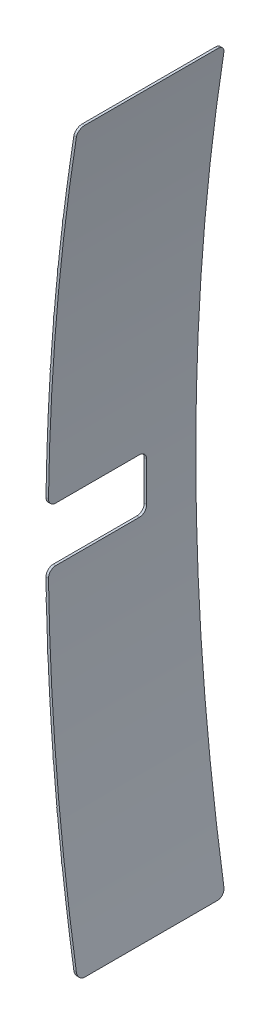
ISO-10303-21;
HEADER;
FILE_DESCRIPTION(('STEP AP214'),'2;1');
FILE_NAME('part.step','',(''),(''),'','','');
FILE_SCHEMA(('AUTOMOTIVE_DESIGN { 1 0 10303 214 1 1 1 1 }'));
ENDSEC;
DATA;
#1=APPLICATION_CONTEXT('core data for automotive mechanical design processes');
#2=APPLICATION_PROTOCOL_DEFINITION('international standard','automotive_design',2000,#1);
#3=PRODUCT_CONTEXT('',#1,'mechanical');
#4=PRODUCT('Part','Part','',(#3));
#5=PRODUCT_RELATED_PRODUCT_CATEGORY('part','',(#4));
#6=PRODUCT_DEFINITION_FORMATION('','',#4);
#7=PRODUCT_DEFINITION_CONTEXT('part definition',#1,'design');
#8=PRODUCT_DEFINITION('design','',#6,#7);
#9=PRODUCT_DEFINITION_SHAPE('','',#8);
#10=(LENGTH_UNIT() NAMED_UNIT(*) SI_UNIT(.MILLI.,.METRE.));
#11=(NAMED_UNIT(*) PLANE_ANGLE_UNIT() SI_UNIT($,.RADIAN.));
#12=(NAMED_UNIT(*) SI_UNIT($,.STERADIAN.) SOLID_ANGLE_UNIT());
#13=UNCERTAINTY_MEASURE_WITH_UNIT(LENGTH_MEASURE(1.E-05),#10,'distance_accuracy_value','');
#14=(GEOMETRIC_REPRESENTATION_CONTEXT(3) GLOBAL_UNCERTAINTY_ASSIGNED_CONTEXT((#13)) GLOBAL_UNIT_ASSIGNED_CONTEXT((#10,
#11,#12)) REPRESENTATION_CONTEXT('',''));
#15=CARTESIAN_POINT('',(0.,0.,0.));
#16=DIRECTION('',(0.,0.,1.));
#17=DIRECTION('',(1.,0.,0.));
#18=AXIS2_PLACEMENT_3D('',#15,#16,#17);
#19=CARTESIAN_POINT('',(0.,0.,6.));
#20=DIRECTION('',(0.,0.,-1.));
#21=DIRECTION('',(-1.,0.,0.));
#22=AXIS2_PLACEMENT_3D('',#19,#20,#21);
#23=CYLINDRICAL_SURFACE('',#22,95.19);
#24=DIRECTION('',(0.,0.,-1.));
#25=VECTOR('',#24,1.);
#26=CARTESIAN_POINT('',(-94.4524574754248,11.8266384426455,3.1));
#27=LINE('',#26,#25);
#28=CARTESIAN_POINT('',(-94.4524574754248,11.8266384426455,3.1));
#29=VERTEX_POINT('',#28);
#30=CARTESIAN_POINT('',(-94.4524574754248,11.8266384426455,2.9));
#31=VERTEX_POINT('',#30);
#32=EDGE_CURVE('E1610',#29,#31,#27,.T.);
#33=ORIENTED_EDGE('',*,*,#32,.T.);
#34=CARTESIAN_POINT('',(0.,0.,2.9));
#35=DIRECTION('',(0.,0.,-1.));
#36=DIRECTION('',(-0.987844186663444,0.155447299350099,0.));
#37=AXIS2_PLACEMENT_3D('',#34,#35,#36);
#38=CIRCLE('',#37,95.19);
#39=CARTESIAN_POINT('',(-94.0328881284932,14.797028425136,2.9));
#40=VERTEX_POINT('',#39);
#41=EDGE_CURVE('E2918',#31,#40,#38,.T.);
#42=ORIENTED_EDGE('',*,*,#41,.T.);
#43=DIRECTION('',(0.,0.,1.));
#44=VECTOR('',#43,1.);
#45=CARTESIAN_POINT('',(-94.0328881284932,14.797028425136,2.9));
#46=LINE('',#45,#44);
#47=CARTESIAN_POINT('',(-94.0328881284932,14.797028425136,3.1));
#48=VERTEX_POINT('',#47);
#49=EDGE_CURVE('E806',#40,#48,#46,.T.);
#50=ORIENTED_EDGE('',*,*,#49,.T.);
#51=CARTESIAN_POINT('',(0.,0.,3.1));
#52=DIRECTION('',(0.,0.,-1.));
#53=DIRECTION('',(-0.987844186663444,0.155447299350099,0.));
#54=AXIS2_PLACEMENT_3D('',#51,#52,#53);
#55=CIRCLE('',#54,95.19);
#56=EDGE_CURVE('E2905',#29,#48,#55,.T.);
#57=ORIENTED_EDGE('',*,*,#56,.F.);
#58=EDGE_LOOP('',(#33,#42,#50,#57));
#59=FACE_BOUND('',#58,.T.);
#60=CARTESIAN_POINT('',(0.,0.,6.));
#61=DIRECTION('',(0.,0.,1.));
#62=DIRECTION('',(1.,0.,0.));
#63=AXIS2_PLACEMENT_3D('',#60,#61,#62);
#64=CIRCLE('',#63,95.19);
#65=CARTESIAN_POINT('',(-95.1601105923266,2.38525723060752,6.));
#66=VERTEX_POINT('',#65);
#67=CARTESIAN_POINT('',(-95.1797042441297,1.4,6.));
#68=VERTEX_POINT('',#67);
#69=EDGE_CURVE('E838',#66,#68,#64,.T.);
#70=ORIENTED_EDGE('',*,*,#69,.F.);
#71=DIRECTION('',(0.,0.,-1.));
#72=VECTOR('',#71,1.);
#73=CARTESIAN_POINT('',(-95.1601105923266,2.38525723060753,6.));
#74=LINE('',#73,#72);
#75=CARTESIAN_POINT('',(-95.1601105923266,2.38525723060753,2.));
#76=VERTEX_POINT('',#75);
#77=EDGE_CURVE('E801',#66,#76,#74,.T.);
#78=ORIENTED_EDGE('',*,*,#77,.T.);
#79=CARTESIAN_POINT('',(0.,0.,2.));
#80=DIRECTION('',(0.,0.,-1.));
#81=DIRECTION('',(-0.999631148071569,0.0271581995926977,0.));
#82=AXIS2_PLACEMENT_3D('',#79,#80,#81);
#83=CIRCLE('',#82,95.19);
#84=CARTESIAN_POINT('',(-95.1548889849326,2.58518901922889,2.));
#85=VERTEX_POINT('',#84);
#86=EDGE_CURVE('E805',#76,#85,#83,.T.);
#87=ORIENTED_EDGE('',*,*,#86,.T.);
#88=DIRECTION('',(0.,0.,1.));
#89=VECTOR('',#88,1.);
#90=CARTESIAN_POINT('',(-95.1548889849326,2.58518901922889,2.));
#91=LINE('',#90,#89);
#92=CARTESIAN_POINT('',(-95.1548889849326,2.58518901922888,6.));
#93=VERTEX_POINT('',#92);
#94=EDGE_CURVE('E810',#85,#93,#91,.T.);
#95=ORIENTED_EDGE('',*,*,#94,.T.);
#96=CARTESIAN_POINT('',(-95.09799639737,4.18415836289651,6.));
#97=VERTEX_POINT('',#96);
#98=EDGE_CURVE('E832',#97,#93,#64,.T.);
#99=ORIENTED_EDGE('',*,*,#98,.F.);
#100=DIRECTION('',(0.,0.,-1.));
#101=VECTOR('',#100,1.);
#102=CARTESIAN_POINT('',(-95.09799639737,4.18415836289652,5.99999999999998));
#103=LINE('',#102,#101);
#104=CARTESIAN_POINT('',(-95.09799639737,4.18415836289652,1.99999999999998));
#105=VERTEX_POINT('',#104);
#106=EDGE_CURVE('E813',#97,#105,#103,.T.);
#107=ORIENTED_EDGE('',*,*,#106,.T.);
#108=CARTESIAN_POINT('',(0.,0.,1.99999999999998));
#109=DIRECTION('',(0.,0.,-1.));
#110=DIRECTION('',(-0.998938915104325,0.0460547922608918,0.));
#111=AXIS2_PLACEMENT_3D('',#108,#109,#110);
#112=CIRCLE('',#111,95.19);
#113=CARTESIAN_POINT('',(-95.0889953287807,4.38395567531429,1.99999999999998));
#114=VERTEX_POINT('',#113);
#115=EDGE_CURVE('E843',#105,#114,#112,.T.);
#116=ORIENTED_EDGE('',*,*,#115,.T.);
#117=DIRECTION('',(0.,0.,1.));
#118=VECTOR('',#117,1.);
#119=CARTESIAN_POINT('',(-95.0889953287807,4.38395567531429,1.99999999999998));
#120=LINE('',#119,#118);
#121=CARTESIAN_POINT('',(-95.0889953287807,4.38395567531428,6.));
#122=VERTEX_POINT('',#121);
#123=EDGE_CURVE('E847',#114,#122,#120,.T.);
#124=ORIENTED_EDGE('',*,*,#123,.T.);
#125=CARTESIAN_POINT('',(-95.0018789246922,5.98156340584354,6.));
#126=VERTEX_POINT('',#125);
#127=EDGE_CURVE('E872',#126,#122,#64,.T.);
#128=ORIENTED_EDGE('',*,*,#127,.F.);
#129=DIRECTION('',(0.,0.,-1.));
#130=VECTOR('',#129,1.);
#131=CARTESIAN_POINT('',(-95.0018789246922,5.98156340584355,5.99999999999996));
#132=LINE('',#131,#130);
#133=CARTESIAN_POINT('',(-95.0018789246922,5.98156340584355,1.99999999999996));
#134=VERTEX_POINT('',#133);
#135=EDGE_CURVE('E851',#126,#134,#132,.T.);
#136=ORIENTED_EDGE('',*,*,#135,.T.);
#137=CARTESIAN_POINT('',(0.,0.,1.99999999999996));
#138=DIRECTION('',(0.,0.,-1.));
#139=DIRECTION('',(-0.997889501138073,0.0649349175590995,0.));
#140=AXIS2_PLACEMENT_3D('',#137,#138,#139);
#141=CIRCLE('',#140,95.19);
#142=CARTESIAN_POINT('',(-94.9891016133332,6.18115480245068,1.99999999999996));
#143=VERTEX_POINT('',#142);
#144=EDGE_CURVE('E1216',#134,#143,#141,.T.);
#145=ORIENTED_EDGE('',*,*,#144,.T.);
#146=DIRECTION('',(0.,0.,1.));
#147=VECTOR('',#146,1.);
#148=CARTESIAN_POINT('',(-94.9891016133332,6.18115480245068,1.99999999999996));
#149=LINE('',#148,#147);
#150=CARTESIAN_POINT('',(-94.9891016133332,6.18115480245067,6.));
#151=VERTEX_POINT('',#150);
#152=EDGE_CURVE('E1177',#143,#151,#149,.T.);
#153=ORIENTED_EDGE('',*,*,#152,.T.);
#154=CARTESIAN_POINT('',(-94.8717925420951,7.77682967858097,6.));
#155=VERTEX_POINT('',#154);
#156=EDGE_CURVE('E1210',#155,#151,#64,.T.);
#157=ORIENTED_EDGE('',*,*,#156,.F.);
#158=DIRECTION('',(0.,0.,-1.));
#159=VECTOR('',#158,1.);
#160=CARTESIAN_POINT('',(-94.8717925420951,7.77682967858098,5.99999999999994));
#161=LINE('',#160,#159);
#162=CARTESIAN_POINT('',(-94.8717925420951,7.77682967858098,1.99999999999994));
#163=VERTEX_POINT('',#162);
#164=EDGE_CURVE('E1172',#155,#163,#161,.T.);
#165=ORIENTED_EDGE('',*,*,#164,.T.);
#166=CARTESIAN_POINT('',(0.,0.,1.99999999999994));
#167=DIRECTION('',(0.,0.,-1.));
#168=DIRECTION('',(-0.996483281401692,0.0837918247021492,0.));
#169=AXIS2_PLACEMENT_3D('',#166,#167,#168);
#170=CIRCLE('',#169,95.19);
#171=CARTESIAN_POINT('',(-94.8552435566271,7.97614379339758,1.99999999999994));
#172=VERTEX_POINT('',#171);
#173=EDGE_CURVE('E1176',#163,#172,#170,.T.);
#174=ORIENTED_EDGE('',*,*,#173,.T.);
#175=DIRECTION('',(0.,0.,1.));
#176=VECTOR('',#175,1.);
#177=CARTESIAN_POINT('',(-94.8552435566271,7.97614379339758,1.99999999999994));
#178=LINE('',#177,#176);
#179=CARTESIAN_POINT('',(-94.8552435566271,7.97614379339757,6.));
#180=VERTEX_POINT('',#179);
#181=EDGE_CURVE('E1136',#172,#180,#178,.T.);
#182=ORIENTED_EDGE('',*,*,#181,.T.);
#183=CARTESIAN_POINT('',(-94.707783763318,9.56931526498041,6.));
#184=VERTEX_POINT('',#183);
#185=EDGE_CURVE('E1169',#184,#180,#64,.T.);
#186=ORIENTED_EDGE('',*,*,#185,.F.);
#187=DIRECTION('',(0.,0.,-1.));
#188=VECTOR('',#187,1.);
#189=CARTESIAN_POINT('',(-94.707783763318,9.56931526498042,5.99999999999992));
#190=LINE('',#189,#188);
#191=CARTESIAN_POINT('',(-94.707783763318,9.56931526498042,1.99999999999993));
#192=VERTEX_POINT('',#191);
#193=EDGE_CURVE('E1131',#184,#192,#190,.T.);
#194=ORIENTED_EDGE('',*,*,#193,.T.);
#195=CARTESIAN_POINT('',(0.,0.,1.99999999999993));
#196=DIRECTION('',(0.,0.,-1.));
#197=DIRECTION('',(-0.994720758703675,0.102618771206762,0.));
#198=AXIS2_PLACEMENT_3D('',#195,#196,#197);
#199=CIRCLE('',#198,95.19);
#200=CARTESIAN_POINT('',(-94.6874690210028,9.76828083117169,1.99999999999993));
#201=VERTEX_POINT('',#200);
#202=EDGE_CURVE('E1135',#192,#201,#199,.T.);
#203=ORIENTED_EDGE('',*,*,#202,.T.);
#204=DIRECTION('',(0.,0.,1.));
#205=VECTOR('',#204,1.);
#206=CARTESIAN_POINT('',(-94.6874690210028,9.76828083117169,1.99999999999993));
#207=LINE('',#206,#205);
#208=CARTESIAN_POINT('',(-94.6874690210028,9.76828083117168,6.));
#209=VERTEX_POINT('',#208);
#210=EDGE_CURVE('E1092',#201,#209,#207,.T.);
#211=ORIENTED_EDGE('',*,*,#210,.T.);
#212=CARTESIAN_POINT('',(-94.5099112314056,11.3583792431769,6.));
#213=VERTEX_POINT('',#212);
#214=EDGE_CURVE('E1128',#213,#209,#64,.T.);
#215=ORIENTED_EDGE('',*,*,#214,.F.);
#216=DIRECTION('',(0.,0.,-1.));
#217=VECTOR('',#216,1.);
#218=CARTESIAN_POINT('',(-94.5099112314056,11.3583792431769,5.99999999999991));
#219=LINE('',#218,#217);
#220=CARTESIAN_POINT('',(-94.5099112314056,11.3583792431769,1.99999999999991));
#221=VERTEX_POINT('',#220);
#222=EDGE_CURVE('E1087',#213,#221,#219,.T.);
#223=ORIENTED_EDGE('',*,*,#222,.T.);
#224=CARTESIAN_POINT('',(0.,0.,1.99999999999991));
#225=DIRECTION('',(0.,0.,-1.));
#226=DIRECTION('',(-0.992602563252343,0.121409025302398,0.));
#227=AXIS2_PLACEMENT_3D('',#224,#225,#226);
#228=CIRCLE('',#227,95.19);
#229=CARTESIAN_POINT('',(-94.4858379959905,11.5569251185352,1.99999999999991));
#230=VERTEX_POINT('',#229);
#231=EDGE_CURVE('E1091',#221,#230,#228,.T.);
#232=ORIENTED_EDGE('',*,*,#231,.T.);
#233=DIRECTION('',(0.,0.,1.));
#234=VECTOR('',#233,1.);
#235=CARTESIAN_POINT('',(-94.4858379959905,11.5569251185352,1.99999999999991));
#236=LINE('',#235,#234);
#237=CARTESIAN_POINT('',(-94.4858379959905,11.5569251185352,6.));
#238=VERTEX_POINT('',#237);
#239=EDGE_CURVE('E1096',#230,#238,#236,.T.);
#240=ORIENTED_EDGE('',*,*,#239,.T.);
#241=CARTESIAN_POINT('',(-94.0481052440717,14.7,6.));
#242=VERTEX_POINT('',#241);
#243=EDGE_CURVE('E1121',#242,#238,#64,.T.);
#244=ORIENTED_EDGE('',*,*,#243,.F.);
#245=CARTESIAN_POINT('',(-94.0481052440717,14.7,6.));
#246=CARTESIAN_POINT('',(-94.0454431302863,14.7170329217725,6.0000135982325));
#247=CARTESIAN_POINT('',(-94.0427765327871,14.7340618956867,5.99855017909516));
#248=CARTESIAN_POINT('',(-94.037510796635,14.7676315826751,5.99276905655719));
#249=CARTESIAN_POINT('',(-94.0349116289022,14.7841725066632,5.98845260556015));
#250=CARTESIAN_POINT('',(-94.0298532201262,14.8163109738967,5.97706165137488));
#251=CARTESIAN_POINT('',(-94.0273940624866,14.8319079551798,5.96998552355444));
#252=CARTESIAN_POINT('',(-94.0226907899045,14.8616938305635,5.95327157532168));
#253=CARTESIAN_POINT('',(-94.0204466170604,14.8758831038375,5.94363444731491));
#254=CARTESIAN_POINT('',(-94.0162523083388,14.9023683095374,5.92211857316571));
#255=CARTESIAN_POINT('',(-94.0143006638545,14.9146739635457,5.91025209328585));
#256=CARTESIAN_POINT('',(-94.0107375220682,14.937116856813,5.88457072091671));
#257=CARTESIAN_POINT('',(-94.009126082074,14.9472537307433,5.87075550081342));
#258=CARTESIAN_POINT('',(-94.0063118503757,14.9649427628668,5.84174215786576));
#259=CARTESIAN_POINT('',(-94.0051045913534,14.9725231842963,5.82656167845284));
#260=CARTESIAN_POINT('',(-94.003113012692,14.9850219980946,5.7951213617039));
#261=CARTESIAN_POINT('',(-94.0023283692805,14.9899424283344,5.77886236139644));
#262=CARTESIAN_POINT('',(-94.0014208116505,14.9956323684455,5.75207068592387));
#263=CARTESIAN_POINT('',(-94.0011596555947,14.9972692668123,5.74171882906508));
#264=CARTESIAN_POINT('',(-94.0008112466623,14.9994528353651,5.72091289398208));
#265=CARTESIAN_POINT('',(-94.0007237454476,15.0000010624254,5.71045898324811));
#266=CARTESIAN_POINT('',(-94.0007239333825,15.0000000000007,5.70000000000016));
#267=B_SPLINE_CURVE_WITH_KNOTS('',3,(#245,#246,#247,#248,#249,#250,#251,#252,#253,#254,#255,
#256,#257,#258,#259,#260,#261,#262,#263,#264,#265,#266),.UNSPECIFIED.,.F.,.F.,(4,2,2,2,2,2,2,2,
2,2,4),(0.,0.0516527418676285,0.10328282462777,0.154943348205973,0.206589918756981,
0.257960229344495,0.309339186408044,0.360129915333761,0.410881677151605,0.44227893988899,
0.473631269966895),.UNSPECIFIED.);
#268=CARTESIAN_POINT('',(-94.0007239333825,15.,5.7));
#269=VERTEX_POINT('',#268);
#270=EDGE_CURVE('E1100',#242,#269,#267,.T.);
#271=ORIENTED_EDGE('',*,*,#270,.T.);
#272=DIRECTION('',(0.,0.,-1.));
#273=VECTOR('',#272,1.);
#274=CARTESIAN_POINT('',(-94.0007239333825,15.,6.));
#275=LINE('',#274,#273);
#276=CARTESIAN_POINT('',(-94.0007239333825,15.,0.3));
#277=VERTEX_POINT('',#276);
#278=EDGE_CURVE('E1369',#269,#277,#275,.T.);
#279=ORIENTED_EDGE('',*,*,#278,.T.);
#280=CARTESIAN_POINT('',(-94.0007239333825,15.,0.3));
#281=CARTESIAN_POINT('',(-94.0007214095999,15.0000150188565,0.283274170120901));
#282=CARTESIAN_POINT('',(-94.0009469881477,14.9986021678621,0.266553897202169));
#283=CARTESIAN_POINT('',(-94.0018354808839,14.9930330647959,0.233607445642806));
#284=CARTESIAN_POINT('',(-94.002497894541,14.9888799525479,0.21738072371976));
#285=CARTESIAN_POINT('',(-94.0042415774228,14.9779402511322,0.185858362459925));
#286=CARTESIAN_POINT('',(-94.0053229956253,14.9711527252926,0.170563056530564));
#287=CARTESIAN_POINT('',(-94.0078696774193,14.9551531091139,0.141335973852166));
#288=CARTESIAN_POINT('',(-94.009334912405,14.9459411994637,0.127404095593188));
#289=CARTESIAN_POINT('',(-94.0126135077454,14.9253043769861,0.101209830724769));
#290=CARTESIAN_POINT('',(-94.014428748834,14.91386750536,0.0889571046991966));
#291=CARTESIAN_POINT('',(-94.0183476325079,14.889142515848,0.0665398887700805));
#292=CARTESIAN_POINT('',(-94.0204513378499,14.8758539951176,0.0563758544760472));
#293=CARTESIAN_POINT('',(-94.0249116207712,14.8476362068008,0.0382983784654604));
#294=CARTESIAN_POINT('',(-94.0272709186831,14.8326892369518,0.0304132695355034));
#295=CARTESIAN_POINT('',(-94.0321525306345,14.8017105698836,0.0172673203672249));
#296=CARTESIAN_POINT('',(-94.0346747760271,14.7856793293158,0.0120053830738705));
#297=CARTESIAN_POINT('',(-94.0390257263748,14.7579765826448,0.00542357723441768));
#298=CARTESIAN_POINT('',(-94.0408315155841,14.7464654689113,0.00339103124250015));
#299=CARTESIAN_POINT('',(-94.0444604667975,14.7233044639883,0.000679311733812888));
#300=CARTESIAN_POINT('',(-94.0462836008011,14.7116547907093,-1.76087253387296E-06));
#301=CARTESIAN_POINT('',(-94.0481052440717,14.7,0.));
#302=B_SPLINE_CURVE_WITH_KNOTS('',3,(#280,#281,#282,#283,#284,#285,#286,#287,#288,#289,#290,
#291,#292,#293,#294,#295,#296,#297,#298,#299,#300,#301),.UNSPECIFIED.,.F.,.F.,(4,2,2,2,2,2,2,2,
2,2,4),(0.,0.0501082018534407,0.100159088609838,0.150227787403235,0.200292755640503,
0.250634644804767,0.300987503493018,0.351941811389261,0.402874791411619,0.438284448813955,
0.473644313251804),.UNSPECIFIED.);
#303=CARTESIAN_POINT('',(-94.0481052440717,14.7,0.));
#304=VERTEX_POINT('',#303);
#305=EDGE_CURVE('E1372',#277,#304,#302,.T.);
#306=ORIENTED_EDGE('',*,*,#305,.T.);
#307=CARTESIAN_POINT('',(0.,0.,0.));
#308=DIRECTION('',(0.,0.,1.));
#309=DIRECTION('',(1.,0.,0.));
#310=AXIS2_PLACEMENT_3D('',#307,#308,#309);
#311=CIRCLE('',#310,95.19);
#312=CARTESIAN_POINT('',(-95.1381247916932,3.14218254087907,0.));
#313=VERTEX_POINT('',#312);
#314=EDGE_CURVE('E1354',#304,#313,#311,.T.);
#315=ORIENTED_EDGE('',*,*,#314,.T.);
#316=CARTESIAN_POINT('',(-95.1898929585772,0.142753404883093,2.));
#317=CARTESIAN_POINT('',(-95.1883932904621,1.14275230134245,1.33333331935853));
#318=CARTESIAN_POINT('',(-95.1711343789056,2.14272748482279,0.666666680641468));
#319=CARTESIAN_POINT('',(-95.1381247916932,3.14218254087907,0.));
#320=B_SPLINE_CURVE_WITH_KNOTS('',3,(#316,#317,#318,#319),.UNSPECIFIED.,.F.,.F.,(4,4),(0.,1.),.UNSPECIFIED.);
#321=CARTESIAN_POINT('',(-95.1898933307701,0.14250500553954,2.));
#322=VERTEX_POINT('',#321);
#323=EDGE_CURVE('E2862',#313,#322,#320,.F.);
#324=ORIENTED_EDGE('',*,*,#323,.T.);
#325=CARTESIAN_POINT('',(0.,0.,2.));
#326=DIRECTION('',(0.,0.,-1.));
#327=DIRECTION('',(-1.,0.,0.));
#328=AXIS2_PLACEMENT_3D('',#325,#326,#327);
#329=CIRCLE('',#328,95.19);
#330=CARTESIAN_POINT('',(-95.1866382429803,0.8,2.));
#331=VERTEX_POINT('',#330);
#332=EDGE_CURVE('E1356',#322,#331,#329,.T.);
#333=ORIENTED_EDGE('',*,*,#332,.T.);
#334=CARTESIAN_POINT('',(-95.1866382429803,0.8,2.));
#335=CARTESIAN_POINT('',(-95.1864965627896,0.816878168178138,1.99998566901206));
#336=CARTESIAN_POINT('',(-95.186350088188,0.833752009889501,2.00142350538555));
#337=CARTESIAN_POINT('',(-95.1860528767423,0.867009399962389,2.00709771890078));
#338=CARTESIAN_POINT('',(-95.185902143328,0.883393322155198,2.0113319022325));
#339=CARTESIAN_POINT('',(-95.1856014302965,0.915224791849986,2.02249599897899));
#340=CARTESIAN_POINT('',(-95.1854514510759,0.930671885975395,2.02942720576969));
#341=CARTESIAN_POINT('',(-95.1851583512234,0.960180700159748,2.04578257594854));
#342=CARTESIAN_POINT('',(-95.1850152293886,0.974242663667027,2.05520630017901));
#343=CARTESIAN_POINT('',(-95.184741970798,1.00058480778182,2.07628076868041));
#344=CARTESIAN_POINT('',(-95.1846118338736,1.01286501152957,2.0879314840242));
#345=CARTESIAN_POINT('',(-95.1843704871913,1.03529758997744,2.11313207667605));
#346=CARTESIAN_POINT('',(-95.184259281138,1.04544954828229,2.12668232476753));
#347=CARTESIAN_POINT('',(-95.1840611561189,1.06333538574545,2.1552958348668));
#348=CARTESIAN_POINT('',(-95.1839742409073,1.07106889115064,2.17035933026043));
#349=CARTESIAN_POINT('',(-95.1838290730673,1.08389315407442,2.20156803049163));
#350=CARTESIAN_POINT('',(-95.1837708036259,1.08898546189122,2.21771259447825));
#351=CARTESIAN_POINT('',(-95.1837004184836,1.09511667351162,2.24496336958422));
#352=CARTESIAN_POINT('',(-95.1836793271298,1.09694681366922,2.25589808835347));
#353=CARTESIAN_POINT('',(-95.1836511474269,1.09938831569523,2.27788700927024));
#354=CARTESIAN_POINT('',(-95.1836440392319,1.10000140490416,2.28894101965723));
#355=CARTESIAN_POINT('',(-95.1836440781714,1.10000000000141,2.29999999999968));
#356=B_SPLINE_CURVE_WITH_KNOTS('',3,(#334,#335,#336,#337,#338,#339,#340,#341,#342,#343,#344,
#345,#346,#347,#348,#349,#350,#351,#352,#353,#354,#355),.UNSPECIFIED.,.F.,.F.,(4,2,2,2,2,2,2,2,
2,2,4),(0.,0.0505690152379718,0.101098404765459,0.151652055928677,0.202196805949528,
0.252740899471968,0.303294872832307,0.353856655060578,0.404388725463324,0.437586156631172,
0.470736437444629),.UNSPECIFIED.);
#357=CARTESIAN_POINT('',(-95.1836440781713,1.1,2.3));
#358=VERTEX_POINT('',#357);
#359=EDGE_CURVE('E1462',#331,#358,#356,.T.);
#360=ORIENTED_EDGE('',*,*,#359,.T.);
#361=DIRECTION('',(0.,0.,-1.));
#362=VECTOR('',#361,1.);
#363=CARTESIAN_POINT('',(-95.1836440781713,1.1,6.));
#364=LINE('',#363,#362);
#365=CARTESIAN_POINT('',(-95.1836440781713,1.1,5.7));
#366=VERTEX_POINT('',#365);
#367=EDGE_CURVE('E1469',#358,#366,#364,.F.);
#368=ORIENTED_EDGE('',*,*,#367,.T.);
#369=CARTESIAN_POINT('',(-95.1836440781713,1.1,5.7));
#370=CARTESIAN_POINT('',(-95.1836441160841,1.09998566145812,5.71687660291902));
#371=CARTESIAN_POINT('',(-95.1836276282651,1.10142324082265,5.73374891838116));
#372=CARTESIAN_POINT('',(-95.1835618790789,1.10709642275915,5.76700332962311));
#373=CARTESIAN_POINT('',(-95.1835126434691,1.11132982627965,5.78338580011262));
#374=CARTESIAN_POINT('',(-95.183381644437,1.12249182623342,5.81521450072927));
#375=CARTESIAN_POINT('',(-95.1832998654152,1.12942171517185,5.83066027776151));
#376=CARTESIAN_POINT('',(-95.1831044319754,1.14577385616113,5.86016666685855));
#377=CARTESIAN_POINT('',(-95.1829907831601,1.15519567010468,5.8742275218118));
#378=CARTESIAN_POINT('',(-95.1827327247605,1.1762659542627,5.90056814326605));
#379=CARTESIAN_POINT('',(-95.1825883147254,1.18791445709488,5.91284788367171));
#380=CARTESIAN_POINT('',(-95.1822705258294,1.21311003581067,5.93527993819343));
#381=CARTESIAN_POINT('',(-95.1820971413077,1.2266574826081,5.94543183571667));
#382=CARTESIAN_POINT('',(-95.1817241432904,1.25526635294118,5.96331913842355));
#383=CARTESIAN_POINT('',(-95.1815245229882,1.27032816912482,5.97105391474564));
#384=CARTESIAN_POINT('',(-95.1811029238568,1.30153332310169,5.98388105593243));
#385=CARTESIAN_POINT('',(-95.1808809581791,1.31767602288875,5.9889749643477));
#386=CARTESIAN_POINT('',(-95.1804989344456,1.34493112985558,5.99511090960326));
#387=CARTESIAN_POINT('',(-95.180343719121,1.3558722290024,5.99694321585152));
#388=CARTESIAN_POINT('',(-95.1800277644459,1.37787403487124,5.99938760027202));
#389=CARTESIAN_POINT('',(-95.1798670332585,1.38893454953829,6.00000140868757));
#390=CARTESIAN_POINT('',(-95.1797042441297,1.39999999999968,6.00000000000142));
#391=B_SPLINE_CURVE_WITH_KNOTS('',3,(#369,#370,#371,#372,#373,#374,#375,#376,#377,#378,#379,
#380,#381,#382,#383,#384,#385,#386,#387,#388,#389,#390),.UNSPECIFIED.,.F.,.F.,(4,2,2,2,2,2,2,2,
2,2,4),(0.,0.0505625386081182,0.101085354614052,0.151632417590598,0.202170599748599,
0.252709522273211,0.303258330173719,0.353820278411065,0.404352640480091,0.437573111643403,
0.470746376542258),.UNSPECIFIED.);
#392=EDGE_CURVE('E1447',#366,#68,#391,.T.);
#393=ORIENTED_EDGE('',*,*,#392,.T.);
#394=EDGE_LOOP('',(#70,#78,#87,#95,#99,#107,#116,#124,#128,#136,#145,#153,#157,#165,#174,#182,
#186,#194,#203,#211,#215,#223,#232,#240,#244,#271,#279,#306,#315,#324,#333,#360,#368,#393));
#395=FACE_BOUND('',#394,.T.);
#396=ADVANCED_FACE('F693',(#59,#395),#23,.T.);
#397=CARTESIAN_POINT('',(0.,0.,6.));
#398=DIRECTION('',(0.,0.,1.));
#399=DIRECTION('',(1.,0.,0.));
#400=AXIS2_PLACEMENT_3D('',#397,#398,#399);
#401=PLANE('',#400);
#402=ORIENTED_EDGE('',*,*,#243,.T.);
#403=DIRECTION('',(0.992602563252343,-0.121409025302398,0.));
#404=VECTOR('',#403,1.);
#405=CARTESIAN_POINT('',(-94.4858379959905,11.5569251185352,6.));
#406=LINE('',#405,#404);
#407=CARTESIAN_POINT('',(-94.495764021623,11.5581392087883,6.));
#408=VERTEX_POINT('',#407);
#409=EDGE_CURVE('E866',#408,#238,#406,.T.);
#410=ORIENTED_EDGE('',*,*,#409,.F.);
#411=CARTESIAN_POINT('',(0.,0.,6.));
#412=DIRECTION('',(0.,0.,-1.));
#413=DIRECTION('',(-1.,0.,0.));
#414=AXIS2_PLACEMENT_3D('',#411,#412,#413);
#415=CIRCLE('',#414,95.2);
#416=CARTESIAN_POINT('',(-94.519839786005,11.3595724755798,6.));
#417=VERTEX_POINT('',#416);
#418=EDGE_CURVE('E1116',#408,#417,#415,.F.);
#419=ORIENTED_EDGE('',*,*,#418,.T.);
#420=DIRECTION('',(0.992855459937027,-0.119323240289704,0.));
#421=VECTOR('',#420,1.);
#422=CARTESIAN_POINT('',(-94.5099112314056,11.3583792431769,6.));
#423=LINE('',#422,#421);
#424=EDGE_CURVE('E1120',#417,#213,#423,.T.);
#425=ORIENTED_EDGE('',*,*,#424,.T.);
#426=ORIENTED_EDGE('',*,*,#214,.T.);
#427=DIRECTION('',(0.994720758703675,-0.102618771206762,0.));
#428=VECTOR('',#427,1.);
#429=CARTESIAN_POINT('',(-94.6874690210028,9.76828083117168,6.));
#430=LINE('',#429,#428);
#431=CARTESIAN_POINT('',(-94.6974162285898,9.76930701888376,6.));
#432=VERTEX_POINT('',#431);
#433=EDGE_CURVE('E1115',#432,#209,#430,.T.);
#434=ORIENTED_EDGE('',*,*,#433,.F.);
#435=CARTESIAN_POINT('',(0.,0.,6.));
#436=DIRECTION('',(0.,0.,-1.));
#437=DIRECTION('',(-1.,0.,0.));
#438=AXIS2_PLACEMENT_3D('',#435,#436,#437);
#439=CIRCLE('',#438,95.2);
#440=CARTESIAN_POINT('',(-94.7177331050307,9.57032055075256,6.));
#441=VERTEX_POINT('',#440);
#442=EDGE_CURVE('E1158',#432,#441,#439,.F.);
#443=ORIENTED_EDGE('',*,*,#442,.T.);
#444=DIRECTION('',(0.994934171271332,-0.100528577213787,0.));
#445=VECTOR('',#444,1.);
#446=CARTESIAN_POINT('',(-94.707783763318,9.56931526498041,6.));
#447=LINE('',#446,#445);
#448=EDGE_CURVE('E1162',#441,#184,#447,.T.);
#449=ORIENTED_EDGE('',*,*,#448,.T.);
#450=ORIENTED_EDGE('',*,*,#185,.T.);
#451=DIRECTION('',(0.996483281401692,-0.0837918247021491,0.));
#452=VECTOR('',#451,1.);
#453=CARTESIAN_POINT('',(-94.8552435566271,7.97614379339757,6.));
#454=LINE('',#453,#452);
#455=CARTESIAN_POINT('',(-94.8652083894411,7.9769817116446,6.));
#456=VERTEX_POINT('',#455);
#457=EDGE_CURVE('E1157',#456,#180,#454,.T.);
#458=ORIENTED_EDGE('',*,*,#457,.F.);
#459=CARTESIAN_POINT('',(0.,0.,6.));
#460=DIRECTION('',(0.,0.,-1.));
#461=DIRECTION('',(-1.,0.,0.));
#462=AXIS2_PLACEMENT_3D('',#459,#460,#461);
#463=CIRCLE('',#462,95.2);
#464=CARTESIAN_POINT('',(-94.8817591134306,7.77764665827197,6.));
#465=VERTEX_POINT('',#464);
#466=EDGE_CURVE('E1199',#456,#465,#463,.F.);
#467=ORIENTED_EDGE('',*,*,#466,.T.);
#468=DIRECTION('',(0.996657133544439,-0.0816979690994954,0.));
#469=VECTOR('',#468,1.);
#470=CARTESIAN_POINT('',(-94.8717925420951,7.77682967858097,6.));
#471=LINE('',#470,#469);
#472=EDGE_CURVE('E1203',#465,#155,#471,.T.);
#473=ORIENTED_EDGE('',*,*,#472,.T.);
#474=ORIENTED_EDGE('',*,*,#156,.T.);
#475=DIRECTION('',(0.997889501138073,-0.0649349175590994,0.));
#476=VECTOR('',#475,1.);
#477=CARTESIAN_POINT('',(-94.9891016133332,6.18115480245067,6.));
#478=LINE('',#477,#476);
#479=CARTESIAN_POINT('',(-94.9990805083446,6.18180415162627,6.));
#480=VERTEX_POINT('',#479);
#481=EDGE_CURVE('E1198',#480,#151,#478,.T.);
#482=ORIENTED_EDGE('',*,*,#481,.F.);
#483=CARTESIAN_POINT('',(0.,0.,6.));
#484=DIRECTION('',(0.,0.,-1.));
#485=DIRECTION('',(-1.,0.,0.));
#486=AXIS2_PLACEMENT_3D('',#483,#484,#485);
#487=CIRCLE('',#486,95.2);
#488=CARTESIAN_POINT('',(-95.0118591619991,5.98219178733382,6.));
#489=VERTEX_POINT('',#488);
#490=EDGE_CURVE('E1236',#480,#489,#487,.F.);
#491=ORIENTED_EDGE('',*,*,#490,.T.);
#492=DIRECTION('',(0.998023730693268,-0.0628381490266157,0.));
#493=VECTOR('',#492,1.);
#494=CARTESIAN_POINT('',(-95.0018789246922,5.98156340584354,6.));
#495=LINE('',#494,#493);
#496=EDGE_CURVE('E1240',#489,#126,#495,.T.);
#497=ORIENTED_EDGE('',*,*,#496,.T.);
#498=ORIENTED_EDGE('',*,*,#127,.T.);
#499=DIRECTION('',(0.998938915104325,-0.0460547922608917,0.));
#500=VECTOR('',#499,1.);
#501=CARTESIAN_POINT('',(-95.0889953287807,4.38395567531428,6.));
#502=LINE('',#501,#500);
#503=CARTESIAN_POINT('',(-95.0989847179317,4.3844162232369,6.));
#504=VERTEX_POINT('',#503);
#505=EDGE_CURVE('E826',#504,#122,#502,.T.);
#506=ORIENTED_EDGE('',*,*,#505,.F.);
#507=CARTESIAN_POINT('',(0.,0.,6.));
#508=DIRECTION('',(0.,0.,-1.));
#509=DIRECTION('',(-1.,0.,0.));
#510=AXIS2_PLACEMENT_3D('',#507,#508,#509);
#511=CIRCLE('',#510,95.2);
#512=CARTESIAN_POINT('',(-95.1079867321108,4.18459792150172,6.));
#513=VERTEX_POINT('',#512);
#514=EDGE_CURVE('E867',#504,#513,#511,.F.);
#515=ORIENTED_EDGE('',*,*,#514,.T.);
#516=DIRECTION('',(0.999033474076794,-0.043955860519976,0.));
#517=VECTOR('',#516,1.);
#518=CARTESIAN_POINT('',(-95.09799639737,4.18415836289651,6.));
#519=LINE('',#518,#517);
#520=EDGE_CURVE('E871',#513,#97,#519,.T.);
#521=ORIENTED_EDGE('',*,*,#520,.T.);
#522=ORIENTED_EDGE('',*,*,#98,.T.);
#523=DIRECTION('',(0.999631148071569,-0.0271581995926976,0.));
#524=VECTOR('',#523,1.);
#525=CARTESIAN_POINT('',(-95.1548889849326,2.58518901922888,6.));
#526=LINE('',#525,#524);
#527=CARTESIAN_POINT('',(-95.1648852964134,2.58546060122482,6.));
#528=VERTEX_POINT('',#527);
#529=EDGE_CURVE('E13',#528,#93,#526,.T.);
#530=ORIENTED_EDGE('',*,*,#529,.F.);
#531=CARTESIAN_POINT('',(0.,0.,6.));
#532=DIRECTION('',(0.,0.,-1.));
#533=DIRECTION('',(-1.,0.,0.));
#534=AXIS2_PLACEMENT_3D('',#531,#532,#533);
#535=CIRCLE('',#534,95.2);
#536=CARTESIAN_POINT('',(-95.1701074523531,2.38550780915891,6.));
#537=VERTEX_POINT('',#536);
#538=EDGE_CURVE('E827',#528,#537,#535,.F.);
#539=ORIENTED_EDGE('',*,*,#538,.T.);
#540=DIRECTION('',(0.999686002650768,-0.0250578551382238,0.));
#541=VECTOR('',#540,1.);
#542=CARTESIAN_POINT('',(-95.1601105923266,2.38525723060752,6.));
#543=LINE('',#542,#541);
#544=EDGE_CURVE('E831',#537,#66,#543,.T.);
#545=ORIENTED_EDGE('',*,*,#544,.T.);
#546=ORIENTED_EDGE('',*,*,#69,.T.);
#547=DIRECTION('',(-1.,0.,0.));
#548=VECTOR('',#547,1.);
#549=CARTESIAN_POINT('',(-95.0836373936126,1.4,6.));
#550=LINE('',#549,#548);
#551=CARTESIAN_POINT('',(-95.0796934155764,1.4,6.));
#552=VERTEX_POINT('',#551);
#553=EDGE_CURVE('E1581',#68,#552,#550,.F.);
#554=ORIENTED_EDGE('',*,*,#553,.T.);
#555=CARTESIAN_POINT('',(0.,0.,6.));
#556=DIRECTION('',(0.,0.,-1.));
#557=DIRECTION('',(1.,0.,0.));
#558=AXIS2_PLACEMENT_3D('',#555,#556,#557);
#559=CIRCLE('',#558,95.09);
#560=CARTESIAN_POINT('',(-93.9468897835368,14.7,6.));
#561=VERTEX_POINT('',#560);
#562=EDGE_CURVE('E1623',#552,#561,#559,.T.);
#563=ORIENTED_EDGE('',*,*,#562,.T.);
#564=DIRECTION('',(-1.,0.,0.));
#565=VECTOR('',#564,1.);
#566=CARTESIAN_POINT('',(-94.0007239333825,14.7,6.));
#567=LINE('',#566,#565);
#568=EDGE_CURVE('E1532',#561,#242,#567,.T.);
#569=ORIENTED_EDGE('',*,*,#568,.T.);
#570=EDGE_LOOP('',(#402,#410,#419,#425,#426,#434,#443,#449,#450,#458,#467,#473,#474,#482,#491,
#497,#498,#506,#515,#521,#522,#530,#539,#545,#546,#554,#563,#569));
#571=FACE_BOUND('',#570,.T.);
#572=ADVANCED_FACE('F1596',(#571),#401,.T.);
#573=CARTESIAN_POINT('',(0.,0.,6.));
#574=DIRECTION('',(0.,0.,-1.));
#575=DIRECTION('',(-1.,0.,0.));
#576=AXIS2_PLACEMENT_3D('',#573,#574,#575);
#577=CYLINDRICAL_SURFACE('',#576,95.09);
#578=ORIENTED_EDGE('',*,*,#562,.F.);
#579=CARTESIAN_POINT('',(-95.0796934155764,1.4,6.));
#580=CARTESIAN_POINT('',(-95.0799421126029,1.38312174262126,6.00001433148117));
#581=CARTESIAN_POINT('',(-95.0801859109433,1.36624767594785,5.99857647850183));
#582=CARTESIAN_POINT('',(-95.0806578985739,1.33298956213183,5.99290206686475));
#583=CARTESIAN_POINT('',(-95.0808860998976,1.31660514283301,5.98866769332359));
#584=CARTESIAN_POINT('',(-95.0813215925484,1.2847724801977,5.97750290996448));
#585=CARTESIAN_POINT('',(-95.0815288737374,1.26932469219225,5.97057120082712));
#586=CARTESIAN_POINT('',(-95.0819182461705,1.23981449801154,5.95421445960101));
#587=CARTESIAN_POINT('',(-95.0821003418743,1.22575184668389,5.94478986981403));
#588=CARTESIAN_POINT('',(-95.0824362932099,1.19940925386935,5.92371391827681));
#589=CARTESIAN_POINT('',(-95.0825901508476,1.18712918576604,5.9120627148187));
#590=CARTESIAN_POINT('',(-95.0828675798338,1.16469693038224,5.88686104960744));
#591=CARTESIAN_POINT('',(-95.0829911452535,1.15454515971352,5.87331021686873));
#592=CARTESIAN_POINT('',(-95.0832066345,1.13666019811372,5.84469609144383));
#593=CARTESIAN_POINT('',(-95.0832985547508,1.12892728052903,5.82963262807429));
#594=CARTESIAN_POINT('',(-95.0834499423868,1.11610412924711,5.79842408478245));
#595=CARTESIAN_POINT('',(-95.0835094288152,1.11101234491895,5.782279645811));
#596=CARTESIAN_POINT('',(-95.0835808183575,1.10488218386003,5.75503024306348));
#597=CARTESIAN_POINT('',(-95.0836020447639,1.10305247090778,5.7440967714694));
#598=CARTESIAN_POINT('',(-95.0836303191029,1.10061154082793,5.72211039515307));
#599=CARTESIAN_POINT('',(-95.0836373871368,1.09999859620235,5.71105768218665));
#600=CARTESIAN_POINT('',(-95.0836373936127,1.09999999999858,5.70000000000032));
#601=B_SPLINE_CURVE_WITH_KNOTS('',3,(#579,#580,#581,#582,#583,#584,#585,#586,#587,#588,#589,
#590,#591,#592,#593,#594,#595,#596,#597,#598,#599,#600),.UNSPECIFIED.,.F.,.F.,(4,2,2,2,2,2,2,2,
2,2,4),(0.,0.0505730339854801,0.101106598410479,0.151664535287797,0.202213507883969,
0.252758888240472,0.303314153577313,0.353875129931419,0.404406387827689,0.437599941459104,
0.470746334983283),.UNSPECIFIED.);
#602=CARTESIAN_POINT('',(-95.0836373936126,1.1,5.7));
#603=VERTEX_POINT('',#602);
#604=EDGE_CURVE('E1524',#552,#603,#601,.T.);
#605=ORIENTED_EDGE('',*,*,#604,.T.);
#606=DIRECTION('',(0.,0.,-1.));
#607=VECTOR('',#606,1.);
#608=CARTESIAN_POINT('',(-95.0836373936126,1.1,6.));
#609=LINE('',#608,#607);
#610=CARTESIAN_POINT('',(-95.0836373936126,1.1,2.3));
#611=VERTEX_POINT('',#610);
#612=EDGE_CURVE('E1531',#603,#611,#609,.T.);
#613=ORIENTED_EDGE('',*,*,#612,.T.);
#614=CARTESIAN_POINT('',(-95.0836373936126,1.1,2.3));
#615=CARTESIAN_POINT('',(-95.0836370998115,1.1000143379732,2.28312326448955));
#616=CARTESIAN_POINT('',(-95.0836538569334,1.09857673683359,2.26625081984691));
#617=CARTESIAN_POINT('',(-95.0837193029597,1.09290346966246,2.23299616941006));
#618=CARTESIAN_POINT('',(-95.0837679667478,1.08867000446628,2.21661358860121));
#619=CARTESIAN_POINT('',(-95.0838950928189,1.07750784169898,2.18478468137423));
#620=CARTESIAN_POINT('',(-95.0839735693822,1.07057785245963,2.16933880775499));
#621=CARTESIAN_POINT('',(-95.0841562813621,1.05422545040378,2.13983221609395));
#622=CARTESIAN_POINT('',(-95.0842605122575,1.04480347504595,2.12577125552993));
#623=CARTESIAN_POINT('',(-95.0844897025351,1.02373266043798,2.09943027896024));
#624=CARTESIAN_POINT('',(-95.0846146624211,1.01208376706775,2.08715030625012));
#625=CARTESIAN_POINT('',(-95.0848795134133,0.986887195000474,2.06471782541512));
#626=CARTESIAN_POINT('',(-95.0850194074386,0.973339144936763,2.0545657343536));
#627=CARTESIAN_POINT('',(-95.0853079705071,0.94472888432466,2.03667820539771));
#628=CARTESIAN_POINT('',(-95.0854566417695,0.929666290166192,2.02894338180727));
#629=CARTESIAN_POINT('',(-95.0857566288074,0.898459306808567,2.01611633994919));
#630=CARTESIAN_POINT('',(-95.085907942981,0.882315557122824,2.01102257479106));
#631=CARTESIAN_POINT('',(-95.0861561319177,0.855060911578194,2.00488767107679));
#632=CARTESIAN_POINT('',(-95.0862538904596,0.844121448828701,2.00305590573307));
#633=CARTESIAN_POINT('',(-95.0864466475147,0.822122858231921,2.00061223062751));
#634=CARTESIAN_POINT('',(-95.0865416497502,0.811063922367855,1.9999985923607));
#635=CARTESIAN_POINT('',(-95.0866347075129,0.80000000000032,1.99999999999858));
#636=B_SPLINE_CURVE_WITH_KNOTS('',3,(#614,#615,#616,#617,#618,#619,#620,#621,#622,#623,#624,
#625,#626,#627,#628,#629,#630,#631,#632,#633,#634,#635),.UNSPECIFIED.,.F.,.F.,(4,2,2,2,2,2,2,2,
2,2,4),(0.,0.0505629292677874,0.101086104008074,0.151633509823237,0.202172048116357,
0.252711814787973,0.303261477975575,0.353823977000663,0.404356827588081,0.437570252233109,
0.470736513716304),.UNSPECIFIED.);
#637=CARTESIAN_POINT('',(-95.0866347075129,0.8,2.));
#638=VERTEX_POINT('',#637);
#639=EDGE_CURVE('E1470',#611,#638,#636,.T.);
#640=ORIENTED_EDGE('',*,*,#639,.T.);
#641=CARTESIAN_POINT('',(0.,0.,2.));
#642=DIRECTION('',(0.,0.,-1.));
#643=DIRECTION('',(-1.,0.,0.));
#644=AXIS2_PLACEMENT_3D('',#641,#642,#643);
#645=CIRCLE('',#644,95.09);
#646=CARTESIAN_POINT('',(-95.0866347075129,-0.8,2.));
#647=VERTEX_POINT('',#646);
#648=EDGE_CURVE('E1498',#638,#647,#645,.F.);
#649=ORIENTED_EDGE('',*,*,#648,.T.);
#650=CARTESIAN_POINT('',(-95.0866347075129,-0.8,2.));
#651=CARTESIAN_POINT('',(-95.0864928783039,-0.816878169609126,1.9999856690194));
#652=CARTESIAN_POINT('',(-95.0863462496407,-0.833752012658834,2.00142350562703));
#653=CARTESIAN_POINT('',(-95.0860487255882,-0.867009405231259,2.00709772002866));
#654=CARTESIAN_POINT('',(-95.0858978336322,-0.883393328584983,2.01133190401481));
#655=CARTESIAN_POINT('',(-95.0855968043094,-0.915224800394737,2.02249600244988));
#656=CARTESIAN_POINT('',(-95.0854466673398,-0.930671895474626,2.02942721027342));
#657=CARTESIAN_POINT('',(-95.0851532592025,-0.960180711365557,2.04578258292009));
#658=CARTESIAN_POINT('',(-95.0850099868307,-0.974242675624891,2.0552063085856));
#659=CARTESIAN_POINT('',(-95.0847364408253,-1.00058482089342,2.07628078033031));
#660=CARTESIAN_POINT('',(-95.0846061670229,-1.01286502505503,2.08793149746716));
#661=CARTESIAN_POINT('',(-95.0843645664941,-1.03529760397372,2.11313209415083));
#662=CARTESIAN_POINT('',(-95.0842532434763,-1.04544956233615,2.12668234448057));
#663=CARTESIAN_POINT('',(-95.084054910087,-1.06333539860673,2.15529585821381));
#664=CARTESIAN_POINT('',(-95.0839679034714,-1.07106890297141,2.17035935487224));
#665=CARTESIAN_POINT('',(-95.0838225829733,-1.08389316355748,2.20156805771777));
#666=CARTESIAN_POINT('',(-95.0837642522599,-1.08898547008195,2.21771262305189));
#667=CARTESIAN_POINT('',(-95.0836937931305,-1.09511667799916,2.24496339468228));
#668=CARTESIAN_POINT('',(-95.0836726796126,-1.09694681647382,2.25589810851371));
#669=CARTESIAN_POINT('',(-95.0836444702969,-1.09938831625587,2.27788701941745));
#670=CARTESIAN_POINT('',(-95.0836373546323,-1.10000140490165,2.28894102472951));
#671=CARTESIAN_POINT('',(-95.0836373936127,-1.10000000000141,2.29999999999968));
#672=B_SPLINE_CURVE_WITH_KNOTS('',3,(#650,#651,#652,#653,#654,#655,#656,#657,#658,#659,#660,
#661,#662,#663,#664,#665,#666,#667,#668,#669,#670,#671),.UNSPECIFIED.,.F.,.F.,(4,2,2,2,2,2,2,2,
2,2,4),(0.,0.0505690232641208,0.10109842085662,0.151652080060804,0.202196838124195,
0.252740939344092,0.303294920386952,0.353856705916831,0.404388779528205,0.437586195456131,
0.470736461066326),.UNSPECIFIED.);
#673=CARTESIAN_POINT('',(-95.0836373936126,-1.1,2.3));
#674=VERTEX_POINT('',#673);
#675=EDGE_CURVE('E1490',#647,#674,#672,.T.);
#676=ORIENTED_EDGE('',*,*,#675,.T.);
#677=DIRECTION('',(0.,0.,-1.));
#678=VECTOR('',#677,1.);
#679=CARTESIAN_POINT('',(-95.0836373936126,-1.1,6.));
#680=LINE('',#679,#678);
#681=CARTESIAN_POINT('',(-95.0836373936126,-1.1,5.7));
#682=VERTEX_POINT('',#681);
#683=EDGE_CURVE('E1497',#674,#682,#680,.F.);
#684=ORIENTED_EDGE('',*,*,#683,.T.);
#685=CARTESIAN_POINT('',(-95.0836373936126,-1.1,5.7));
#686=CARTESIAN_POINT('',(-95.0836374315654,-1.09998566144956,5.71687660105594));
#687=CARTESIAN_POINT('',(-95.0836209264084,-1.10142324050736,5.73374891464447));
#688=CARTESIAN_POINT('',(-95.0835551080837,-1.10709642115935,5.7670033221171));
#689=CARTESIAN_POINT('',(-95.0835058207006,-1.11132982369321,5.78338579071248));
#690=CARTESIAN_POINT('',(-95.0833746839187,-1.122491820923,5.81521448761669));
#691=CARTESIAN_POINT('',(-95.0832928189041,-1.12942170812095,5.83066026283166));
#692=CARTESIAN_POINT('',(-95.0830971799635,-1.14577384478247,5.86016664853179));
#693=CARTESIAN_POINT('',(-95.0829834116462,-1.15519565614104,5.87422750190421));
#694=CARTESIAN_POINT('',(-95.0827250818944,-1.17626593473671,5.90056812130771));
#695=CARTESIAN_POINT('',(-95.0825805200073,-1.18791443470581,5.91284786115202));
#696=CARTESIAN_POINT('',(-95.0822623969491,-1.21311000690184,5.93527991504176));
#697=CARTESIAN_POINT('',(-95.0820888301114,-1.22665745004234,5.94543181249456));
#698=CARTESIAN_POINT('',(-95.0817154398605,-1.2552663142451,5.9633191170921));
#699=CARTESIAN_POINT('',(-95.0815156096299,-1.27032812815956,5.97105389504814));
#700=CARTESIAN_POINT('',(-95.0810935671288,-1.30153327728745,5.98388103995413));
#701=CARTESIAN_POINT('',(-95.0808713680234,-1.31767597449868,5.98897495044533));
#702=CARTESIAN_POINT('',(-95.0804889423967,-1.34493108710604,5.99511090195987));
#703=CARTESIAN_POINT('',(-95.0803335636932,-1.35587219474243,5.99694321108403));
#704=CARTESIAN_POINT('',(-95.0800172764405,-1.3778740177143,5.99938759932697));
#705=CARTESIAN_POINT('',(-95.079856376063,-1.38893454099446,6.00000140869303));
#706=CARTESIAN_POINT('',(-95.0796934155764,-1.39999999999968,6.00000000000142));
#707=B_SPLINE_CURVE_WITH_KNOTS('',3,(#685,#686,#687,#688,#689,#690,#691,#692,#693,#694,#695,
#696,#697,#698,#699,#700,#701,#702,#703,#704,#705,#706),.UNSPECIFIED.,.F.,.F.,(4,2,2,2,2,2,2,2,
2,2,4),(0.,0.0505625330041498,0.101085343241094,0.15163240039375,0.202170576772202,
0.252709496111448,0.303258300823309,0.353820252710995,0.404352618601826,0.4375731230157,
0.470746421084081),.UNSPECIFIED.);
#708=CARTESIAN_POINT('',(-95.0796934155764,-1.4,6.));
#709=VERTEX_POINT('',#708);
#710=EDGE_CURVE('E1533',#682,#709,#707,.T.);
#711=ORIENTED_EDGE('',*,*,#710,.T.);
#712=CARTESIAN_POINT('',(-93.9468897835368,-14.7,6.));
#713=VERTEX_POINT('',#712);
#714=EDGE_CURVE('E1518',#713,#709,#559,.T.);
#715=ORIENTED_EDGE('',*,*,#714,.F.);
#716=CARTESIAN_POINT('',(-93.9468897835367,-14.7,6.));
#717=CARTESIAN_POINT('',(-93.9442247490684,-14.7170332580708,6.0000135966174));
#718=CARTESIAN_POINT('',(-93.9415552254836,-14.7340625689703,5.99855012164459));
#719=CARTESIAN_POINT('',(-93.9362837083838,-14.7676329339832,5.99276876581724));
#720=CARTESIAN_POINT('',(-93.9336816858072,-14.7841741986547,5.98845213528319));
#721=CARTESIAN_POINT('',(-93.9286177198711,-14.81631333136,5.97706068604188));
#722=CARTESIAN_POINT('',(-93.9261558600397,-14.8319106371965,5.96998424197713));
#723=CARTESIAN_POINT('',(-93.9214474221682,-14.8616971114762,5.95326951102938));
#724=CARTESIAN_POINT('',(-93.9192007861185,-14.875886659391,5.94363191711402));
#725=CARTESIAN_POINT('',(-93.9150019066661,-14.9023721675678,5.92211508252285));
#726=CARTESIAN_POINT('',(-93.913048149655,-14.9146778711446,5.91024813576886));
#727=CARTESIAN_POINT('',(-93.9094811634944,-14.9371207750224,5.8845657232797));
#728=CARTESIAN_POINT('',(-93.9078679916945,-14.9472576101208,5.87074993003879));
#729=CARTESIAN_POINT('',(-93.9050507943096,-14.9649462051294,5.84173572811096));
#730=CARTESIAN_POINT('',(-93.9038422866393,-14.9725262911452,5.82655500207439));
#731=CARTESIAN_POINT('',(-93.9018486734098,-14.985024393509,5.79511419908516));
#732=CARTESIAN_POINT('',(-93.9010632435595,-14.9899444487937,5.77885495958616));
#733=CARTESIAN_POINT('',(-93.9001548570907,-14.9956334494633,5.75206428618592));
#734=CARTESIAN_POINT('',(-93.8998934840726,-14.9972699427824,5.7417136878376));
#735=CARTESIAN_POINT('',(-93.8995447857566,-14.9994529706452,5.72091030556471));
#736=CARTESIAN_POINT('',(-93.8994572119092,-15.0000010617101,5.71045768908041));
#737=CARTESIAN_POINT('',(-93.8994573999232,-15.0000000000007,5.70000000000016));
#738=B_SPLINE_CURVE_WITH_KNOTS('',3,(#716,#717,#718,#719,#720,#721,#722,#723,#724,#725,#726,
#727,#728,#729,#730,#731,#732,#733,#734,#735,#736,#737),.UNSPECIFIED.,.F.,.F.,(4,2,2,2,2,2,2,2,
2,2,4),(0.,0.0516550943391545,0.103287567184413,0.154950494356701,0.206599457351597,
0.257971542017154,0.309352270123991,0.360143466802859,0.410895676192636,0.442289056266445,
0.473637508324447),.UNSPECIFIED.);
#739=CARTESIAN_POINT('',(-93.8994573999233,-15.,5.7));
#740=VERTEX_POINT('',#739);
#741=EDGE_CURVE('E1381',#713,#740,#738,.T.);
#742=ORIENTED_EDGE('',*,*,#741,.T.);
#743=DIRECTION('',(0.,0.,-1.));
#744=VECTOR('',#743,1.);
#745=CARTESIAN_POINT('',(-93.8994573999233,-15.,6.));
#746=LINE('',#745,#744);
#747=CARTESIAN_POINT('',(-93.8994573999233,-15.,0.3));
#748=VERTEX_POINT('',#747);
#749=EDGE_CURVE('E1378',#740,#748,#746,.T.);
#750=ORIENTED_EDGE('',*,*,#749,.T.);
#751=CARTESIAN_POINT('',(-93.8994573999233,-15.,0.3));
#752=CARTESIAN_POINT('',(-93.8994548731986,-15.0000150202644,0.283274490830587));
#753=CARTESIAN_POINT('',(-93.8996806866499,-14.9986022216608,0.266554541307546));
#754=CARTESIAN_POINT('',(-93.9005701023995,-14.9930333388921,0.233608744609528));
#755=CARTESIAN_POINT('',(-93.9012332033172,-14.9888803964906,0.217382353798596));
#756=CARTESIAN_POINT('',(-93.9029786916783,-14.977941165,0.18586064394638));
#757=CARTESIAN_POINT('',(-93.9040612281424,-14.9711539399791,0.170565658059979));
#758=CARTESIAN_POINT('',(-93.9066105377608,-14.9551550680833,0.141339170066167));
#759=CARTESIAN_POINT('',(-93.9080772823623,-14.9459436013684,0.127407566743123));
#760=CARTESIAN_POINT('',(-93.9113592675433,-14.9253076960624,0.101213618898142));
#761=CARTESIAN_POINT('',(-93.913176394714,-14.9138712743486,0.0889609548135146));
#762=CARTESIAN_POINT('',(-93.9170993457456,-14.889147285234,0.066543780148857));
#763=CARTESIAN_POINT('',(-93.9192052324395,-14.8758593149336,0.0563797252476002));
#764=CARTESIAN_POINT('',(-93.9236701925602,-14.8476423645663,0.0383018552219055));
#765=CARTESIAN_POINT('',(-93.9260319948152,-14.8326956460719,0.0304164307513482));
#766=CARTESIAN_POINT('',(-93.9309187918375,-14.8017174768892,0.0172698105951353));
#767=CARTESIAN_POINT('',(-93.9334437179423,-14.785686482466,0.0120075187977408));
#768=CARTESIAN_POINT('',(-93.9377995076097,-14.7579827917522,0.00542474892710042));
#769=CARTESIAN_POINT('',(-93.9396074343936,-14.7464704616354,0.00339176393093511));
#770=CARTESIAN_POINT('',(-93.9432406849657,-14.7233069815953,0.000679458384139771));
#771=CARTESIAN_POINT('',(-93.9450659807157,-14.7116560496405,-1.76163381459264E-06));
#772=CARTESIAN_POINT('',(-93.9468897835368,-14.7,0.));
#773=B_SPLINE_CURVE_WITH_KNOTS('',3,(#751,#752,#753,#754,#755,#756,#757,#758,#759,#760,#761,
#762,#763,#764,#765,#766,#767,#768,#769,#770,#771,#772),.UNSPECIFIED.,.F.,.F.,(4,2,2,2,2,2,2,2,
2,2,4),(0.,0.0501072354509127,0.100157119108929,0.150224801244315,0.200288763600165,
0.250630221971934,0.300982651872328,0.35193777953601,0.402871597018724,0.438285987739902,
0.473650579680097),.UNSPECIFIED.);
#774=CARTESIAN_POINT('',(-93.9468897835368,-14.7,0.));
#775=VERTEX_POINT('',#774);
#776=EDGE_CURVE('E1380',#748,#775,#773,.T.);
#777=ORIENTED_EDGE('',*,*,#776,.T.);
#778=CARTESIAN_POINT('',(0.,0.,0.));
#779=DIRECTION('',(0.,0.,-1.));
#780=DIRECTION('',(1.,0.,0.));
#781=AXIS2_PLACEMENT_3D('',#778,#779,#780);
#782=CIRCLE('',#781,95.09);
#783=CARTESIAN_POINT('',(-93.9468897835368,14.7,0.));
#784=VERTEX_POINT('',#783);
#785=EDGE_CURVE('E1384',#775,#784,#782,.T.);
#786=ORIENTED_EDGE('',*,*,#785,.T.);
#787=CARTESIAN_POINT('',(-93.9468897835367,14.7,0.));
#788=CARTESIAN_POINT('',(-93.9442247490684,14.7170332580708,-1.35966173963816E-05));
#789=CARTESIAN_POINT('',(-93.9415552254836,14.7340625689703,0.00144987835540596));
#790=CARTESIAN_POINT('',(-93.9362837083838,14.7676329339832,0.0072312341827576));
#791=CARTESIAN_POINT('',(-93.9336816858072,14.7841741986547,0.0115478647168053));
#792=CARTESIAN_POINT('',(-93.9286177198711,14.81631333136,0.0229393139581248));
#793=CARTESIAN_POINT('',(-93.9261558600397,14.8319106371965,0.0300157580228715));
#794=CARTESIAN_POINT('',(-93.9214474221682,14.8616971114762,0.0467304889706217));
#795=CARTESIAN_POINT('',(-93.9192007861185,14.875886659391,0.0563680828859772));
#796=CARTESIAN_POINT('',(-93.9150019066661,14.9023721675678,0.0778849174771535));
#797=CARTESIAN_POINT('',(-93.913048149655,14.9146778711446,0.0897518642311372));
#798=CARTESIAN_POINT('',(-93.9094811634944,14.9371207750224,0.115434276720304));
#799=CARTESIAN_POINT('',(-93.9078679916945,14.9472576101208,0.129250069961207));
#800=CARTESIAN_POINT('',(-93.9050507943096,14.9649462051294,0.158264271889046));
#801=CARTESIAN_POINT('',(-93.9038422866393,14.9725262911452,0.173444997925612));
#802=CARTESIAN_POINT('',(-93.9018486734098,14.985024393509,0.204885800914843));
#803=CARTESIAN_POINT('',(-93.9010632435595,14.9899444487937,0.221145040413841));
#804=CARTESIAN_POINT('',(-93.9001548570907,14.9956334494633,0.24793571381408));
#805=CARTESIAN_POINT('',(-93.8998934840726,14.9972699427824,0.258286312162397));
#806=CARTESIAN_POINT('',(-93.8995447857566,14.9994529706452,0.27908969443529));
#807=CARTESIAN_POINT('',(-93.8994572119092,15.0000010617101,0.289542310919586));
#808=CARTESIAN_POINT('',(-93.8994573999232,15.0000000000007,0.299999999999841));
#809=B_SPLINE_CURVE_WITH_KNOTS('',3,(#787,#788,#789,#790,#791,#792,#793,#794,#795,#796,#797,
#798,#799,#800,#801,#802,#803,#804,#805,#806,#807,#808),.UNSPECIFIED.,.F.,.F.,(4,2,2,2,2,2,2,2,
2,2,4),(0.,0.0516550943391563,0.103287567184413,0.154950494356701,0.206599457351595,
0.257971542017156,0.309352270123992,0.360143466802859,0.410895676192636,0.442289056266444,
0.473637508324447),.UNSPECIFIED.);
#810=CARTESIAN_POINT('',(-93.8994573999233,15.,0.3));
#811=VERTEX_POINT('',#810);
#812=EDGE_CURVE('E1574',#784,#811,#809,.T.);
#813=ORIENTED_EDGE('',*,*,#812,.T.);
#814=DIRECTION('',(0.,0.,-1.));
#815=VECTOR('',#814,1.);
#816=CARTESIAN_POINT('',(-93.8994573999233,15.,6.));
#817=LINE('',#816,#815);
#818=CARTESIAN_POINT('',(-93.8994573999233,15.,5.7));
#819=VERTEX_POINT('',#818);
#820=EDGE_CURVE('E1363',#819,#811,#817,.T.);
#821=ORIENTED_EDGE('',*,*,#820,.F.);
#822=CARTESIAN_POINT('',(-93.8994573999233,15.,5.7));
#823=CARTESIAN_POINT('',(-93.8994548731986,15.0000150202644,5.71672550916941));
#824=CARTESIAN_POINT('',(-93.8996806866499,14.9986022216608,5.73344545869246));
#825=CARTESIAN_POINT('',(-93.9005701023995,14.9930333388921,5.76639125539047));
#826=CARTESIAN_POINT('',(-93.9012332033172,14.9888803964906,5.7826176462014));
#827=CARTESIAN_POINT('',(-93.9029786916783,14.977941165,5.81413935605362));
#828=CARTESIAN_POINT('',(-93.9040612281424,14.9711539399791,5.82943434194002));
#829=CARTESIAN_POINT('',(-93.9066105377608,14.9551550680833,5.85866082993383));
#830=CARTESIAN_POINT('',(-93.9080772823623,14.9459436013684,5.87259243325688));
#831=CARTESIAN_POINT('',(-93.9113592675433,14.9253076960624,5.89878638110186));
#832=CARTESIAN_POINT('',(-93.913176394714,14.9138712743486,5.91103904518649));
#833=CARTESIAN_POINT('',(-93.9170993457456,14.889147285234,5.93345621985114));
#834=CARTESIAN_POINT('',(-93.9192052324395,14.8758593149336,5.9436202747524));
#835=CARTESIAN_POINT('',(-93.9236701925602,14.8476423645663,5.96169814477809));
#836=CARTESIAN_POINT('',(-93.9260319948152,14.8326956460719,5.96958356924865));
#837=CARTESIAN_POINT('',(-93.9309187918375,14.8017174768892,5.98273018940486));
#838=CARTESIAN_POINT('',(-93.9334437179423,14.785686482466,5.98799248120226));
#839=CARTESIAN_POINT('',(-93.9377995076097,14.7579827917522,5.9945752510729));
#840=CARTESIAN_POINT('',(-93.9396074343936,14.7464704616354,5.99660823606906));
#841=CARTESIAN_POINT('',(-93.9432406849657,14.7233069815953,5.99932054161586));
#842=CARTESIAN_POINT('',(-93.9450659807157,14.7116560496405,6.00000176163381));
#843=CARTESIAN_POINT('',(-93.9468897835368,14.7,6.));
#844=B_SPLINE_CURVE_WITH_KNOTS('',3,(#822,#823,#824,#825,#826,#827,#828,#829,#830,#831,#832,
#833,#834,#835,#836,#837,#838,#839,#840,#841,#842,#843),.UNSPECIFIED.,.F.,.F.,(4,2,2,2,2,2,2,2,
2,2,4),(0.,0.0501072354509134,0.100157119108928,0.150224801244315,0.200288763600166,
0.250630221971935,0.300982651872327,0.35193777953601,0.402871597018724,0.438285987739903,
0.473650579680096),.UNSPECIFIED.);
#845=EDGE_CURVE('E1501',#819,#561,#844,.T.);
#846=ORIENTED_EDGE('',*,*,#845,.T.);
#847=EDGE_LOOP('',(#578,#605,#613,#640,#649,#676,#684,#711,#715,#742,#750,#777,#786,#813,#821,#846));
#848=FACE_BOUND('',#847,.T.);
#849=ADVANCED_FACE('F1487',(#848),#577,.F.);
#850=CARTESIAN_POINT('',(-94.0007239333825,15.,6.));
#851=DIRECTION('',(0.,-1.,0.));
#852=DIRECTION('',(0.,0.,-1.));
#853=AXIS2_PLACEMENT_3D('',#850,#851,#852);
#854=PLANE('',#853);
#855=ORIENTED_EDGE('',*,*,#278,.F.);
#856=DIRECTION('',(-1.,0.,0.));
#857=VECTOR('',#856,1.);
#858=CARTESIAN_POINT('',(-93.8994573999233,15.,5.7));
#859=LINE('',#858,#857);
#860=EDGE_CURVE('E1368',#269,#819,#859,.F.);
#861=ORIENTED_EDGE('',*,*,#860,.T.);
#862=ORIENTED_EDGE('',*,*,#820,.T.);
#863=DIRECTION('',(-1.,0.,0.));
#864=VECTOR('',#863,1.);
#865=CARTESIAN_POINT('',(-94.0007239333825,15.,0.3));
#866=LINE('',#865,#864);
#867=EDGE_CURVE('E1367',#811,#277,#866,.T.);
#868=ORIENTED_EDGE('',*,*,#867,.T.);
#869=EDGE_LOOP('',(#855,#861,#862,#868));
#870=FACE_BOUND('',#869,.T.);
#871=ADVANCED_FACE('F1403',(#870),#854,.F.);
#872=DIRECTION('',(0.,0.,1.));
#873=VECTOR('',#872,1.);
#874=CARTESIAN_POINT('',(-94.4471400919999,-11.8690281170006,2.9));
#875=LINE('',#874,#873);
#876=CARTESIAN_POINT('',(-94.4471400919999,-11.8690281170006,2.9));
#877=VERTEX_POINT('',#876);
#878=CARTESIAN_POINT('',(-94.4471400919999,-11.8690281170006,3.1));
#879=VERTEX_POINT('',#878);
#880=EDGE_CURVE('E1504',#877,#879,#875,.T.);
#881=ORIENTED_EDGE('',*,*,#880,.T.);
#882=CARTESIAN_POINT('',(0.,0.,3.1));
#883=DIRECTION('',(0.,0.,-1.));
#884=DIRECTION('',(-0.992196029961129,-0.124687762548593,0.));
#885=AXIS2_PLACEMENT_3D('',#882,#883,#884);
#886=CIRCLE('',#885,95.19);
#887=CARTESIAN_POINT('',(-94.2623688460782,-13.2567688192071,3.1));
#888=VERTEX_POINT('',#887);
#889=EDGE_CURVE('E2937',#888,#879,#886,.T.);
#890=ORIENTED_EDGE('',*,*,#889,.F.);
#891=DIRECTION('',(0.,0.,1.));
#892=VECTOR('',#891,1.);
#893=CARTESIAN_POINT('',(-94.2623688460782,-13.2567688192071,3.1));
#894=LINE('',#893,#892);
#895=CARTESIAN_POINT('',(-94.2623688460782,-13.2567688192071,4.5));
#896=VERTEX_POINT('',#895);
#897=EDGE_CURVE('E2980',#888,#896,#894,.T.);
#898=ORIENTED_EDGE('',*,*,#897,.T.);
#899=CARTESIAN_POINT('',(0.,0.,4.5));
#900=DIRECTION('',(0.,0.,-1.));
#901=DIRECTION('',(-0.990254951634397,-0.139266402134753,0.));
#902=AXIS2_PLACEMENT_3D('',#899,#900,#901);
#903=CIRCLE('',#902,95.19);
#904=CARTESIAN_POINT('',(-94.2343075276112,-13.4547904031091,4.5));
#905=VERTEX_POINT('',#904);
#906=EDGE_CURVE('E2941',#905,#896,#903,.T.);
#907=ORIENTED_EDGE('',*,*,#906,.F.);
#908=DIRECTION('',(0.,0.,-1.));
#909=VECTOR('',#908,1.);
#910=CARTESIAN_POINT('',(-94.2343075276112,-13.4547904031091,4.5));
#911=LINE('',#910,#909);
#912=CARTESIAN_POINT('',(-94.2343075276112,-13.4547904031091,3.1));
#913=VERTEX_POINT('',#912);
#914=EDGE_CURVE('E2975',#905,#913,#911,.T.);
#915=ORIENTED_EDGE('',*,*,#914,.T.);
#916=CARTESIAN_POINT('',(0.,0.,3.1));
#917=DIRECTION('',(0.,0.,-1.));
#918=DIRECTION('',(-0.989960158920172,-0.141346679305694,0.));
#919=AXIS2_PLACEMENT_3D('',#916,#917,#918);
#920=CIRCLE('',#919,95.19);
#921=CARTESIAN_POINT('',(-94.0262376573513,-14.8392294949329,3.1));
#922=VERTEX_POINT('',#921);
#923=EDGE_CURVE('E2970',#922,#913,#920,.T.);
#924=ORIENTED_EDGE('',*,*,#923,.F.);
#925=DIRECTION('',(0.,0.,-1.));
#926=VECTOR('',#925,1.);
#927=CARTESIAN_POINT('',(-94.0262376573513,-14.8392294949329,3.1));
#928=LINE('',#927,#926);
#929=CARTESIAN_POINT('',(-94.0262376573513,-14.8392294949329,2.9));
#930=VERTEX_POINT('',#929);
#931=EDGE_CURVE('E2979',#922,#930,#928,.T.);
#932=ORIENTED_EDGE('',*,*,#931,.T.);
#933=CARTESIAN_POINT('',(0.,0.,2.9));
#934=DIRECTION('',(0.,0.,-1.));
#935=DIRECTION('',(-0.989960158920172,-0.141346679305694,0.));
#936=AXIS2_PLACEMENT_3D('',#933,#934,#935);
#937=CIRCLE('',#936,95.19);
#938=CARTESIAN_POINT('',(-94.2343075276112,-13.4547904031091,2.9));
#939=VERTEX_POINT('',#938);
#940=EDGE_CURVE('E2987',#930,#939,#937,.T.);
#941=ORIENTED_EDGE('',*,*,#940,.T.);
#942=DIRECTION('',(0.,0.,-1.));
#943=VECTOR('',#942,1.);
#944=CARTESIAN_POINT('',(-94.2343075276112,-13.4547904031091,2.9));
#945=LINE('',#944,#943);
#946=CARTESIAN_POINT('',(-94.2343075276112,-13.4547904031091,1.5));
#947=VERTEX_POINT('',#946);
#948=EDGE_CURVE('E2991',#939,#947,#945,.T.);
#949=ORIENTED_EDGE('',*,*,#948,.T.);
#950=CARTESIAN_POINT('',(0.,0.,1.5));
#951=DIRECTION('',(0.,0.,-1.));
#952=DIRECTION('',(-0.990254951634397,-0.139266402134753,0.));
#953=AXIS2_PLACEMENT_3D('',#950,#951,#952);
#954=CIRCLE('',#953,95.19);
#955=CARTESIAN_POINT('',(-94.2623688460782,-13.2567688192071,1.5));
#956=VERTEX_POINT('',#955);
#957=EDGE_CURVE('E2995',#947,#956,#954,.T.);
#958=ORIENTED_EDGE('',*,*,#957,.T.);
#959=DIRECTION('',(0.,0.,1.));
#960=VECTOR('',#959,1.);
#961=CARTESIAN_POINT('',(-94.2623688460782,-13.2567688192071,1.5));
#962=LINE('',#961,#960);
#963=CARTESIAN_POINT('',(-94.2623688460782,-13.2567688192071,2.9));
#964=VERTEX_POINT('',#963);
#965=EDGE_CURVE('E775',#956,#964,#962,.T.);
#966=ORIENTED_EDGE('',*,*,#965,.T.);
#967=CARTESIAN_POINT('',(0.,0.,2.9));
#968=DIRECTION('',(0.,0.,-1.));
#969=DIRECTION('',(-0.992196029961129,-0.124687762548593,0.));
#970=AXIS2_PLACEMENT_3D('',#967,#968,#969);
#971=CIRCLE('',#970,95.19);
#972=EDGE_CURVE('E770',#964,#877,#971,.T.);
#973=ORIENTED_EDGE('',*,*,#972,.T.);
#974=EDGE_LOOP('',(#881,#890,#898,#907,#915,#924,#932,#941,#949,#958,#966,#973));
#975=FACE_BOUND('',#974,.T.);
#976=CARTESIAN_POINT('',(0.,0.,2.));
#977=DIRECTION('',(0.,0.,-1.));
#978=DIRECTION('',(-0.999756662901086,-0.0220593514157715,0.));
#979=AXIS2_PLACEMENT_3D('',#976,#977,#978);
#980=CIRCLE('',#979,95.19);
#981=CARTESIAN_POINT('',(-95.1622148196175,-2.2997762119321,2.));
#982=VERTEX_POINT('',#981);
#983=CARTESIAN_POINT('',(-95.1668367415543,-2.09982966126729,2.));
#984=VERTEX_POINT('',#983);
#985=EDGE_CURVE('E747',#982,#984,#980,.T.);
#986=ORIENTED_EDGE('',*,*,#985,.T.);
#987=DIRECTION('',(0.,0.,1.));
#988=VECTOR('',#987,1.);
#989=CARTESIAN_POINT('',(-95.1668367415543,-2.09982966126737,2.));
#990=LINE('',#989,#988);
#991=CARTESIAN_POINT('',(-95.1668367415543,-2.09982966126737,6.));
#992=VERTEX_POINT('',#991);
#993=EDGE_CURVE('E757',#984,#992,#990,.T.);
#994=ORIENTED_EDGE('',*,*,#993,.T.);
#995=CARTESIAN_POINT('',(-95.1797042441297,-1.4,6.));
#996=VERTEX_POINT('',#995);
#997=EDGE_CURVE('E783',#996,#992,#64,.T.);
#998=ORIENTED_EDGE('',*,*,#997,.F.);
#999=CARTESIAN_POINT('',(-95.1797042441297,-1.4,6.));
#1000=CARTESIAN_POINT('',(-95.1799526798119,-1.38312174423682,6.00001433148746));
#1001=CARTESIAN_POINT('',(-95.1801962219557,-1.36624767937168,5.99857647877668));
#1002=CARTESIAN_POINT('',(-95.1806677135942,-1.33298956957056,5.99290206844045));
#1003=CARTESIAN_POINT('',(-95.1808956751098,-1.31660515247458,5.98866769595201));
#1004=CARTESIAN_POINT('',(-95.1813307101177,-1.28477249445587,5.9775029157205));
#1005=CARTESIAN_POINT('',(-95.1815377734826,-1.26932470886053,5.97057120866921));
#1006=CARTESIAN_POINT('',(-95.1819267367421,-1.23981451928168,5.95421447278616));
#1007=CARTESIAN_POINT('',(-95.1821086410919,-1.22575187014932,5.94478988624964));
#1008=CARTESIAN_POINT('',(-95.1824442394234,-1.19940927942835,5.92371394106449));
#1009=CARTESIAN_POINT('',(-95.1825979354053,-1.18712921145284,5.91206274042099));
#1010=CARTESIAN_POINT('',(-95.1828750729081,-1.16469695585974,5.88686108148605));
#1011=CARTESIAN_POINT('',(-95.1829985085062,-1.15454518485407,5.87331025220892));
#1012=CARTESIAN_POINT('',(-95.1832137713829,-1.13666022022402,5.84469613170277));
#1013=CARTESIAN_POINT('',(-95.1833055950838,-1.12892730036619,5.82963266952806));
#1014=CARTESIAN_POINT('',(-95.1834568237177,-1.1161041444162,5.79842412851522));
#1015=CARTESIAN_POINT('',(-95.1835162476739,-1.11101235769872,5.78227969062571));
#1016=CARTESIAN_POINT('',(-95.1835875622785,-1.1048821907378,5.75503028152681));
#1017=CARTESIAN_POINT('',(-95.1836087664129,-1.10305247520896,5.7440968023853));
#1018=CARTESIAN_POINT('',(-95.1836370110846,-1.10061154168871,5.7221104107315));
#1019=CARTESIAN_POINT('',(-95.1836440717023,-1.09999859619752,5.71105768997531));
#1020=CARTESIAN_POINT('',(-95.1836440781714,-1.09999999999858,5.70000000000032));
#1021=B_SPLINE_CURVE_WITH_KNOTS('',3,(#999,#1000,#1001,#1002,#1003,#1004,#1005,#1006,#1007,
#1008,#1009,#1010,#1011,#1012,#1013,#1014,#1015,#1016,#1017,#1018,#1019,#1020),.UNSPECIFIED.,
.F.,.F.,(4,2,2,2,2,2,2,2,2,2,4),(0.,0.050573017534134,0.101106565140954,0.151664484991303,
0.202213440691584,0.252758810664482,0.303314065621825,0.353875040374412,0.404406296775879,
0.437599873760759,0.470746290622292),.UNSPECIFIED.);
#1022=CARTESIAN_POINT('',(-95.1836440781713,-1.1,5.7));
#1023=VERTEX_POINT('',#1022);
#1024=EDGE_CURVE('E764',#996,#1023,#1021,.T.);
#1025=ORIENTED_EDGE('',*,*,#1024,.T.);
#1026=DIRECTION('',(0.,0.,-1.));
#1027=VECTOR('',#1026,1.);
#1028=CARTESIAN_POINT('',(-95.1836440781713,-1.1,6.));
#1029=LINE('',#1028,#1027);
#1030=CARTESIAN_POINT('',(-95.1836440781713,-1.1,2.3));
#1031=VERTEX_POINT('',#1030);
#1032=EDGE_CURVE('E1349',#1023,#1031,#1029,.T.);
#1033=ORIENTED_EDGE('',*,*,#1032,.T.);
#1034=CARTESIAN_POINT('',(-95.1836440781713,-1.1,2.3));
#1035=CARTESIAN_POINT('',(-95.183643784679,-1.10001433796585,2.28312326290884));
#1036=CARTESIAN_POINT('',(-95.1836605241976,-1.09857673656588,2.26625081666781));
#1037=CARTESIAN_POINT('',(-95.1837259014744,-1.09290346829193,2.23299616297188));
#1038=CARTESIAN_POINT('',(-95.1837745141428,-1.0886700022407,2.21661358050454));
#1039=CARTESIAN_POINT('',(-95.1839015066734,-1.07750783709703,2.18478467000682));
#1040=CARTESIAN_POINT('',(-95.183979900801,-1.07057784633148,2.16933879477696));
#1041=CARTESIAN_POINT('',(-95.1841624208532,-1.05422544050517,2.13983220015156));
#1042=CARTESIAN_POINT('',(-95.1842665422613,-1.04480346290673,2.12577123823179));
#1043=CARTESIAN_POINT('',(-95.184495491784,-1.02373264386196,2.09943026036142));
#1044=CARTESIAN_POINT('',(-95.1846203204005,-1.01208374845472,2.087150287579));
#1045=CARTESIAN_POINT('',(-95.1848848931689,-0.986887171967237,2.06471780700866));
#1046=CARTESIAN_POINT('',(-95.1850246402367,-0.973339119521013,2.05456571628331));
#1047=CARTESIAN_POINT('',(-95.185312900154,-0.944728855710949,2.03667818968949));
#1048=CARTESIAN_POINT('',(-95.1854614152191,-0.929666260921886,2.028943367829));
#1049=CARTESIAN_POINT('',(-95.1857610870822,-0.898459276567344,2.01611632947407));
#1050=CARTESIAN_POINT('',(-95.18591224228,-0.882315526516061,2.01102256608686));
#1051=CARTESIAN_POINT('',(-95.1861601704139,-0.855060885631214,2.00488766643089));
#1052=CARTESIAN_POINT('',(-95.1862578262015,-0.844121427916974,2.00305590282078));
#1053=CARTESIAN_POINT('',(-95.18645038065,-0.822122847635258,2.00061223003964));
#1054=CARTESIAN_POINT('',(-95.1865452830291,-0.811063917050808,1.99999859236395));
#1055=CARTESIAN_POINT('',(-95.1866382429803,-0.80000000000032,1.99999999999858));
#1056=B_SPLINE_CURVE_WITH_KNOTS('',3,(#1034,#1035,#1036,#1037,#1038,#1039,#1040,#1041,#1042,
#1043,#1044,#1045,#1046,#1047,#1048,#1049,#1050,#1051,#1052,#1053,#1054,#1055),.UNSPECIFIED.,
.F.,.F.,(4,2,2,2,2,2,2,2,2,2,4),(0.,0.0505629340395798,0.101086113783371,0.151633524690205,
0.202172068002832,0.252711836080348,0.303261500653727,0.353823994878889,0.404356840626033,
0.437570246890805,0.470736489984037),.UNSPECIFIED.);
#1057=CARTESIAN_POINT('',(-95.1866382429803,-0.8,2.));
#1058=VERTEX_POINT('',#1057);
#1059=EDGE_CURVE('E1345',#1031,#1058,#1056,.T.);
#1060=ORIENTED_EDGE('',*,*,#1059,.T.);
#1061=EDGE_CURVE('E1340',#1058,#322,#329,.T.);
#1062=ORIENTED_EDGE('',*,*,#1061,.T.);
#1063=CARTESIAN_POINT('',(-95.1471213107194,-2.85681750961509,0.));
#1064=CARTESIAN_POINT('',(-95.1771330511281,-1.85726794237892,0.666666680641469));
#1065=CARTESIAN_POINT('',(-95.1913926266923,-0.857245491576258,1.33333331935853));
#1066=CARTESIAN_POINT('',(-95.1898929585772,0.142753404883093,2.));
#1067=B_SPLINE_CURVE_WITH_KNOTS('',3,(#1063,#1064,#1065,#1066),.UNSPECIFIED.,.F.,.F.,(4,4),(0.,
1.),.UNSPECIFIED.);
#1068=CARTESIAN_POINT('',(-95.1471138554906,-2.8570657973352,0.));
#1069=VERTEX_POINT('',#1068);
#1070=EDGE_CURVE('E1322',#322,#1069,#1067,.F.);
#1071=ORIENTED_EDGE('',*,*,#1070,.T.);
#1072=CARTESIAN_POINT('',(-94.0481052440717,-14.7,0.));
#1073=VERTEX_POINT('',#1072);
#1074=EDGE_CURVE('E1339',#1069,#1073,#311,.T.);
#1075=ORIENTED_EDGE('',*,*,#1074,.T.);
#1076=CARTESIAN_POINT('',(-94.0481052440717,-14.7,0.));
#1077=CARTESIAN_POINT('',(-94.0454431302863,-14.7170329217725,-1.35982324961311E-05));
#1078=CARTESIAN_POINT('',(-94.0427765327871,-14.7340618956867,0.00144982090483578));
#1079=CARTESIAN_POINT('',(-94.037510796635,-14.7676315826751,0.00723094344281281));
#1080=CARTESIAN_POINT('',(-94.0349116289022,-14.7841725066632,0.0115473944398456));
#1081=CARTESIAN_POINT('',(-94.0298532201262,-14.8163109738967,0.0229383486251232));
#1082=CARTESIAN_POINT('',(-94.0273940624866,-14.8319079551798,0.0300144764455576));
#1083=CARTESIAN_POINT('',(-94.0226907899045,-14.8616938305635,0.0467284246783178));
#1084=CARTESIAN_POINT('',(-94.0204466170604,-14.8758831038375,0.0563655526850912));
#1085=CARTESIAN_POINT('',(-94.0162523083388,-14.9023683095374,0.0778814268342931));
#1086=CARTESIAN_POINT('',(-94.0143006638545,-14.9146739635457,0.089747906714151));
#1087=CARTESIAN_POINT('',(-94.0107375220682,-14.937116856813,0.115429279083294));
#1088=CARTESIAN_POINT('',(-94.009126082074,-14.9472537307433,0.129244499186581));
#1089=CARTESIAN_POINT('',(-94.0063118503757,-14.9649427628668,0.15825784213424));
#1090=CARTESIAN_POINT('',(-94.0051045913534,-14.9725231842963,0.173438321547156));
#1091=CARTESIAN_POINT('',(-94.003113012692,-14.9850219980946,0.204878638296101));
#1092=CARTESIAN_POINT('',(-94.0023283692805,-14.9899424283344,0.221137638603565));
#1093=CARTESIAN_POINT('',(-94.0014208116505,-14.9956323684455,0.247929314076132));
#1094=CARTESIAN_POINT('',(-94.0011596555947,-14.9972692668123,0.258281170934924));
#1095=CARTESIAN_POINT('',(-94.0008112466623,-14.9994528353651,0.279087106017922));
#1096=CARTESIAN_POINT('',(-94.0007237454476,-15.0000010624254,0.289541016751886));
#1097=CARTESIAN_POINT('',(-94.0007239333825,-15.0000000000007,0.299999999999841));
#1098=B_SPLINE_CURVE_WITH_KNOTS('',3,(#1076,#1077,#1078,#1079,#1080,#1081,#1082,#1083,#1084,
#1085,#1086,#1087,#1088,#1089,#1090,#1091,#1092,#1093,#1094,#1095,#1096,#1097),.UNSPECIFIED.,
.F.,.F.,(4,2,2,2,2,2,2,2,2,2,4),(0.,0.0516527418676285,0.10328282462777,0.154943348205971,
0.206589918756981,0.257960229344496,0.309339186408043,0.360129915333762,0.410881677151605,
0.44227893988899,0.473631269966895),.UNSPECIFIED.);
#1099=CARTESIAN_POINT('',(-94.0007239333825,-15.,0.3));
#1100=VERTEX_POINT('',#1099);
#1101=EDGE_CURVE('E1343',#1073,#1100,#1098,.T.);
#1102=ORIENTED_EDGE('',*,*,#1101,.T.);
#1103=DIRECTION('',(0.,0.,-1.));
#1104=VECTOR('',#1103,1.);
#1105=CARTESIAN_POINT('',(-94.0007239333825,-15.,6.));
#1106=LINE('',#1105,#1104);
#1107=CARTESIAN_POINT('',(-94.0007239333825,-15.,5.7));
#1108=VERTEX_POINT('',#1107);
#1109=EDGE_CURVE('E1373',#1108,#1100,#1106,.T.);
#1110=ORIENTED_EDGE('',*,*,#1109,.F.);
#1111=CARTESIAN_POINT('',(-94.0007239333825,-15.,5.7));
#1112=CARTESIAN_POINT('',(-94.0007214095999,-15.0000150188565,5.7167258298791));
#1113=CARTESIAN_POINT('',(-94.0009469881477,-14.9986021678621,5.73344610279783));
#1114=CARTESIAN_POINT('',(-94.0018354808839,-14.9930330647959,5.76639255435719));
#1115=CARTESIAN_POINT('',(-94.0024978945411,-14.9888799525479,5.78261927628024));
#1116=CARTESIAN_POINT('',(-94.0042415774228,-14.9779402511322,5.81414163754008));
#1117=CARTESIAN_POINT('',(-94.0053229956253,-14.9711527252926,5.82943694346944));
#1118=CARTESIAN_POINT('',(-94.0078696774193,-14.9551531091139,5.85866402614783));
#1119=CARTESIAN_POINT('',(-94.009334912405,-14.9459411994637,5.87259590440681));
#1120=CARTESIAN_POINT('',(-94.0126135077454,-14.9253043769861,5.89879016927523));
#1121=CARTESIAN_POINT('',(-94.014428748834,-14.91386750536,5.9110428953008));
#1122=CARTESIAN_POINT('',(-94.0183476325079,-14.889142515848,5.93346011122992));
#1123=CARTESIAN_POINT('',(-94.0204513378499,-14.8758539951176,5.94362414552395));
#1124=CARTESIAN_POINT('',(-94.0249116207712,-14.8476362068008,5.96170162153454));
#1125=CARTESIAN_POINT('',(-94.0272709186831,-14.8326892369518,5.96958673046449));
#1126=CARTESIAN_POINT('',(-94.0321525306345,-14.8017105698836,5.98273267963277));
#1127=CARTESIAN_POINT('',(-94.0346747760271,-14.7856793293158,5.98799461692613));
#1128=CARTESIAN_POINT('',(-94.0390257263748,-14.7579765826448,5.99457642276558));
#1129=CARTESIAN_POINT('',(-94.0408315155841,-14.7464654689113,5.9966089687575));
#1130=CARTESIAN_POINT('',(-94.0444604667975,-14.7233044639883,5.99932068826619));
#1131=CARTESIAN_POINT('',(-94.0462836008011,-14.7116547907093,6.00000176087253));
#1132=CARTESIAN_POINT('',(-94.0481052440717,-14.7,6.));
#1133=B_SPLINE_CURVE_WITH_KNOTS('',3,(#1111,#1112,#1113,#1114,#1115,#1116,#1117,#1118,#1119,
#1120,#1121,#1122,#1123,#1124,#1125,#1126,#1127,#1128,#1129,#1130,#1131,#1132),.UNSPECIFIED.,
.F.,.F.,(4,2,2,2,2,2,2,2,2,2,4),(0.,0.0501082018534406,0.100159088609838,0.150227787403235,
0.200292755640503,0.250634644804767,0.300987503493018,0.351941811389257,0.402874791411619,
0.438284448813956,0.473644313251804),.UNSPECIFIED.);
#1134=CARTESIAN_POINT('',(-94.0481052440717,-14.7,6.));
#1135=VERTEX_POINT('',#1134);
#1136=EDGE_CURVE('E1051',#1108,#1135,#1133,.T.);
#1137=ORIENTED_EDGE('',*,*,#1136,.T.);
#1138=CARTESIAN_POINT('',(-94.5200760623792,-11.2734786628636,6.));
#1139=VERTEX_POINT('',#1138);
#1140=EDGE_CURVE('E1086',#1139,#1135,#64,.T.);
#1141=ORIENTED_EDGE('',*,*,#1140,.F.);
#1142=DIRECTION('',(0.,0.,-1.));
#1143=VECTOR('',#1142,1.);
#1144=CARTESIAN_POINT('',(-94.5200760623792,-11.2734786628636,5.99999999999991));
#1145=LINE('',#1144,#1143);
#1146=CARTESIAN_POINT('',(-94.5200760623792,-11.2734786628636,1.99999999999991));
#1147=VERTEX_POINT('',#1146);
#1148=EDGE_CURVE('E1046',#1139,#1147,#1145,.T.);
#1149=ORIENTED_EDGE('',*,*,#1148,.T.);
#1150=CARTESIAN_POINT('',(0.,0.,1.99999999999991));
#1151=DIRECTION('',(0.,0.,-1.));
#1152=DIRECTION('',(-0.993208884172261,-0.116344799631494,0.));
#1153=AXIS2_PLACEMENT_3D('',#1150,#1151,#1152);
#1154=CIRCLE('',#1153,95.19);
#1155=CARTESIAN_POINT('',(-94.5435536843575,-11.0748614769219,1.99999999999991));
#1156=VERTEX_POINT('',#1155);
#1157=EDGE_CURVE('E1050',#1147,#1156,#1154,.T.);
#1158=ORIENTED_EDGE('',*,*,#1157,.T.);
#1159=DIRECTION('',(0.,0.,1.));
#1160=VECTOR('',#1159,1.);
#1161=CARTESIAN_POINT('',(-94.5435536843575,-11.0748614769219,1.99999999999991));
#1162=LINE('',#1161,#1160);
#1163=CARTESIAN_POINT('',(-94.5435536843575,-11.0748614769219,6.));
#1164=VERTEX_POINT('',#1163);
#1165=EDGE_CURVE('E1010',#1156,#1164,#1162,.T.);
#1166=ORIENTED_EDGE('',*,*,#1165,.T.);
#1167=CARTESIAN_POINT('',(-94.7163414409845,-9.48423766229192,6.));
#1168=VERTEX_POINT('',#1167);
#1169=EDGE_CURVE('E1045',#1168,#1164,#64,.T.);
#1170=ORIENTED_EDGE('',*,*,#1169,.F.);
#1171=DIRECTION('',(0.,0.,-1.));
#1172=VECTOR('',#1171,1.);
#1173=CARTESIAN_POINT('',(-94.7163414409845,-9.48423766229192,5.99999999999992));
#1174=LINE('',#1173,#1172);
#1175=CARTESIAN_POINT('',(-94.7163414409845,-9.48423766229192,1.99999999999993));
#1176=VERTEX_POINT('',#1175);
#1177=EDGE_CURVE('E1005',#1168,#1176,#1174,.T.);
#1178=ORIENTED_EDGE('',*,*,#1177,.T.);
#1179=CARTESIAN_POINT('',(0.,0.,1.99999999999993));
#1180=DIRECTION('',(0.,0.,-1.));
#1181=DIRECTION('',(-0.995231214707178,-0.0975439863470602,0.));
#1182=AXIS2_PLACEMENT_3D('',#1179,#1180,#1181);
#1183=CIRCLE('',#1182,95.19);
#1184=CARTESIAN_POINT('',(-94.7360593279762,-9.28521206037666,1.99999999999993));
#1185=VERTEX_POINT('',#1184);
#1186=EDGE_CURVE('E1009',#1176,#1185,#1183,.T.);
#1187=ORIENTED_EDGE('',*,*,#1186,.T.);
#1188=DIRECTION('',(0.,0.,1.));
#1189=VECTOR('',#1188,1.);
#1190=CARTESIAN_POINT('',(-94.7360593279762,-9.28521206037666,1.99999999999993));
#1191=LINE('',#1190,#1189);
#1192=CARTESIAN_POINT('',(-94.7360593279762,-9.28521206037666,6.));
#1193=VERTEX_POINT('',#1192);
#1194=EDGE_CURVE('E969',#1185,#1193,#1191,.T.);
#1195=ORIENTED_EDGE('',*,*,#1194,.T.);
#1196=CARTESIAN_POINT('',(-94.8787400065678,-7.69160547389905,6.));
#1197=VERTEX_POINT('',#1196);
#1198=EDGE_CURVE('E1004',#1197,#1193,#64,.T.);
#1199=ORIENTED_EDGE('',*,*,#1198,.F.);
#1200=DIRECTION('',(0.,0.,-1.));
#1201=VECTOR('',#1200,1.);
#1202=CARTESIAN_POINT('',(-94.8787400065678,-7.69160547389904,5.99999999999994));
#1203=LINE('',#1202,#1201);
#1204=CARTESIAN_POINT('',(-94.8787400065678,-7.69160547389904,1.99999999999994));
#1205=VERTEX_POINT('',#1204);
#1206=EDGE_CURVE('E964',#1197,#1205,#1203,.T.);
#1207=ORIENTED_EDGE('',*,*,#1206,.T.);
#1208=CARTESIAN_POINT('',(0.,0.,1.99999999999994));
#1209=DIRECTION('',(0.,0.,-1.));
#1210=DIRECTION('',(-0.996897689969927,-0.0787082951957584,0.));
#1211=AXIS2_PLACEMENT_3D('',#1208,#1209,#1210);
#1212=CIRCLE('',#1211,95.19);
#1213=CARTESIAN_POINT('',(-94.8946911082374,-7.49224261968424,1.99999999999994));
#1214=VERTEX_POINT('',#1213);
#1215=EDGE_CURVE('E968',#1205,#1214,#1212,.T.);
#1216=ORIENTED_EDGE('',*,*,#1215,.T.);
#1217=DIRECTION('',(0.,0.,1.));
#1218=VECTOR('',#1217,1.);
#1219=CARTESIAN_POINT('',(-94.8946911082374,-7.49224261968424,1.99999999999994));
#1220=LINE('',#1219,#1218);
#1221=CARTESIAN_POINT('',(-94.8946911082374,-7.49224261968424,6.));
#1222=VERTEX_POINT('',#1221);
#1223=EDGE_CURVE('E928',#1214,#1222,#1220,.T.);
#1224=ORIENTED_EDGE('',*,*,#1223,.T.);
#1225=CARTESIAN_POINT('',(-95.0072136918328,-5.89622307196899,6.));
#1226=VERTEX_POINT('',#1225);
#1227=EDGE_CURVE('E963',#1226,#1222,#64,.T.);
#1228=ORIENTED_EDGE('',*,*,#1227,.F.);
#1229=DIRECTION('',(0.,0.,-1.));
#1230=VECTOR('',#1229,1.);
#1231=CARTESIAN_POINT('',(-95.0072136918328,-5.89622307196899,5.99999999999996));
#1232=LINE('',#1231,#1230);
#1233=CARTESIAN_POINT('',(-95.0072136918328,-5.89622307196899,1.99999999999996));
#1234=VERTEX_POINT('',#1233);
#1235=EDGE_CURVE('E923',#1226,#1234,#1232,.T.);
#1236=ORIENTED_EDGE('',*,*,#1235,.T.);
#1237=CARTESIAN_POINT('',(0.,0.,1.99999999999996));
#1238=DIRECTION('',(0.,0.,-1.));
#1239=DIRECTION('',(-0.998207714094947,-0.0598444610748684,0.));
#1240=AXIS2_PLACEMENT_3D('',#1237,#1238,#1239);
#1241=CIRCLE('',#1240,95.19);
#1242=CARTESIAN_POINT('',(-95.019392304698,-5.69659424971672,1.99999999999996));
#1243=VERTEX_POINT('',#1242);
#1244=EDGE_CURVE('E927',#1234,#1243,#1241,.T.);
#1245=ORIENTED_EDGE('',*,*,#1244,.T.);
#1246=DIRECTION('',(0.,0.,1.));
#1247=VECTOR('',#1246,1.);
#1248=CARTESIAN_POINT('',(-95.0193923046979,-5.69659424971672,1.99999999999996));
#1249=LINE('',#1248,#1247);
#1250=CARTESIAN_POINT('',(-95.0193923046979,-5.69659424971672,6.));
#1251=VERTEX_POINT('',#1250);
#1252=EDGE_CURVE('E886',#1243,#1251,#1249,.T.);
#1253=ORIENTED_EDGE('',*,*,#1252,.T.);
#1254=CARTESIAN_POINT('',(-95.1017165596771,-4.09873241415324,6.));
#1255=VERTEX_POINT('',#1254);
#1256=EDGE_CURVE('E922',#1255,#1251,#64,.T.);
#1257=ORIENTED_EDGE('',*,*,#1256,.F.);
#1258=DIRECTION('',(0.,0.,-1.));
#1259=VECTOR('',#1258,1.);
#1260=CARTESIAN_POINT('',(-95.1017165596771,-4.09873241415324,5.99999999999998));
#1261=LINE('',#1260,#1259);
#1262=CARTESIAN_POINT('',(-95.1017165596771,-4.09873241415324,1.99999999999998));
#1263=VERTEX_POINT('',#1262);
#1264=EDGE_CURVE('E881',#1255,#1263,#1261,.T.);
#1265=ORIENTED_EDGE('',*,*,#1264,.T.);
#1266=CARTESIAN_POINT('',(0.,0.,1.99999999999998));
#1267=DIRECTION('',(0.,0.,-1.));
#1268=DIRECTION('',(-0.999160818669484,-0.0409592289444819,0.));
#1269=AXIS2_PLACEMENT_3D('',#1266,#1267,#1268);
#1270=CIRCLE('',#1269,95.19);
#1271=CARTESIAN_POINT('',(-95.1101183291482,-3.89890900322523,1.99999999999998));
#1272=VERTEX_POINT('',#1271);
#1273=EDGE_CURVE('E885',#1263,#1272,#1270,.T.);
#1274=ORIENTED_EDGE('',*,*,#1273,.T.);
#1275=DIRECTION('',(0.,0.,1.));
#1276=VECTOR('',#1275,1.);
#1277=CARTESIAN_POINT('',(-95.1101183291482,-3.89890900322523,1.99999999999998));
#1278=LINE('',#1277,#1276);
#1279=CARTESIAN_POINT('',(-95.1101183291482,-3.89890900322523,6.));
#1280=VERTEX_POINT('',#1279);
#1281=EDGE_CURVE('E890',#1272,#1280,#1278,.T.);
#1282=ORIENTED_EDGE('',*,*,#1281,.T.);
#1283=CARTESIAN_POINT('',(-95.1622148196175,-2.2997762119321,6.));
#1284=VERTEX_POINT('',#1283);
#1285=EDGE_CURVE('E800',#1284,#1280,#64,.T.);
#1286=ORIENTED_EDGE('',*,*,#1285,.F.);
#1287=DIRECTION('',(0.,0.,-1.));
#1288=VECTOR('',#1287,1.);
#1289=CARTESIAN_POINT('',(-95.1622148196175,-2.2997762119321,6.));
#1290=LINE('',#1289,#1288);
#1291=EDGE_CURVE('E697',#1284,#982,#1290,.T.);
#1292=ORIENTED_EDGE('',*,*,#1291,.T.);
#1293=EDGE_LOOP('',(#986,#994,#998,#1025,#1033,#1060,#1062,#1071,#1075,#1102,#1110,#1137,#1141,
#1149,#1158,#1166,#1170,#1178,#1187,#1195,#1199,#1207,#1216,#1224,#1228,#1236,#1245,#1253,#1257,
#1265,#1274,#1282,#1286,#1292));
#1294=FACE_BOUND('',#1293,.T.);
#1295=ADVANCED_FACE('F766',(#975,#1294),#23,.T.);
#1296=CARTESIAN_POINT('',(-94.0007239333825,-15.,6.));
#1297=DIRECTION('',(0.,1.,0.));
#1298=DIRECTION('',(0.,0.,1.));
#1299=AXIS2_PLACEMENT_3D('',#1296,#1297,#1298);
#1300=PLANE('',#1299);
#1301=ORIENTED_EDGE('',*,*,#749,.F.);
#1302=DIRECTION('',(1.,0.,0.));
#1303=VECTOR('',#1302,1.);
#1304=CARTESIAN_POINT('',(-94.0007239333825,-15.,5.7));
#1305=LINE('',#1304,#1303);
#1306=EDGE_CURVE('E1377',#740,#1108,#1305,.F.);
#1307=ORIENTED_EDGE('',*,*,#1306,.T.);
#1308=ORIENTED_EDGE('',*,*,#1109,.T.);
#1309=DIRECTION('',(1.,0.,0.));
#1310=VECTOR('',#1309,1.);
#1311=CARTESIAN_POINT('',(-94.0007239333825,-15.,0.3));
#1312=LINE('',#1311,#1310);
#1313=EDGE_CURVE('E1376',#1100,#748,#1312,.T.);
#1314=ORIENTED_EDGE('',*,*,#1313,.T.);
#1315=EDGE_LOOP('',(#1301,#1307,#1308,#1314));
#1316=FACE_BOUND('',#1315,.T.);
#1317=ADVANCED_FACE('F1402',(#1316),#1300,.F.);
#1318=ORIENTED_EDGE('',*,*,#714,.T.);
#1319=DIRECTION('',(1.,0.,0.));
#1320=VECTOR('',#1319,1.);
#1321=CARTESIAN_POINT('',(-95.1836440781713,-1.4,6.));
#1322=LINE('',#1321,#1320);
#1323=EDGE_CURVE('E1519',#709,#996,#1322,.F.);
#1324=ORIENTED_EDGE('',*,*,#1323,.T.);
#1325=ORIENTED_EDGE('',*,*,#997,.T.);
#1326=DIRECTION('',(0.999756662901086,0.0220593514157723,0.));
#1327=VECTOR('',#1326,1.);
#1328=CARTESIAN_POINT('',(-95.1668367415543,-2.09982966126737,6.));
#1329=LINE('',#1328,#1327);
#1330=CARTESIAN_POINT('',(-95.1768343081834,-2.10005025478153,6.));
#1331=VERTEX_POINT('',#1330);
#1332=EDGE_CURVE('E759',#1331,#992,#1329,.T.);
#1333=ORIENTED_EDGE('',*,*,#1332,.F.);
#1334=CARTESIAN_POINT('',(0.,0.,6.));
#1335=DIRECTION('',(0.,0.,-1.));
#1336=DIRECTION('',(-1.,0.,0.));
#1337=AXIS2_PLACEMENT_3D('',#1334,#1335,#1336);
#1338=CIRCLE('',#1337,95.2);
#1339=CARTESIAN_POINT('',(-95.1722119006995,-2.3000178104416,6.));
#1340=VERTEX_POINT('',#1339);
#1341=EDGE_CURVE('E778',#1331,#1340,#1338,.F.);
#1342=ORIENTED_EDGE('',*,*,#1341,.T.);
#1343=DIRECTION('',(0.999708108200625,0.0241598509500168,0.));
#1344=VECTOR('',#1343,1.);
#1345=CARTESIAN_POINT('',(-95.1622148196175,-2.2997762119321,6.));
#1346=LINE('',#1345,#1344);
#1347=EDGE_CURVE('E782',#1340,#1284,#1346,.T.);
#1348=ORIENTED_EDGE('',*,*,#1347,.T.);
#1349=ORIENTED_EDGE('',*,*,#1285,.T.);
#1350=DIRECTION('',(0.999160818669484,0.0409592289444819,0.));
#1351=VECTOR('',#1350,1.);
#1352=CARTESIAN_POINT('',(-95.1101183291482,-3.89890900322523,6.));
#1353=LINE('',#1352,#1351);
#1354=CARTESIAN_POINT('',(-95.1201099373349,-3.89931859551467,6.));
#1355=VERTEX_POINT('',#1354);
#1356=EDGE_CURVE('E903',#1355,#1280,#1353,.T.);
#1357=ORIENTED_EDGE('',*,*,#1356,.F.);
#1358=CARTESIAN_POINT('',(0.,0.,6.));
#1359=DIRECTION('',(0.,0.,-1.));
#1360=DIRECTION('',(-1.,0.,0.));
#1361=AXIS2_PLACEMENT_3D('',#1358,#1359,#1360);
#1362=CIRCLE('',#1361,95.2);
#1363=CARTESIAN_POINT('',(-95.1117072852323,-4.09916299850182,6.));
#1364=VERTEX_POINT('',#1363);
#1365=EDGE_CURVE('E894',#1355,#1364,#1362,.F.);
#1366=ORIENTED_EDGE('',*,*,#1365,.T.);
#1367=DIRECTION('',(0.999072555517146,0.0430584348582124,0.));
#1368=VECTOR('',#1367,1.);
#1369=CARTESIAN_POINT('',(-95.1017165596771,-4.09873241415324,6.));
#1370=LINE('',#1369,#1368);
#1371=EDGE_CURVE('E898',#1364,#1255,#1370,.T.);
#1372=ORIENTED_EDGE('',*,*,#1371,.T.);
#1373=ORIENTED_EDGE('',*,*,#1256,.T.);
#1374=DIRECTION('',(0.998207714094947,0.0598444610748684,0.));
#1375=VECTOR('',#1374,1.);
#1376=CARTESIAN_POINT('',(-95.0193923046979,-5.69659424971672,6.));
#1377=LINE('',#1376,#1375);
#1378=CARTESIAN_POINT('',(-95.0293743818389,-5.69719269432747,6.));
#1379=VERTEX_POINT('',#1378);
#1380=EDGE_CURVE('E944',#1379,#1251,#1377,.T.);
#1381=ORIENTED_EDGE('',*,*,#1380,.F.);
#1382=CARTESIAN_POINT('',(0.,0.,6.));
#1383=DIRECTION('',(0.,0.,-1.));
#1384=DIRECTION('',(-1.,0.,0.));
#1385=AXIS2_PLACEMENT_3D('',#1382,#1383,#1384);
#1386=CIRCLE('',#1385,95.2);
#1387=CARTESIAN_POINT('',(-95.0171944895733,-5.89684248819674,6.));
#1388=VERTEX_POINT('',#1387);
#1389=EDGE_CURVE('E935',#1379,#1388,#1386,.F.);
#1390=ORIENTED_EDGE('',*,*,#1389,.T.);
#1391=DIRECTION('',(0.99807977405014,0.0619416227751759,0.));
#1392=VECTOR('',#1391,1.);
#1393=CARTESIAN_POINT('',(-95.0072136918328,-5.89622307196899,6.));
#1394=LINE('',#1393,#1392);
#1395=EDGE_CURVE('E939',#1388,#1226,#1394,.T.);
#1396=ORIENTED_EDGE('',*,*,#1395,.T.);
#1397=ORIENTED_EDGE('',*,*,#1227,.T.);
#1398=DIRECTION('',(0.996897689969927,0.0787082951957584,0.));
#1399=VECTOR('',#1398,1.);
#1400=CARTESIAN_POINT('',(-94.8946911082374,-7.49224261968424,6.));
#1401=LINE('',#1400,#1399);
#1402=CARTESIAN_POINT('',(-94.9046600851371,-7.4930297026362,6.));
#1403=VERTEX_POINT('',#1402);
#1404=EDGE_CURVE('E985',#1403,#1222,#1401,.T.);
#1405=ORIENTED_EDGE('',*,*,#1404,.F.);
#1406=CARTESIAN_POINT('',(0.,0.,6.));
#1407=DIRECTION('',(0.,0.,-1.));
#1408=DIRECTION('',(-1.,0.,0.));
#1409=AXIS2_PLACEMENT_3D('',#1406,#1407,#1408);
#1410=CIRCLE('',#1409,95.2);
#1411=CARTESIAN_POINT('',(-94.8887073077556,-7.69241350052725,6.));
#1412=VERTEX_POINT('',#1411);
#1413=EDGE_CURVE('E976',#1403,#1412,#1410,.F.);
#1414=ORIENTED_EDGE('',*,*,#1413,.T.);
#1415=DIRECTION('',(0.996730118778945,0.0808026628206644,0.));
#1416=VECTOR('',#1415,1.);
#1417=CARTESIAN_POINT('',(-94.8787400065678,-7.69160547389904,6.));
#1418=LINE('',#1417,#1416);
#1419=EDGE_CURVE('E980',#1412,#1197,#1418,.T.);
#1420=ORIENTED_EDGE('',*,*,#1419,.T.);
#1421=ORIENTED_EDGE('',*,*,#1198,.T.);
#1422=DIRECTION('',(0.995231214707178,0.0975439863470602,0.));
#1423=VECTOR('',#1422,1.);
#1424=CARTESIAN_POINT('',(-94.7360593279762,-9.28521206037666,6.));
#1425=LINE('',#1424,#1423);
#1426=CARTESIAN_POINT('',(-94.7460116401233,-9.28618750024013,6.));
#1427=VERTEX_POINT('',#1426);
#1428=EDGE_CURVE('E1026',#1427,#1193,#1425,.T.);
#1429=ORIENTED_EDGE('',*,*,#1428,.F.);
#1430=CARTESIAN_POINT('',(0.,0.,6.));
#1431=DIRECTION('',(0.,0.,-1.));
#1432=DIRECTION('',(-1.,0.,0.));
#1433=AXIS2_PLACEMENT_3D('',#1430,#1431,#1432);
#1434=CIRCLE('',#1433,95.2);
#1435=CARTESIAN_POINT('',(-94.7262916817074,-9.48523401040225,6.));
#1436=VERTEX_POINT('',#1435);
#1437=EDGE_CURVE('E1017',#1427,#1436,#1434,.F.);
#1438=ORIENTED_EDGE('',*,*,#1437,.T.);
#1439=DIRECTION('',(0.995024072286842,0.0996348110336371,0.));
#1440=VECTOR('',#1439,1.);
#1441=CARTESIAN_POINT('',(-94.7163414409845,-9.48423766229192,6.));
#1442=LINE('',#1441,#1440);
#1443=EDGE_CURVE('E1021',#1436,#1168,#1442,.T.);
#1444=ORIENTED_EDGE('',*,*,#1443,.T.);
#1445=ORIENTED_EDGE('',*,*,#1169,.T.);
#1446=DIRECTION('',(0.993208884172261,0.116344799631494,0.));
#1447=VECTOR('',#1446,1.);
#1448=CARTESIAN_POINT('',(-94.5435536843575,-11.0748614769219,6.));
#1449=LINE('',#1448,#1447);
#1450=CARTESIAN_POINT('',(-94.5534857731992,-11.0760249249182,6.));
#1451=VERTEX_POINT('',#1450);
#1452=EDGE_CURVE('E1067',#1451,#1164,#1449,.T.);
#1453=ORIENTED_EDGE('',*,*,#1452,.F.);
#1454=CARTESIAN_POINT('',(0.,0.,6.));
#1455=DIRECTION('',(0.,0.,-1.));
#1456=DIRECTION('',(-1.,0.,0.));
#1457=AXIS2_PLACEMENT_3D('',#1454,#1455,#1456);
#1458=CIRCLE('',#1457,95.2);
#1459=CARTESIAN_POINT('',(-94.5300056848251,-11.2746629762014,6.));
#1460=VERTEX_POINT('',#1459);
#1461=EDGE_CURVE('E1058',#1451,#1460,#1458,.F.);
#1462=ORIENTED_EDGE('',*,*,#1461,.T.);
#1463=DIRECTION('',(0.992962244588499,0.118431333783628,0.));
#1464=VECTOR('',#1463,1.);
#1465=CARTESIAN_POINT('',(-94.5200760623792,-11.2734786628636,6.));
#1466=LINE('',#1465,#1464);
#1467=EDGE_CURVE('E1062',#1460,#1139,#1466,.T.);
#1468=ORIENTED_EDGE('',*,*,#1467,.T.);
#1469=ORIENTED_EDGE('',*,*,#1140,.T.);
#1470=DIRECTION('',(1.,0.,0.));
#1471=VECTOR('',#1470,1.);
#1472=CARTESIAN_POINT('',(-93.8994573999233,-14.7,6.));
#1473=LINE('',#1472,#1471);
#1474=EDGE_CURVE('E1509',#1135,#713,#1473,.T.);
#1475=ORIENTED_EDGE('',*,*,#1474,.T.);
#1476=EDGE_LOOP('',(#1318,#1324,#1325,#1333,#1342,#1348,#1349,#1357,#1366,#1372,#1373,#1381,
#1390,#1396,#1397,#1405,#1414,#1420,#1421,#1429,#1438,#1444,#1445,#1453,#1462,#1468,#1469,#1475));
#1477=FACE_BOUND('',#1476,.T.);
#1478=ADVANCED_FACE('F1603',(#1477),#401,.T.);
#1479=CARTESIAN_POINT('',(0.,0.,0.));
#1480=DIRECTION('',(0.,0.,1.));
#1481=DIRECTION('',(1.,0.,0.));
#1482=AXIS2_PLACEMENT_3D('',#1479,#1480,#1481);
#1483=PLANE('',#1482);
#1484=ORIENTED_EDGE('',*,*,#785,.F.);
#1485=DIRECTION('',(1.,0.,0.));
#1486=VECTOR('',#1485,1.);
#1487=CARTESIAN_POINT('',(0.,-14.7,0.));
#1488=LINE('',#1487,#1486);
#1489=EDGE_CURVE('E1505',#775,#1073,#1488,.F.);
#1490=ORIENTED_EDGE('',*,*,#1489,.T.);
#1491=ORIENTED_EDGE('',*,*,#1074,.F.);
#1492=CARTESIAN_POINT('',(-95.1571168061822,-2.85711762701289,0.));
#1493=CARTESIAN_POINT('',(-95.1471213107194,-2.85681750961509,0.));
#1494=B_SPLINE_CURVE_WITH_KNOTS('',1,(#1492,#1493),.UNSPECIFIED.,.F.,.F.,(2,2),(0.,1.),.UNSPECIFIED.);
#1495=CARTESIAN_POINT('',(-95.1571168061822,-2.85711762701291,0.));
#1496=VERTEX_POINT('',#1495);
#1497=EDGE_CURVE('E1329',#1496,#1069,#1494,.T.);
#1498=ORIENTED_EDGE('',*,*,#1497,.F.);
#1499=CARTESIAN_POINT('',(0.,0.,0.));
#1500=DIRECTION('',(0.,0.,-1.));
#1501=DIRECTION('',(-1.,0.,0.));
#1502=AXIS2_PLACEMENT_3D('',#1499,#1500,#1501);
#1503=CIRCLE('',#1502,95.2);
#1504=CARTESIAN_POINT('',(-95.1481193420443,3.14251263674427,0.));
#1505=VERTEX_POINT('',#1504);
#1506=EDGE_CURVE('E1262',#1505,#1496,#1503,.F.);
#1507=ORIENTED_EDGE('',*,*,#1506,.F.);
#1508=CARTESIAN_POINT('',(-95.1381247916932,3.14218254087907,0.));
#1509=CARTESIAN_POINT('',(-95.1481193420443,3.14251263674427,0.));
#1510=B_SPLINE_CURVE_WITH_KNOTS('',1,(#1508,#1509),.UNSPECIFIED.,.F.,.F.,(2,2),(0.,1.),.UNSPECIFIED.);
#1511=EDGE_CURVE('E1508',#1505,#313,#1510,.F.);
#1512=ORIENTED_EDGE('',*,*,#1511,.T.);
#1513=ORIENTED_EDGE('',*,*,#314,.F.);
#1514=DIRECTION('',(-1.,0.,0.));
#1515=VECTOR('',#1514,1.);
#1516=CARTESIAN_POINT('',(0.,14.7,0.));
#1517=LINE('',#1516,#1515);
#1518=EDGE_CURVE('E1510',#304,#784,#1517,.F.);
#1519=ORIENTED_EDGE('',*,*,#1518,.T.);
#1520=EDGE_LOOP('',(#1484,#1490,#1491,#1498,#1507,#1512,#1513,#1519));
#1521=FACE_BOUND('',#1520,.T.);
#1522=ADVANCED_FACE('F2682',(#1521),#1483,.F.);
#1523=CARTESIAN_POINT('',(-95.19,-1.1,2.));
#1524=DIRECTION('',(0.,0.,-1.));
#1525=DIRECTION('',(-1.,0.,0.));
#1526=AXIS2_PLACEMENT_3D('',#1523,#1524,#1525);
#1527=PLANE('',#1526);
#1528=ORIENTED_EDGE('',*,*,#1061,.F.);
#1529=DIRECTION('',(1.,0.,0.));
#1530=VECTOR('',#1529,1.);
#1531=CARTESIAN_POINT('',(-95.0836373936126,-0.8,2.));
#1532=LINE('',#1531,#1530);
#1533=EDGE_CURVE('E1513',#1058,#647,#1532,.T.);
#1534=ORIENTED_EDGE('',*,*,#1533,.T.);
#1535=ORIENTED_EDGE('',*,*,#648,.F.);
#1536=DIRECTION('',(1.,0.,0.));
#1537=VECTOR('',#1536,1.);
#1538=CARTESIAN_POINT('',(-95.1836440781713,0.8,2.));
#1539=LINE('',#1538,#1537);
#1540=EDGE_CURVE('E1361',#638,#331,#1539,.F.);
#1541=ORIENTED_EDGE('',*,*,#1540,.T.);
#1542=ORIENTED_EDGE('',*,*,#332,.F.);
#1543=EDGE_LOOP('',(#1528,#1534,#1535,#1541,#1542));
#1544=FACE_BOUND('',#1543,.T.);
#1545=ADVANCED_FACE('F2689',(#1544),#1527,.F.);
#1546=CARTESIAN_POINT('',(-95.19,1.1,2.));
#1547=DIRECTION('',(0.,1.,0.));
#1548=DIRECTION('',(0.,0.,1.));
#1549=AXIS2_PLACEMENT_3D('',#1546,#1547,#1548);
#1550=PLANE('',#1549);
#1551=ORIENTED_EDGE('',*,*,#367,.F.);
#1552=DIRECTION('',(1.,0.,0.));
#1553=VECTOR('',#1552,1.);
#1554=CARTESIAN_POINT('',(-95.0836373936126,1.1,2.3));
#1555=LINE('',#1554,#1553);
#1556=EDGE_CURVE('E2883',#358,#611,#1555,.T.);
#1557=ORIENTED_EDGE('',*,*,#1556,.T.);
#1558=ORIENTED_EDGE('',*,*,#612,.F.);
#1559=DIRECTION('',(-1.,0.,0.));
#1560=VECTOR('',#1559,1.);
#1561=CARTESIAN_POINT('',(-95.1836440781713,1.1,5.7));
#1562=LINE('',#1561,#1560);
#1563=EDGE_CURVE('E2875',#603,#366,#1562,.T.);
#1564=ORIENTED_EDGE('',*,*,#1563,.T.);
#1565=EDGE_LOOP('',(#1551,#1557,#1558,#1564));
#1566=FACE_BOUND('',#1565,.T.);
#1567=ADVANCED_FACE('F2806',(#1566),#1550,.F.);
#1568=CARTESIAN_POINT('',(-95.19,-1.1,6.));
#1569=DIRECTION('',(0.,-1.,0.));
#1570=DIRECTION('',(0.,0.,-1.));
#1571=AXIS2_PLACEMENT_3D('',#1568,#1569,#1570);
#1572=PLANE('',#1571);
#1573=ORIENTED_EDGE('',*,*,#683,.F.);
#1574=DIRECTION('',(1.,0.,0.));
#1575=VECTOR('',#1574,1.);
#1576=CARTESIAN_POINT('',(-95.1836440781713,-1.1,2.3));
#1577=LINE('',#1576,#1575);
#1578=EDGE_CURVE('E2869',#674,#1031,#1577,.F.);
#1579=ORIENTED_EDGE('',*,*,#1578,.T.);
#1580=ORIENTED_EDGE('',*,*,#1032,.F.);
#1581=DIRECTION('',(1.,0.,0.));
#1582=VECTOR('',#1581,1.);
#1583=CARTESIAN_POINT('',(-95.0836373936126,-1.1,5.7));
#1584=LINE('',#1583,#1582);
#1585=EDGE_CURVE('E2865',#1023,#682,#1584,.T.);
#1586=ORIENTED_EDGE('',*,*,#1585,.T.);
#1587=EDGE_LOOP('',(#1573,#1579,#1580,#1586));
#1588=FACE_BOUND('',#1587,.T.);
#1589=ADVANCED_FACE('F1485',(#1588),#1572,.F.);
#1590=CARTESIAN_POINT('',(-95.19,-0.8,2.3));
#1591=DIRECTION('',(-1.,0.,0.));
#1592=DIRECTION('',(0.,0.,1.));
#1593=AXIS2_PLACEMENT_3D('',#1590,#1591,#1592);
#1594=CYLINDRICAL_SURFACE('',#1593,0.3);
#1595=ORIENTED_EDGE('',*,*,#1059,.F.);
#1596=ORIENTED_EDGE('',*,*,#1578,.F.);
#1597=ORIENTED_EDGE('',*,*,#675,.F.);
#1598=ORIENTED_EDGE('',*,*,#1533,.F.);
#1599=EDGE_LOOP('',(#1595,#1596,#1597,#1598));
#1600=FACE_BOUND('',#1599,.T.);
#1601=ADVANCED_FACE('F1479',(#1600),#1594,.F.);
#1602=CARTESIAN_POINT('',(-95.19,0.8,2.3));
#1603=DIRECTION('',(-1.,0.,0.));
#1604=DIRECTION('',(0.,0.,1.));
#1605=AXIS2_PLACEMENT_3D('',#1602,#1603,#1604);
#1606=CYLINDRICAL_SURFACE('',#1605,0.3);
#1607=ORIENTED_EDGE('',*,*,#359,.F.);
#1608=ORIENTED_EDGE('',*,*,#1540,.F.);
#1609=ORIENTED_EDGE('',*,*,#639,.F.);
#1610=ORIENTED_EDGE('',*,*,#1556,.F.);
#1611=EDGE_LOOP('',(#1607,#1608,#1609,#1610));
#1612=FACE_BOUND('',#1611,.T.);
#1613=ADVANCED_FACE('F1475',(#1612),#1606,.F.);
#1614=CARTESIAN_POINT('',(-95.19,1.4,5.7));
#1615=DIRECTION('',(1.,0.,0.));
#1616=DIRECTION('',(0.,0.,-1.));
#1617=AXIS2_PLACEMENT_3D('',#1614,#1615,#1616);
#1618=CYLINDRICAL_SURFACE('',#1617,0.3);
#1619=ORIENTED_EDGE('',*,*,#604,.F.);
#1620=ORIENTED_EDGE('',*,*,#553,.F.);
#1621=ORIENTED_EDGE('',*,*,#392,.F.);
#1622=ORIENTED_EDGE('',*,*,#1563,.F.);
#1623=EDGE_LOOP('',(#1619,#1620,#1621,#1622));
#1624=FACE_BOUND('',#1623,.T.);
#1625=ADVANCED_FACE('F1478',(#1624),#1618,.T.);
#1626=CARTESIAN_POINT('',(-95.19,-1.4,5.7));
#1627=DIRECTION('',(-1.,0.,0.));
#1628=DIRECTION('',(0.,0.,1.));
#1629=AXIS2_PLACEMENT_3D('',#1626,#1627,#1628);
#1630=CYLINDRICAL_SURFACE('',#1629,0.3);
#1631=ORIENTED_EDGE('',*,*,#1024,.F.);
#1632=ORIENTED_EDGE('',*,*,#1323,.F.);
#1633=ORIENTED_EDGE('',*,*,#710,.F.);
#1634=ORIENTED_EDGE('',*,*,#1585,.F.);
#1635=EDGE_LOOP('',(#1631,#1632,#1633,#1634));
#1636=FACE_BOUND('',#1635,.T.);
#1637=ADVANCED_FACE('F1545',(#1636),#1630,.T.);
#1638=CARTESIAN_POINT('',(0.,-14.7,5.7));
#1639=DIRECTION('',(-1.,0.,0.));
#1640=DIRECTION('',(0.,0.,1.));
#1641=AXIS2_PLACEMENT_3D('',#1638,#1639,#1640);
#1642=CYLINDRICAL_SURFACE('',#1641,0.3);
#1643=ORIENTED_EDGE('',*,*,#1136,.F.);
#1644=ORIENTED_EDGE('',*,*,#1306,.F.);
#1645=ORIENTED_EDGE('',*,*,#741,.F.);
#1646=ORIENTED_EDGE('',*,*,#1474,.F.);
#1647=EDGE_LOOP('',(#1643,#1644,#1645,#1646));
#1648=FACE_BOUND('',#1647,.T.);
#1649=ADVANCED_FACE('F1548',(#1648),#1642,.T.);
#1650=CARTESIAN_POINT('',(-94.0007239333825,-14.7,0.3));
#1651=DIRECTION('',(1.,0.,0.));
#1652=DIRECTION('',(0.,0.,-1.));
#1653=AXIS2_PLACEMENT_3D('',#1650,#1651,#1652);
#1654=CYLINDRICAL_SURFACE('',#1653,0.3);
#1655=ORIENTED_EDGE('',*,*,#1101,.F.);
#1656=ORIENTED_EDGE('',*,*,#1489,.F.);
#1657=ORIENTED_EDGE('',*,*,#776,.F.);
#1658=ORIENTED_EDGE('',*,*,#1313,.F.);
#1659=EDGE_LOOP('',(#1655,#1656,#1657,#1658));
#1660=FACE_BOUND('',#1659,.T.);
#1661=ADVANCED_FACE('F1553',(#1660),#1654,.T.);
#1662=CARTESIAN_POINT('',(0.,14.7,5.7));
#1663=DIRECTION('',(1.,0.,0.));
#1664=DIRECTION('',(0.,0.,-1.));
#1665=AXIS2_PLACEMENT_3D('',#1662,#1663,#1664);
#1666=CYLINDRICAL_SURFACE('',#1665,0.3);
#1667=ORIENTED_EDGE('',*,*,#845,.F.);
#1668=ORIENTED_EDGE('',*,*,#860,.F.);
#1669=ORIENTED_EDGE('',*,*,#270,.F.);
#1670=ORIENTED_EDGE('',*,*,#568,.F.);
#1671=EDGE_LOOP('',(#1667,#1668,#1669,#1670));
#1672=FACE_BOUND('',#1671,.T.);
#1673=ADVANCED_FACE('F1558',(#1672),#1666,.T.);
#1674=CARTESIAN_POINT('',(-94.0007239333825,14.7,0.3));
#1675=DIRECTION('',(-1.,0.,0.));
#1676=DIRECTION('',(0.,0.,1.));
#1677=AXIS2_PLACEMENT_3D('',#1674,#1675,#1676);
#1678=CYLINDRICAL_SURFACE('',#1677,0.3);
#1679=ORIENTED_EDGE('',*,*,#812,.F.);
#1680=ORIENTED_EDGE('',*,*,#1518,.F.);
#1681=ORIENTED_EDGE('',*,*,#305,.F.);
#1682=ORIENTED_EDGE('',*,*,#867,.F.);
#1683=EDGE_LOOP('',(#1679,#1680,#1681,#1682));
#1684=FACE_BOUND('',#1683,.T.);
#1685=ADVANCED_FACE('F1582',(#1684),#1678,.T.);
#1686=CARTESIAN_POINT('',(-95.1481193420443,3.14251263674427,0.));
#1687=CARTESIAN_POINT('',(-95.1811323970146,2.14295258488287,0.666666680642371));
#1688=CARTESIAN_POINT('',(-95.1983931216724,1.1428723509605,1.33333331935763));
#1689=CARTESIAN_POINT('',(-95.1998929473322,0.14276840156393,2.));
#1690=CARTESIAN_POINT('',(-95.1381247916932,3.14218254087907,0.));
#1691=CARTESIAN_POINT('',(-95.1711343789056,2.14272748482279,0.666666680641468));
#1692=CARTESIAN_POINT('',(-95.1883932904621,1.14275230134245,1.33333331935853));
#1693=CARTESIAN_POINT('',(-95.1898929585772,0.142753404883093,2.));
#1694=B_SPLINE_SURFACE_WITH_KNOTS('',1,3,((#1686,#1687,#1688,#1689),(#1690,#1691,#1692,#1693)),
.UNSPECIFIED.,.F.,.F.,.F.,(2,2),(4,4),(0.,1.),(0.,1.),.UNSPECIFIED.);
#1695=CARTESIAN_POINT('',(-95.1481193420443,3.14251263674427,0.));
#1696=CARTESIAN_POINT('',(-95.1811323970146,2.14295258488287,0.666666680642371));
#1697=CARTESIAN_POINT('',(-95.1983931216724,1.1428723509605,1.33333331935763));
#1698=CARTESIAN_POINT('',(-95.1998929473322,0.14276840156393,2.));
#1699=B_SPLINE_CURVE_WITH_KNOTS('',3,(#1695,#1696,#1697,#1698),.UNSPECIFIED.,.F.,.F.,(4,4),(0.,
1.),.UNSPECIFIED.);
#1700=CARTESIAN_POINT('',(-95.1998929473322,0.14276840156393,2.));
#1701=VERTEX_POINT('',#1700);
#1702=EDGE_CURVE('E1297',#1505,#1701,#1699,.T.);
#1703=CARTESIAN_POINT('',(-95.1998929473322,0.14276840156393,2.));
#1704=CARTESIAN_POINT('',(-95.1898929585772,0.142753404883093,2.));
#1705=B_SPLINE_CURVE_WITH_KNOTS('',1,(#1703,#1704),.UNSPECIFIED.,.F.,.F.,(2,2),(0.,1.),.UNSPECIFIED.);
#1706=EDGE_CURVE('E1325',#1701,#322,#1705,.T.);
#1707=ORIENTED_EDGE('',*,*,#1511,.F.);
#1708=ORIENTED_EDGE('',*,*,#1702,.T.);
#1709=ORIENTED_EDGE('',*,*,#1706,.T.);
#1710=ORIENTED_EDGE('',*,*,#323,.F.);
#1711=EDGE_LOOP('',(#1707,#1708,#1709,#1710));
#1712=FACE_BOUND('',#1711,.T.);
#1713=ADVANCED_FACE('F1585',(#1712),#1694,.F.);
#1714=CARTESIAN_POINT('',(-95.1998929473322,0.14276840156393,2.));
#1715=CARTESIAN_POINT('',(-95.201392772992,-0.857335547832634,1.33333331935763));
#1716=CARTESIAN_POINT('',(-95.1871316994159,-1.85746305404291,0.666666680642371));
#1717=CARTESIAN_POINT('',(-95.1571168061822,-2.85711762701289,0.));
#1718=CARTESIAN_POINT('',(-95.1898929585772,0.142753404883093,2.));
#1719=CARTESIAN_POINT('',(-95.1913926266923,-0.857245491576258,1.33333331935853));
#1720=CARTESIAN_POINT('',(-95.1771330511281,-1.85726794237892,0.666666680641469));
#1721=CARTESIAN_POINT('',(-95.1471213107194,-2.85681750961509,0.));
#1722=B_SPLINE_SURFACE_WITH_KNOTS('',1,3,((#1714,#1715,#1716,#1717),(#1718,#1719,#1720,#1721)),
.UNSPECIFIED.,.F.,.F.,.F.,(2,2),(4,4),(0.,1.),(0.,1.),.UNSPECIFIED.);
#1723=CARTESIAN_POINT('',(-95.1998929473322,0.14276840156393,2.));
#1724=CARTESIAN_POINT('',(-95.201392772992,-0.857335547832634,1.33333331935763));
#1725=CARTESIAN_POINT('',(-95.1871316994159,-1.85746305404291,0.666666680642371));
#1726=CARTESIAN_POINT('',(-95.1571168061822,-2.85711762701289,0.));
#1727=B_SPLINE_CURVE_WITH_KNOTS('',3,(#1723,#1724,#1725,#1726),.UNSPECIFIED.,.F.,.F.,(4,4),(0.,
1.),.UNSPECIFIED.);
#1728=EDGE_CURVE('E1256',#1701,#1496,#1727,.T.);
#1729=ORIENTED_EDGE('',*,*,#1706,.F.);
#1730=ORIENTED_EDGE('',*,*,#1728,.T.);
#1731=ORIENTED_EDGE('',*,*,#1497,.T.);
#1732=ORIENTED_EDGE('',*,*,#1070,.F.);
#1733=EDGE_LOOP('',(#1729,#1730,#1731,#1732));
#1734=FACE_BOUND('',#1733,.T.);
#1735=ADVANCED_FACE('F1275',(#1734),#1722,.F.);
#1736=CARTESIAN_POINT('',(0.,0.,6.));
#1737=DIRECTION('',(0.,0.,-1.));
#1738=DIRECTION('',(-1.,0.,0.));
#1739=AXIS2_PLACEMENT_3D('',#1736,#1737,#1738);
#1740=CYLINDRICAL_SURFACE('',#1739,95.2);
#1741=ORIENTED_EDGE('',*,*,#1728,.F.);
#1742=ORIENTED_EDGE('',*,*,#1702,.F.);
#1743=ORIENTED_EDGE('',*,*,#1506,.T.);
#1744=EDGE_LOOP('',(#1741,#1742,#1743));
#1745=FACE_BOUND('',#1744,.T.);
#1746=ADVANCED_FACE('F1264',(#1745),#1740,.T.);
#1747=CARTESIAN_POINT('',(0.,0.,2.9));
#1748=DIRECTION('',(0.,0.,1.));
#1749=DIRECTION('',(1.,0.,0.));
#1750=AXIS2_PLACEMENT_3D('',#1747,#1748,#1749);
#1751=PLANE('',#1750);
#1752=DIRECTION('',(-0.987844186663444,0.155447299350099,0.));
#1753=VECTOR('',#1752,1.);
#1754=CARTESIAN_POINT('',(-94.0328881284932,14.797028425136,2.9));
#1755=LINE('',#1754,#1753);
#1756=CARTESIAN_POINT('',(-94.0427665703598,14.7985828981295,2.9));
#1757=VERTEX_POINT('',#1756);
#1758=EDGE_CURVE('E2904',#40,#1757,#1755,.T.);
#1759=ORIENTED_EDGE('',*,*,#1758,.F.);
#1760=ORIENTED_EDGE('',*,*,#41,.F.);
#1761=DIRECTION('',(-0.992251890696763,0.12424244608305,0.));
#1762=VECTOR('',#1761,1.);
#1763=CARTESIAN_POINT('',(-94.4524574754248,11.8266384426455,2.9));
#1764=LINE('',#1763,#1762);
#1765=CARTESIAN_POINT('',(-94.4623799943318,11.8278808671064,2.9));
#1766=VERTEX_POINT('',#1765);
#1767=EDGE_CURVE('E2908',#31,#1766,#1764,.T.);
#1768=ORIENTED_EDGE('',*,*,#1767,.T.);
#1769=CARTESIAN_POINT('',(0.,0.,2.9));
#1770=DIRECTION('',(0.,0.,-1.));
#1771=DIRECTION('',(-1.,0.,0.));
#1772=AXIS2_PLACEMENT_3D('',#1769,#1770,#1771);
#1773=CIRCLE('',#1772,95.2);
#1774=EDGE_CURVE('E2910',#1766,#1757,#1773,.T.);
#1775=ORIENTED_EDGE('',*,*,#1774,.T.);
#1776=EDGE_LOOP('',(#1759,#1760,#1768,#1775));
#1777=FACE_BOUND('',#1776,.T.);
#1778=ADVANCED_FACE('F1274',(#1777),#1751,.F.);
#1779=CARTESIAN_POINT('',(-94.4524574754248,11.8266384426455,3.));
#1780=DIRECTION('',(0.12424244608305,0.992251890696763,0.));
#1781=DIRECTION('',(0.,0.,-1.));
#1782=AXIS2_PLACEMENT_3D('',#1779,#1780,#1781);
#1783=PLANE('',#1782);
#1784=ORIENTED_EDGE('',*,*,#1767,.F.);
#1785=ORIENTED_EDGE('',*,*,#32,.F.);
#1786=DIRECTION('',(-0.992251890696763,0.12424244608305,0.));
#1787=VECTOR('',#1786,1.);
#1788=CARTESIAN_POINT('',(-94.4524574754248,11.8266384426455,3.1));
#1789=LINE('',#1788,#1787);
#1790=CARTESIAN_POINT('',(-94.4623799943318,11.8278808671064,3.1));
#1791=VERTEX_POINT('',#1790);
#1792=EDGE_CURVE('E2911',#29,#1791,#1789,.T.);
#1793=ORIENTED_EDGE('',*,*,#1792,.T.);
#1794=DIRECTION('',(0.,0.,-1.));
#1795=VECTOR('',#1794,1.);
#1796=CARTESIAN_POINT('',(-94.4623799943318,11.8278808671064,6.));
#1797=LINE('',#1796,#1795);
#1798=EDGE_CURVE('E2913',#1791,#1766,#1797,.T.);
#1799=ORIENTED_EDGE('',*,*,#1798,.T.);
#1800=EDGE_LOOP('',(#1784,#1785,#1793,#1799));
#1801=FACE_BOUND('',#1800,.T.);
#1802=ADVANCED_FACE('F2646',(#1801),#1783,.F.);
#1803=CARTESIAN_POINT('',(0.,0.,3.1));
#1804=DIRECTION('',(0.,0.,1.));
#1805=DIRECTION('',(1.,0.,0.));
#1806=AXIS2_PLACEMENT_3D('',#1803,#1804,#1805);
#1807=PLANE('',#1806);
#1808=ORIENTED_EDGE('',*,*,#1792,.F.);
#1809=ORIENTED_EDGE('',*,*,#56,.T.);
#1810=DIRECTION('',(-0.987844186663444,0.155447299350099,0.));
#1811=VECTOR('',#1810,1.);
#1812=CARTESIAN_POINT('',(-94.0328881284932,14.797028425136,3.1));
#1813=LINE('',#1812,#1811);
#1814=CARTESIAN_POINT('',(-94.0427665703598,14.7985828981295,3.1));
#1815=VERTEX_POINT('',#1814);
#1816=EDGE_CURVE('E2902',#48,#1815,#1813,.T.);
#1817=ORIENTED_EDGE('',*,*,#1816,.T.);
#1818=CARTESIAN_POINT('',(0.,0.,3.1));
#1819=DIRECTION('',(0.,0.,-1.));
#1820=DIRECTION('',(-1.,0.,0.));
#1821=AXIS2_PLACEMENT_3D('',#1818,#1819,#1820);
#1822=CIRCLE('',#1821,95.2);
#1823=EDGE_CURVE('E2927',#1791,#1815,#1822,.T.);
#1824=ORIENTED_EDGE('',*,*,#1823,.F.);
#1825=EDGE_LOOP('',(#1808,#1809,#1817,#1824));
#1826=FACE_BOUND('',#1825,.T.);
#1827=ADVANCED_FACE('F2637',(#1826),#1807,.T.);
#1828=CARTESIAN_POINT('',(-94.0328881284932,14.797028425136,3.));
#1829=DIRECTION('',(-0.155447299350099,-0.987844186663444,0.));
#1830=DIRECTION('',(0.,0.,1.));
#1831=AXIS2_PLACEMENT_3D('',#1828,#1829,#1830);
#1832=PLANE('',#1831);
#1833=ORIENTED_EDGE('',*,*,#49,.F.);
#1834=ORIENTED_EDGE('',*,*,#1758,.T.);
#1835=DIRECTION('',(0.,0.,-1.));
#1836=VECTOR('',#1835,1.);
#1837=CARTESIAN_POINT('',(-94.0427665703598,14.7985828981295,6.));
#1838=LINE('',#1837,#1836);
#1839=EDGE_CURVE('E2907',#1757,#1815,#1838,.F.);
#1840=ORIENTED_EDGE('',*,*,#1839,.T.);
#1841=ORIENTED_EDGE('',*,*,#1816,.F.);
#1842=EDGE_LOOP('',(#1833,#1834,#1840,#1841));
#1843=FACE_BOUND('',#1842,.T.);
#1844=ADVANCED_FACE('F2628',(#1843),#1832,.F.);
#1845=CARTESIAN_POINT('',(0.,0.,6.));
#1846=DIRECTION('',(0.,0.,-1.));
#1847=DIRECTION('',(-1.,0.,0.));
#1848=AXIS2_PLACEMENT_3D('',#1845,#1846,#1847);
#1849=CYLINDRICAL_SURFACE('',#1848,95.2);
#1850=ORIENTED_EDGE('',*,*,#1823,.T.);
#1851=ORIENTED_EDGE('',*,*,#1839,.F.);
#1852=ORIENTED_EDGE('',*,*,#1774,.F.);
#1853=ORIENTED_EDGE('',*,*,#1798,.F.);
#1854=EDGE_LOOP('',(#1850,#1851,#1852,#1853));
#1855=FACE_BOUND('',#1854,.T.);
#1856=ADVANCED_FACE('F2619',(#1855),#1849,.T.);
#1857=CARTESIAN_POINT('',(0.,0.,3.1));
#1858=DIRECTION('',(0.,0.,1.));
#1859=DIRECTION('',(1.,0.,0.));
#1860=AXIS2_PLACEMENT_3D('',#1857,#1858,#1859);
#1861=PLANE('',#1860);
#1862=DIRECTION('',(-0.990254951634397,-0.139266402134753,0.));
#1863=VECTOR('',#1862,1.);
#1864=CARTESIAN_POINT('',(-94.2623688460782,-13.2567688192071,3.1));
#1865=LINE('',#1864,#1863);
#1866=CARTESIAN_POINT('',(-94.2722713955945,-13.2581614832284,3.1));
#1867=VERTEX_POINT('',#1866);
#1868=EDGE_CURVE('E2940',#888,#1867,#1865,.T.);
#1869=ORIENTED_EDGE('',*,*,#1868,.F.);
#1870=ORIENTED_EDGE('',*,*,#889,.T.);
#1871=DIRECTION('',(-0.992196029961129,-0.124687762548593,0.));
#1872=VECTOR('',#1871,1.);
#1873=CARTESIAN_POINT('',(-94.4471400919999,-11.8690281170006,3.1));
#1874=LINE('',#1873,#1872);
#1875=CARTESIAN_POINT('',(-94.4570620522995,-11.8702749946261,3.1));
#1876=VERTEX_POINT('',#1875);
#1877=EDGE_CURVE('E2944',#879,#1876,#1874,.T.);
#1878=ORIENTED_EDGE('',*,*,#1877,.T.);
#1879=CARTESIAN_POINT('',(0.,0.,3.1));
#1880=DIRECTION('',(0.,0.,-1.));
#1881=DIRECTION('',(-1.,0.,0.));
#1882=AXIS2_PLACEMENT_3D('',#1879,#1880,#1881);
#1883=CIRCLE('',#1882,95.2);
#1884=EDGE_CURVE('E3015',#1867,#1876,#1883,.T.);
#1885=ORIENTED_EDGE('',*,*,#1884,.F.);
#1886=EDGE_LOOP('',(#1869,#1870,#1878,#1885));
#1887=FACE_BOUND('',#1886,.T.);
#1888=ADVANCED_FACE('F2610',(#1887),#1861,.T.);
#1889=CARTESIAN_POINT('',(-94.4471400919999,-11.8690281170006,3.));
#1890=DIRECTION('',(0.124687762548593,-0.992196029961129,0.));
#1891=DIRECTION('',(0.,0.,1.));
#1892=AXIS2_PLACEMENT_3D('',#1889,#1890,#1891);
#1893=PLANE('',#1892);
#1894=ORIENTED_EDGE('',*,*,#1877,.F.);
#1895=ORIENTED_EDGE('',*,*,#880,.F.);
#1896=DIRECTION('',(-0.992196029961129,-0.124687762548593,0.));
#1897=VECTOR('',#1896,1.);
#1898=CARTESIAN_POINT('',(-94.4471400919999,-11.8690281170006,2.9));
#1899=LINE('',#1898,#1897);
#1900=CARTESIAN_POINT('',(-94.4570620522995,-11.8702749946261,2.9));
#1901=VERTEX_POINT('',#1900);
#1902=EDGE_CURVE('E2946',#877,#1901,#1899,.T.);
#1903=ORIENTED_EDGE('',*,*,#1902,.T.);
#1904=DIRECTION('',(0.,0.,-1.));
#1905=VECTOR('',#1904,1.);
#1906=CARTESIAN_POINT('',(-94.4570620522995,-11.8702749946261,6.));
#1907=LINE('',#1906,#1905);
#1908=EDGE_CURVE('E2948',#1901,#1876,#1907,.F.);
#1909=ORIENTED_EDGE('',*,*,#1908,.T.);
#1910=EDGE_LOOP('',(#1894,#1895,#1903,#1909));
#1911=FACE_BOUND('',#1910,.T.);
#1912=ADVANCED_FACE('F2601',(#1911),#1893,.F.);
#1913=CARTESIAN_POINT('',(0.,0.,2.9));
#1914=DIRECTION('',(0.,0.,1.));
#1915=DIRECTION('',(1.,0.,0.));
#1916=AXIS2_PLACEMENT_3D('',#1913,#1914,#1915);
#1917=PLANE('',#1916);
#1918=ORIENTED_EDGE('',*,*,#1902,.F.);
#1919=ORIENTED_EDGE('',*,*,#972,.F.);
#1920=DIRECTION('',(-0.990254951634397,-0.139266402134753,0.));
#1921=VECTOR('',#1920,1.);
#1922=CARTESIAN_POINT('',(-94.2623688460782,-13.2567688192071,2.9));
#1923=LINE('',#1922,#1921);
#1924=CARTESIAN_POINT('',(-94.2722713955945,-13.2581614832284,2.9));
#1925=VERTEX_POINT('',#1924);
#1926=EDGE_CURVE('E2949',#964,#1925,#1923,.T.);
#1927=ORIENTED_EDGE('',*,*,#1926,.T.);
#1928=CARTESIAN_POINT('',(0.,0.,2.9));
#1929=DIRECTION('',(0.,0.,-1.));
#1930=DIRECTION('',(-1.,0.,0.));
#1931=AXIS2_PLACEMENT_3D('',#1928,#1929,#1930);
#1932=CIRCLE('',#1931,95.2);
#1933=EDGE_CURVE('E2951',#1925,#1901,#1932,.T.);
#1934=ORIENTED_EDGE('',*,*,#1933,.T.);
#1935=EDGE_LOOP('',(#1918,#1919,#1927,#1934));
#1936=FACE_BOUND('',#1935,.T.);
#1937=ADVANCED_FACE('F2592',(#1936),#1917,.F.);
#1938=CARTESIAN_POINT('',(-94.2623688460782,-13.2567688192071,2.2));
#1939=DIRECTION('',(0.139266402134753,-0.990254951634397,0.));
#1940=DIRECTION('',(0.,0.,1.));
#1941=AXIS2_PLACEMENT_3D('',#1938,#1939,#1940);
#1942=PLANE('',#1941);
#1943=ORIENTED_EDGE('',*,*,#1926,.F.);
#1944=ORIENTED_EDGE('',*,*,#965,.F.);
#1945=DIRECTION('',(-0.990254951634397,-0.139266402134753,0.));
#1946=VECTOR('',#1945,1.);
#1947=CARTESIAN_POINT('',(-94.2623688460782,-13.2567688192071,1.5));
#1948=LINE('',#1947,#1946);
#1949=CARTESIAN_POINT('',(-94.2722713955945,-13.2581614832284,1.5));
#1950=VERTEX_POINT('',#1949);
#1951=EDGE_CURVE('E2952',#956,#1950,#1948,.T.);
#1952=ORIENTED_EDGE('',*,*,#1951,.T.);
#1953=DIRECTION('',(0.,0.,-1.));
#1954=VECTOR('',#1953,1.);
#1955=CARTESIAN_POINT('',(-94.2722713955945,-13.2581614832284,6.));
#1956=LINE('',#1955,#1954);
#1957=EDGE_CURVE('E2954',#1950,#1925,#1956,.F.);
#1958=ORIENTED_EDGE('',*,*,#1957,.T.);
#1959=EDGE_LOOP('',(#1943,#1944,#1952,#1958));
#1960=FACE_BOUND('',#1959,.T.);
#1961=ADVANCED_FACE('F2583',(#1960),#1942,.F.);
#1962=CARTESIAN_POINT('',(0.,0.,1.5));
#1963=DIRECTION('',(0.,0.,1.));
#1964=DIRECTION('',(1.,0.,0.));
#1965=AXIS2_PLACEMENT_3D('',#1962,#1963,#1964);
#1966=PLANE('',#1965);
#1967=ORIENTED_EDGE('',*,*,#1951,.F.);
#1968=ORIENTED_EDGE('',*,*,#957,.F.);
#1969=DIRECTION('',(-0.989960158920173,-0.141346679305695,0.));
#1970=VECTOR('',#1969,1.);
#1971=CARTESIAN_POINT('',(-94.2343075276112,-13.4547904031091,1.5));
#1972=LINE('',#1971,#1970);
#1973=CARTESIAN_POINT('',(-94.2442071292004,-13.4562038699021,1.5));
#1974=VERTEX_POINT('',#1973);
#1975=EDGE_CURVE('E2955',#947,#1974,#1972,.T.);
#1976=ORIENTED_EDGE('',*,*,#1975,.T.);
#1977=CARTESIAN_POINT('',(0.,0.,1.5));
#1978=DIRECTION('',(0.,0.,-1.));
#1979=DIRECTION('',(-1.,0.,0.));
#1980=AXIS2_PLACEMENT_3D('',#1977,#1978,#1979);
#1981=CIRCLE('',#1980,95.2);
#1982=EDGE_CURVE('E2957',#1974,#1950,#1981,.T.);
#1983=ORIENTED_EDGE('',*,*,#1982,.T.);
#1984=EDGE_LOOP('',(#1967,#1968,#1976,#1983));
#1985=FACE_BOUND('',#1984,.T.);
#1986=ADVANCED_FACE('F2574',(#1985),#1966,.F.);
#1987=CARTESIAN_POINT('',(-94.2343075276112,-13.4547904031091,2.2));
#1988=DIRECTION('',(-0.141346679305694,0.989960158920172,0.));
#1989=DIRECTION('',(0.,0.,-1.));
#1990=AXIS2_PLACEMENT_3D('',#1987,#1988,#1989);
#1991=PLANE('',#1990);
#1992=ORIENTED_EDGE('',*,*,#1975,.F.);
#1993=ORIENTED_EDGE('',*,*,#948,.F.);
#1994=DIRECTION('',(-0.989960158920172,-0.141346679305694,0.));
#1995=VECTOR('',#1994,1.);
#1996=CARTESIAN_POINT('',(-94.2343075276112,-13.4547904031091,2.9));
#1997=LINE('',#1996,#1995);
#1998=CARTESIAN_POINT('',(-94.2442071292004,-13.4562038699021,2.9));
#1999=VERTEX_POINT('',#1998);
#2000=EDGE_CURVE('E2958',#939,#1999,#1997,.T.);
#2001=ORIENTED_EDGE('',*,*,#2000,.T.);
#2002=DIRECTION('',(0.,0.,-1.));
#2003=VECTOR('',#2002,1.);
#2004=CARTESIAN_POINT('',(-94.2442071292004,-13.4562038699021,6.));
#2005=LINE('',#2004,#2003);
#2006=EDGE_CURVE('E2960',#1999,#1974,#2005,.T.);
#2007=ORIENTED_EDGE('',*,*,#2006,.T.);
#2008=EDGE_LOOP('',(#1992,#1993,#2001,#2007));
#2009=FACE_BOUND('',#2008,.T.);
#2010=ADVANCED_FACE('F2565',(#2009),#1991,.F.);
#2011=CARTESIAN_POINT('',(0.,0.,2.9));
#2012=DIRECTION('',(0.,0.,1.));
#2013=DIRECTION('',(1.,0.,0.));
#2014=AXIS2_PLACEMENT_3D('',#2011,#2012,#2013);
#2015=PLANE('',#2014);
#2016=ORIENTED_EDGE('',*,*,#2000,.F.);
#2017=ORIENTED_EDGE('',*,*,#940,.F.);
#2018=DIRECTION('',(-0.987774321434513,-0.155890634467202,0.));
#2019=VECTOR('',#2018,1.);
#2020=CARTESIAN_POINT('',(-94.0262376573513,-14.8392294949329,2.9));
#2021=LINE('',#2020,#2019);
#2022=CARTESIAN_POINT('',(-94.0361154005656,-14.8407884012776,2.9));
#2023=VERTEX_POINT('',#2022);
#2024=EDGE_CURVE('E2961',#930,#2023,#2021,.T.);
#2025=ORIENTED_EDGE('',*,*,#2024,.T.);
#2026=CARTESIAN_POINT('',(0.,0.,2.9));
#2027=DIRECTION('',(0.,0.,-1.));
#2028=DIRECTION('',(-1.,0.,0.));
#2029=AXIS2_PLACEMENT_3D('',#2026,#2027,#2028);
#2030=CIRCLE('',#2029,95.2);
#2031=EDGE_CURVE('E2963',#2023,#1999,#2030,.T.);
#2032=ORIENTED_EDGE('',*,*,#2031,.T.);
#2033=EDGE_LOOP('',(#2016,#2017,#2025,#2032));
#2034=FACE_BOUND('',#2033,.T.);
#2035=ADVANCED_FACE('F2556',(#2034),#2015,.F.);
#2036=CARTESIAN_POINT('',(-94.0262376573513,-14.8392294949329,3.));
#2037=DIRECTION('',(-0.155890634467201,0.987774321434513,0.));
#2038=DIRECTION('',(0.,0.,-1.));
#2039=AXIS2_PLACEMENT_3D('',#2036,#2037,#2038);
#2040=PLANE('',#2039);
#2041=ORIENTED_EDGE('',*,*,#2024,.F.);
#2042=ORIENTED_EDGE('',*,*,#931,.F.);
#2043=DIRECTION('',(-0.987774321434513,-0.155890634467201,0.));
#2044=VECTOR('',#2043,1.);
#2045=CARTESIAN_POINT('',(-94.0262376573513,-14.8392294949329,3.1));
#2046=LINE('',#2045,#2044);
#2047=CARTESIAN_POINT('',(-94.0361154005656,-14.8407884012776,3.1));
#2048=VERTEX_POINT('',#2047);
#2049=EDGE_CURVE('E2964',#922,#2048,#2046,.T.);
#2050=ORIENTED_EDGE('',*,*,#2049,.T.);
#2051=DIRECTION('',(0.,0.,-1.));
#2052=VECTOR('',#2051,1.);
#2053=CARTESIAN_POINT('',(-94.0361154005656,-14.8407884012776,6.));
#2054=LINE('',#2053,#2052);
#2055=EDGE_CURVE('E2966',#2048,#2023,#2054,.T.);
#2056=ORIENTED_EDGE('',*,*,#2055,.T.);
#2057=EDGE_LOOP('',(#2041,#2042,#2050,#2056));
#2058=FACE_BOUND('',#2057,.T.);
#2059=ADVANCED_FACE('F2547',(#2058),#2040,.F.);
#2060=CARTESIAN_POINT('',(0.,0.,3.1));
#2061=DIRECTION('',(0.,0.,1.));
#2062=DIRECTION('',(1.,0.,0.));
#2063=AXIS2_PLACEMENT_3D('',#2060,#2061,#2062);
#2064=PLANE('',#2063);
#2065=ORIENTED_EDGE('',*,*,#2049,.F.);
#2066=ORIENTED_EDGE('',*,*,#923,.T.);
#2067=DIRECTION('',(-0.989960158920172,-0.141346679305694,0.));
#2068=VECTOR('',#2067,1.);
#2069=CARTESIAN_POINT('',(-94.2343075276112,-13.4547904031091,3.1));
#2070=LINE('',#2069,#2068);
#2071=CARTESIAN_POINT('',(-94.2442071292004,-13.4562038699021,3.1));
#2072=VERTEX_POINT('',#2071);
#2073=EDGE_CURVE('E2967',#913,#2072,#2070,.T.);
#2074=ORIENTED_EDGE('',*,*,#2073,.T.);
#2075=CARTESIAN_POINT('',(0.,0.,3.1));
#2076=DIRECTION('',(0.,0.,-1.));
#2077=DIRECTION('',(-1.,0.,0.));
#2078=AXIS2_PLACEMENT_3D('',#2075,#2076,#2077);
#2079=CIRCLE('',#2078,95.2);
#2080=EDGE_CURVE('E1073',#2048,#2072,#2079,.T.);
#2081=ORIENTED_EDGE('',*,*,#2080,.F.);
#2082=EDGE_LOOP('',(#2065,#2066,#2074,#2081));
#2083=FACE_BOUND('',#2082,.T.);
#2084=ADVANCED_FACE('F2538',(#2083),#2064,.T.);
#2085=CARTESIAN_POINT('',(-94.2343075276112,-13.4547904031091,3.8));
#2086=DIRECTION('',(-0.141346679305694,0.989960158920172,0.));
#2087=DIRECTION('',(0.,0.,-1.));
#2088=AXIS2_PLACEMENT_3D('',#2085,#2086,#2087);
#2089=PLANE('',#2088);
#2090=ORIENTED_EDGE('',*,*,#2073,.F.);
#2091=ORIENTED_EDGE('',*,*,#914,.F.);
#2092=DIRECTION('',(-0.989960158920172,-0.141346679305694,0.));
#2093=VECTOR('',#2092,1.);
#2094=CARTESIAN_POINT('',(-94.2343075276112,-13.4547904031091,4.5));
#2095=LINE('',#2094,#2093);
#2096=CARTESIAN_POINT('',(-94.2442071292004,-13.4562038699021,4.5));
#2097=VERTEX_POINT('',#2096);
#2098=EDGE_CURVE('E2969',#905,#2097,#2095,.T.);
#2099=ORIENTED_EDGE('',*,*,#2098,.T.);
#2100=DIRECTION('',(0.,0.,-1.));
#2101=VECTOR('',#2100,1.);
#2102=CARTESIAN_POINT('',(-94.2442071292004,-13.4562038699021,6.));
#2103=LINE('',#2102,#2101);
#2104=EDGE_CURVE('E2972',#2097,#2072,#2103,.T.);
#2105=ORIENTED_EDGE('',*,*,#2104,.T.);
#2106=EDGE_LOOP('',(#2090,#2091,#2099,#2105));
#2107=FACE_BOUND('',#2106,.T.);
#2108=ADVANCED_FACE('F2529',(#2107),#2089,.F.);
#2109=CARTESIAN_POINT('',(0.,0.,4.5));
#2110=DIRECTION('',(0.,0.,1.));
#2111=DIRECTION('',(1.,0.,0.));
#2112=AXIS2_PLACEMENT_3D('',#2109,#2110,#2111);
#2113=PLANE('',#2112);
#2114=ORIENTED_EDGE('',*,*,#2098,.F.);
#2115=ORIENTED_EDGE('',*,*,#906,.T.);
#2116=DIRECTION('',(-0.990254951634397,-0.139266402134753,0.));
#2117=VECTOR('',#2116,1.);
#2118=CARTESIAN_POINT('',(-94.2623688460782,-13.2567688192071,4.5));
#2119=LINE('',#2118,#2117);
#2120=CARTESIAN_POINT('',(-94.2722713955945,-13.2581614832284,4.5));
#2121=VERTEX_POINT('',#2120);
#2122=EDGE_CURVE('E2938',#896,#2121,#2119,.T.);
#2123=ORIENTED_EDGE('',*,*,#2122,.T.);
#2124=CARTESIAN_POINT('',(0.,0.,4.5));
#2125=DIRECTION('',(0.,0.,-1.));
#2126=DIRECTION('',(-1.,0.,0.));
#2127=AXIS2_PLACEMENT_3D('',#2124,#2125,#2126);
#2128=CIRCLE('',#2127,95.2);
#2129=EDGE_CURVE('E3014',#2097,#2121,#2128,.T.);
#2130=ORIENTED_EDGE('',*,*,#2129,.F.);
#2131=EDGE_LOOP('',(#2114,#2115,#2123,#2130));
#2132=FACE_BOUND('',#2131,.T.);
#2133=ADVANCED_FACE('F2520',(#2132),#2113,.T.);
#2134=CARTESIAN_POINT('',(-94.2623688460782,-13.2567688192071,3.8));
#2135=DIRECTION('',(0.139266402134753,-0.990254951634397,0.));
#2136=DIRECTION('',(0.,0.,1.));
#2137=AXIS2_PLACEMENT_3D('',#2134,#2135,#2136);
#2138=PLANE('',#2137);
#2139=ORIENTED_EDGE('',*,*,#897,.F.);
#2140=ORIENTED_EDGE('',*,*,#1868,.T.);
#2141=DIRECTION('',(0.,0.,-1.));
#2142=VECTOR('',#2141,1.);
#2143=CARTESIAN_POINT('',(-94.2722713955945,-13.2581614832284,6.));
#2144=LINE('',#2143,#2142);
#2145=EDGE_CURVE('E2943',#1867,#2121,#2144,.F.);
#2146=ORIENTED_EDGE('',*,*,#2145,.T.);
#2147=ORIENTED_EDGE('',*,*,#2122,.F.);
#2148=EDGE_LOOP('',(#2139,#2140,#2146,#2147));
#2149=FACE_BOUND('',#2148,.T.);
#2150=ADVANCED_FACE('F2511',(#2149),#2138,.F.);
#2151=CARTESIAN_POINT('',(0.,0.,6.));
#2152=DIRECTION('',(0.,0.,-1.));
#2153=DIRECTION('',(-1.,0.,0.));
#2154=AXIS2_PLACEMENT_3D('',#2151,#2152,#2153);
#2155=CYLINDRICAL_SURFACE('',#2154,95.2);
#2156=ORIENTED_EDGE('',*,*,#2129,.T.);
#2157=ORIENTED_EDGE('',*,*,#2145,.F.);
#2158=ORIENTED_EDGE('',*,*,#1884,.T.);
#2159=ORIENTED_EDGE('',*,*,#1908,.F.);
#2160=ORIENTED_EDGE('',*,*,#1933,.F.);
#2161=ORIENTED_EDGE('',*,*,#1957,.F.);
#2162=ORIENTED_EDGE('',*,*,#1982,.F.);
#2163=ORIENTED_EDGE('',*,*,#2006,.F.);
#2164=ORIENTED_EDGE('',*,*,#2031,.F.);
#2165=ORIENTED_EDGE('',*,*,#2055,.F.);
#2166=ORIENTED_EDGE('',*,*,#2080,.T.);
#2167=ORIENTED_EDGE('',*,*,#2104,.F.);
#2168=EDGE_LOOP('',(#2156,#2157,#2158,#2159,#2160,#2161,#2162,#2163,#2164,#2165,#2166,#2167));
#2169=FACE_BOUND('',#2168,.T.);
#2170=ADVANCED_FACE('F2502',(#2169),#2155,.T.);
#2171=CARTESIAN_POINT('',(0.,0.,1.99999999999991));
#2172=DIRECTION('',(0.,0.,1.));
#2173=DIRECTION('',(1.,0.,0.));
#2174=AXIS2_PLACEMENT_3D('',#2171,#2172,#2173);
#2175=PLANE('',#2174);
#2176=DIRECTION('',(0.992962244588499,0.118431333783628,0.));
#2177=VECTOR('',#2176,1.);
#2178=CARTESIAN_POINT('',(-94.5200760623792,-11.2734786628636,1.99999999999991));
#2179=LINE('',#2178,#2177);
#2180=CARTESIAN_POINT('',(-94.5300056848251,-11.2746629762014,1.99999999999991));
#2181=VERTEX_POINT('',#2180);
#2182=EDGE_CURVE('E1032',#2181,#1147,#2179,.T.);
#2183=ORIENTED_EDGE('',*,*,#2182,.F.);
#2184=CARTESIAN_POINT('',(0.,0.,1.99999999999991));
#2185=DIRECTION('',(0.,0.,-1.));
#2186=DIRECTION('',(-1.,0.,0.));
#2187=AXIS2_PLACEMENT_3D('',#2184,#2185,#2186);
#2188=CIRCLE('',#2187,95.2);
#2189=CARTESIAN_POINT('',(-94.5534857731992,-11.0760249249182,1.99999999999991));
#2190=VERTEX_POINT('',#2189);
#2191=EDGE_CURVE('E1069',#2181,#2190,#2188,.T.);
#2192=ORIENTED_EDGE('',*,*,#2191,.T.);
#2193=DIRECTION('',(0.993208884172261,0.116344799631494,0.));
#2194=VECTOR('',#2193,1.);
#2195=CARTESIAN_POINT('',(-94.5435536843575,-11.0748614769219,1.99999999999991));
#2196=LINE('',#2195,#2194);
#2197=EDGE_CURVE('E1068',#2190,#1156,#2196,.T.);
#2198=ORIENTED_EDGE('',*,*,#2197,.T.);
#2199=ORIENTED_EDGE('',*,*,#1157,.F.);
#2200=EDGE_LOOP('',(#2183,#2192,#2198,#2199));
#2201=FACE_BOUND('',#2200,.T.);
#2202=ADVANCED_FACE('F2493',(#2201),#2175,.F.);
#2203=CARTESIAN_POINT('',(-94.5435536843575,-11.0748614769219,3.99999999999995));
#2204=DIRECTION('',(0.116344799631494,-0.993208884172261,0.));
#2205=DIRECTION('',(0.,0.,1.));
#2206=AXIS2_PLACEMENT_3D('',#2203,#2204,#2205);
#2207=PLANE('',#2206);
#2208=ORIENTED_EDGE('',*,*,#2197,.F.);
#2209=DIRECTION('',(0.,0.,-1.));
#2210=VECTOR('',#2209,1.);
#2211=CARTESIAN_POINT('',(-94.5534857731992,-11.0760249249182,6.));
#2212=LINE('',#2211,#2210);
#2213=EDGE_CURVE('E1063',#2190,#1451,#2212,.F.);
#2214=ORIENTED_EDGE('',*,*,#2213,.T.);
#2215=ORIENTED_EDGE('',*,*,#1452,.T.);
#2216=ORIENTED_EDGE('',*,*,#1165,.F.);
#2217=EDGE_LOOP('',(#2208,#2214,#2215,#2216));
#2218=FACE_BOUND('',#2217,.T.);
#2219=ADVANCED_FACE('F2484',(#2218),#2207,.F.);
#2220=CARTESIAN_POINT('',(-94.5200760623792,-11.2734786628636,3.99999999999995));
#2221=DIRECTION('',(-0.118431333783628,0.992962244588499,0.));
#2222=DIRECTION('',(0.,0.,-1.));
#2223=AXIS2_PLACEMENT_3D('',#2220,#2221,#2222);
#2224=PLANE('',#2223);
#2225=DIRECTION('',(0.,0.,-1.));
#2226=VECTOR('',#2225,1.);
#2227=CARTESIAN_POINT('',(-94.5300056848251,-11.2746629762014,6.));
#2228=LINE('',#2227,#2226);
#2229=EDGE_CURVE('E1074',#1460,#2181,#2228,.T.);
#2230=ORIENTED_EDGE('',*,*,#2229,.T.);
#2231=ORIENTED_EDGE('',*,*,#2182,.T.);
#2232=ORIENTED_EDGE('',*,*,#1148,.F.);
#2233=ORIENTED_EDGE('',*,*,#1467,.F.);
#2234=EDGE_LOOP('',(#2230,#2231,#2232,#2233));
#2235=FACE_BOUND('',#2234,.T.);
#2236=ADVANCED_FACE('F2475',(#2235),#2224,.F.);
#2237=CARTESIAN_POINT('',(0.,0.,6.));
#2238=DIRECTION('',(0.,0.,-1.));
#2239=DIRECTION('',(-1.,0.,0.));
#2240=AXIS2_PLACEMENT_3D('',#2237,#2238,#2239);
#2241=CYLINDRICAL_SURFACE('',#2240,95.2);
#2242=ORIENTED_EDGE('',*,*,#1461,.F.);
#2243=ORIENTED_EDGE('',*,*,#2213,.F.);
#2244=ORIENTED_EDGE('',*,*,#2191,.F.);
#2245=ORIENTED_EDGE('',*,*,#2229,.F.);
#2246=EDGE_LOOP('',(#2242,#2243,#2244,#2245));
#2247=FACE_BOUND('',#2246,.T.);
#2248=ADVANCED_FACE('F2466',(#2247),#2241,.T.);
#2249=CARTESIAN_POINT('',(0.,0.,1.99999999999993));
#2250=DIRECTION('',(0.,0.,1.));
#2251=DIRECTION('',(1.,0.,0.));
#2252=AXIS2_PLACEMENT_3D('',#2249,#2250,#2251);
#2253=PLANE('',#2252);
#2254=DIRECTION('',(0.995024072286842,0.0996348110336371,0.));
#2255=VECTOR('',#2254,1.);
#2256=CARTESIAN_POINT('',(-94.7163414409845,-9.48423766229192,1.99999999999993));
#2257=LINE('',#2256,#2255);
#2258=CARTESIAN_POINT('',(-94.7262916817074,-9.48523401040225,1.99999999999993));
#2259=VERTEX_POINT('',#2258);
#2260=EDGE_CURVE('E991',#2259,#1176,#2257,.T.);
#2261=ORIENTED_EDGE('',*,*,#2260,.F.);
#2262=CARTESIAN_POINT('',(0.,0.,1.99999999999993));
#2263=DIRECTION('',(0.,0.,-1.));
#2264=DIRECTION('',(-1.,0.,0.));
#2265=AXIS2_PLACEMENT_3D('',#2262,#2263,#2264);
#2266=CIRCLE('',#2265,95.2);
#2267=CARTESIAN_POINT('',(-94.7460116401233,-9.28618750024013,1.99999999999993));
#2268=VERTEX_POINT('',#2267);
#2269=EDGE_CURVE('E1028',#2259,#2268,#2266,.T.);
#2270=ORIENTED_EDGE('',*,*,#2269,.T.);
#2271=DIRECTION('',(0.995231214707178,0.0975439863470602,0.));
#2272=VECTOR('',#2271,1.);
#2273=CARTESIAN_POINT('',(-94.7360593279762,-9.28521206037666,1.99999999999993));
#2274=LINE('',#2273,#2272);
#2275=EDGE_CURVE('E1027',#2268,#1185,#2274,.T.);
#2276=ORIENTED_EDGE('',*,*,#2275,.T.);
#2277=ORIENTED_EDGE('',*,*,#1186,.F.);
#2278=EDGE_LOOP('',(#2261,#2270,#2276,#2277));
#2279=FACE_BOUND('',#2278,.T.);
#2280=ADVANCED_FACE('F2457',(#2279),#2253,.F.);
#2281=CARTESIAN_POINT('',(-94.7360593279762,-9.28521206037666,3.99999999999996));
#2282=DIRECTION('',(0.0975439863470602,-0.995231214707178,0.));
#2283=DIRECTION('',(0.,0.,1.));
#2284=AXIS2_PLACEMENT_3D('',#2281,#2282,#2283);
#2285=PLANE('',#2284);
#2286=ORIENTED_EDGE('',*,*,#2275,.F.);
#2287=DIRECTION('',(0.,0.,-1.));
#2288=VECTOR('',#2287,1.);
#2289=CARTESIAN_POINT('',(-94.7460116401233,-9.28618750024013,6.));
#2290=LINE('',#2289,#2288);
#2291=EDGE_CURVE('E1022',#2268,#1427,#2290,.F.);
#2292=ORIENTED_EDGE('',*,*,#2291,.T.);
#2293=ORIENTED_EDGE('',*,*,#1428,.T.);
#2294=ORIENTED_EDGE('',*,*,#1194,.F.);
#2295=EDGE_LOOP('',(#2286,#2292,#2293,#2294));
#2296=FACE_BOUND('',#2295,.T.);
#2297=ADVANCED_FACE('F2448',(#2296),#2285,.F.);
#2298=CARTESIAN_POINT('',(-94.7163414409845,-9.48423766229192,3.99999999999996));
#2299=DIRECTION('',(-0.0996348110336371,0.995024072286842,0.));
#2300=DIRECTION('',(0.,0.,-1.));
#2301=AXIS2_PLACEMENT_3D('',#2298,#2299,#2300);
#2302=PLANE('',#2301);
#2303=DIRECTION('',(0.,0.,-1.));
#2304=VECTOR('',#2303,1.);
#2305=CARTESIAN_POINT('',(-94.7262916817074,-9.48523401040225,6.));
#2306=LINE('',#2305,#2304);
#2307=EDGE_CURVE('E1033',#1436,#2259,#2306,.T.);
#2308=ORIENTED_EDGE('',*,*,#2307,.T.);
#2309=ORIENTED_EDGE('',*,*,#2260,.T.);
#2310=ORIENTED_EDGE('',*,*,#1177,.F.);
#2311=ORIENTED_EDGE('',*,*,#1443,.F.);
#2312=EDGE_LOOP('',(#2308,#2309,#2310,#2311));
#2313=FACE_BOUND('',#2312,.T.);
#2314=ADVANCED_FACE('F2439',(#2313),#2302,.F.);
#2315=CARTESIAN_POINT('',(0.,0.,6.));
#2316=DIRECTION('',(0.,0.,-1.));
#2317=DIRECTION('',(-1.,0.,0.));
#2318=AXIS2_PLACEMENT_3D('',#2315,#2316,#2317);
#2319=CYLINDRICAL_SURFACE('',#2318,95.2);
#2320=ORIENTED_EDGE('',*,*,#1437,.F.);
#2321=ORIENTED_EDGE('',*,*,#2291,.F.);
#2322=ORIENTED_EDGE('',*,*,#2269,.F.);
#2323=ORIENTED_EDGE('',*,*,#2307,.F.);
#2324=EDGE_LOOP('',(#2320,#2321,#2322,#2323));
#2325=FACE_BOUND('',#2324,.T.);
#2326=ADVANCED_FACE('F2430',(#2325),#2319,.T.);
#2327=CARTESIAN_POINT('',(0.,0.,1.99999999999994));
#2328=DIRECTION('',(0.,0.,1.));
#2329=DIRECTION('',(1.,0.,0.));
#2330=AXIS2_PLACEMENT_3D('',#2327,#2328,#2329);
#2331=PLANE('',#2330);
#2332=DIRECTION('',(0.996730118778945,0.0808026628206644,0.));
#2333=VECTOR('',#2332,1.);
#2334=CARTESIAN_POINT('',(-94.8787400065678,-7.69160547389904,1.99999999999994));
#2335=LINE('',#2334,#2333);
#2336=CARTESIAN_POINT('',(-94.8887073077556,-7.69241350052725,1.99999999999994));
#2337=VERTEX_POINT('',#2336);
#2338=EDGE_CURVE('E950',#2337,#1205,#2335,.T.);
#2339=ORIENTED_EDGE('',*,*,#2338,.F.);
#2340=CARTESIAN_POINT('',(0.,0.,1.99999999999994));
#2341=DIRECTION('',(0.,0.,-1.));
#2342=DIRECTION('',(-1.,0.,0.));
#2343=AXIS2_PLACEMENT_3D('',#2340,#2341,#2342);
#2344=CIRCLE('',#2343,95.2);
#2345=CARTESIAN_POINT('',(-94.9046600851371,-7.4930297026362,1.99999999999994));
#2346=VERTEX_POINT('',#2345);
#2347=EDGE_CURVE('E987',#2337,#2346,#2344,.T.);
#2348=ORIENTED_EDGE('',*,*,#2347,.T.);
#2349=DIRECTION('',(0.996897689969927,0.0787082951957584,0.));
#2350=VECTOR('',#2349,1.);
#2351=CARTESIAN_POINT('',(-94.8946911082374,-7.49224261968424,1.99999999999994));
#2352=LINE('',#2351,#2350);
#2353=EDGE_CURVE('E986',#2346,#1214,#2352,.T.);
#2354=ORIENTED_EDGE('',*,*,#2353,.T.);
#2355=ORIENTED_EDGE('',*,*,#1215,.F.);
#2356=EDGE_LOOP('',(#2339,#2348,#2354,#2355));
#2357=FACE_BOUND('',#2356,.T.);
#2358=ADVANCED_FACE('F2421',(#2357),#2331,.F.);
#2359=CARTESIAN_POINT('',(-94.8946911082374,-7.49224261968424,3.99999999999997));
#2360=DIRECTION('',(0.0787082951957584,-0.996897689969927,0.));
#2361=DIRECTION('',(0.,0.,1.));
#2362=AXIS2_PLACEMENT_3D('',#2359,#2360,#2361);
#2363=PLANE('',#2362);
#2364=ORIENTED_EDGE('',*,*,#2353,.F.);
#2365=DIRECTION('',(0.,0.,-1.));
#2366=VECTOR('',#2365,1.);
#2367=CARTESIAN_POINT('',(-94.9046600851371,-7.4930297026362,6.));
#2368=LINE('',#2367,#2366);
#2369=EDGE_CURVE('E981',#2346,#1403,#2368,.F.);
#2370=ORIENTED_EDGE('',*,*,#2369,.T.);
#2371=ORIENTED_EDGE('',*,*,#1404,.T.);
#2372=ORIENTED_EDGE('',*,*,#1223,.F.);
#2373=EDGE_LOOP('',(#2364,#2370,#2371,#2372));
#2374=FACE_BOUND('',#2373,.T.);
#2375=ADVANCED_FACE('F2412',(#2374),#2363,.F.);
#2376=CARTESIAN_POINT('',(-94.8787400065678,-7.69160547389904,3.99999999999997));
#2377=DIRECTION('',(-0.0808026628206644,0.996730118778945,0.));
#2378=DIRECTION('',(0.,0.,-1.));
#2379=AXIS2_PLACEMENT_3D('',#2376,#2377,#2378);
#2380=PLANE('',#2379);
#2381=DIRECTION('',(0.,0.,-1.));
#2382=VECTOR('',#2381,1.);
#2383=CARTESIAN_POINT('',(-94.8887073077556,-7.69241350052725,6.));
#2384=LINE('',#2383,#2382);
#2385=EDGE_CURVE('E992',#1412,#2337,#2384,.T.);
#2386=ORIENTED_EDGE('',*,*,#2385,.T.);
#2387=ORIENTED_EDGE('',*,*,#2338,.T.);
#2388=ORIENTED_EDGE('',*,*,#1206,.F.);
#2389=ORIENTED_EDGE('',*,*,#1419,.F.);
#2390=EDGE_LOOP('',(#2386,#2387,#2388,#2389));
#2391=FACE_BOUND('',#2390,.T.);
#2392=ADVANCED_FACE('F2403',(#2391),#2380,.F.);
#2393=CARTESIAN_POINT('',(0.,0.,6.));
#2394=DIRECTION('',(0.,0.,-1.));
#2395=DIRECTION('',(-1.,0.,0.));
#2396=AXIS2_PLACEMENT_3D('',#2393,#2394,#2395);
#2397=CYLINDRICAL_SURFACE('',#2396,95.2);
#2398=ORIENTED_EDGE('',*,*,#1413,.F.);
#2399=ORIENTED_EDGE('',*,*,#2369,.F.);
#2400=ORIENTED_EDGE('',*,*,#2347,.F.);
#2401=ORIENTED_EDGE('',*,*,#2385,.F.);
#2402=EDGE_LOOP('',(#2398,#2399,#2400,#2401));
#2403=FACE_BOUND('',#2402,.T.);
#2404=ADVANCED_FACE('F2394',(#2403),#2397,.T.);
#2405=CARTESIAN_POINT('',(0.,0.,1.99999999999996));
#2406=DIRECTION('',(0.,0.,1.));
#2407=DIRECTION('',(1.,0.,0.));
#2408=AXIS2_PLACEMENT_3D('',#2405,#2406,#2407);
#2409=PLANE('',#2408);
#2410=DIRECTION('',(0.99807977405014,0.0619416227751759,0.));
#2411=VECTOR('',#2410,1.);
#2412=CARTESIAN_POINT('',(-95.0072136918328,-5.89622307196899,1.99999999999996));
#2413=LINE('',#2412,#2411);
#2414=CARTESIAN_POINT('',(-95.0171944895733,-5.89684248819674,1.99999999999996));
#2415=VERTEX_POINT('',#2414);
#2416=EDGE_CURVE('E909',#2415,#1234,#2413,.T.);
#2417=ORIENTED_EDGE('',*,*,#2416,.F.);
#2418=CARTESIAN_POINT('',(0.,0.,1.99999999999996));
#2419=DIRECTION('',(0.,0.,-1.));
#2420=DIRECTION('',(-1.,0.,0.));
#2421=AXIS2_PLACEMENT_3D('',#2418,#2419,#2420);
#2422=CIRCLE('',#2421,95.2);
#2423=CARTESIAN_POINT('',(-95.0293743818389,-5.69719269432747,1.99999999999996));
#2424=VERTEX_POINT('',#2423);
#2425=EDGE_CURVE('E946',#2415,#2424,#2422,.T.);
#2426=ORIENTED_EDGE('',*,*,#2425,.T.);
#2427=DIRECTION('',(0.998207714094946,0.0598444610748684,0.));
#2428=VECTOR('',#2427,1.);
#2429=CARTESIAN_POINT('',(-95.019392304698,-5.69659424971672,1.99999999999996));
#2430=LINE('',#2429,#2428);
#2431=EDGE_CURVE('E945',#2424,#1243,#2430,.T.);
#2432=ORIENTED_EDGE('',*,*,#2431,.T.);
#2433=ORIENTED_EDGE('',*,*,#1244,.F.);
#2434=EDGE_LOOP('',(#2417,#2426,#2432,#2433));
#2435=FACE_BOUND('',#2434,.T.);
#2436=ADVANCED_FACE('F2385',(#2435),#2409,.F.);
#2437=CARTESIAN_POINT('',(-95.0193923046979,-5.69659424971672,3.99999999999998));
#2438=DIRECTION('',(0.0598444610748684,-0.998207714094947,0.));
#2439=DIRECTION('',(0.,0.,1.));
#2440=AXIS2_PLACEMENT_3D('',#2437,#2438,#2439);
#2441=PLANE('',#2440);
#2442=ORIENTED_EDGE('',*,*,#2431,.F.);
#2443=DIRECTION('',(0.,0.,-1.));
#2444=VECTOR('',#2443,1.);
#2445=CARTESIAN_POINT('',(-95.0293743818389,-5.69719269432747,6.));
#2446=LINE('',#2445,#2444);
#2447=EDGE_CURVE('E940',#2424,#1379,#2446,.F.);
#2448=ORIENTED_EDGE('',*,*,#2447,.T.);
#2449=ORIENTED_EDGE('',*,*,#1380,.T.);
#2450=ORIENTED_EDGE('',*,*,#1252,.F.);
#2451=EDGE_LOOP('',(#2442,#2448,#2449,#2450));
#2452=FACE_BOUND('',#2451,.T.);
#2453=ADVANCED_FACE('F2376',(#2452),#2441,.F.);
#2454=CARTESIAN_POINT('',(-95.0072136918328,-5.89622307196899,3.99999999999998));
#2455=DIRECTION('',(-0.0619416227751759,0.99807977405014,0.));
#2456=DIRECTION('',(0.,0.,-1.));
#2457=AXIS2_PLACEMENT_3D('',#2454,#2455,#2456);
#2458=PLANE('',#2457);
#2459=DIRECTION('',(0.,0.,-1.));
#2460=VECTOR('',#2459,1.);
#2461=CARTESIAN_POINT('',(-95.0171944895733,-5.89684248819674,6.));
#2462=LINE('',#2461,#2460);
#2463=EDGE_CURVE('E951',#1388,#2415,#2462,.T.);
#2464=ORIENTED_EDGE('',*,*,#2463,.T.);
#2465=ORIENTED_EDGE('',*,*,#2416,.T.);
#2466=ORIENTED_EDGE('',*,*,#1235,.F.);
#2467=ORIENTED_EDGE('',*,*,#1395,.F.);
#2468=EDGE_LOOP('',(#2464,#2465,#2466,#2467));
#2469=FACE_BOUND('',#2468,.T.);
#2470=ADVANCED_FACE('F2367',(#2469),#2458,.F.);
#2471=CARTESIAN_POINT('',(0.,0.,6.));
#2472=DIRECTION('',(0.,0.,-1.));
#2473=DIRECTION('',(-1.,0.,0.));
#2474=AXIS2_PLACEMENT_3D('',#2471,#2472,#2473);
#2475=CYLINDRICAL_SURFACE('',#2474,95.2);
#2476=ORIENTED_EDGE('',*,*,#1389,.F.);
#2477=ORIENTED_EDGE('',*,*,#2447,.F.);
#2478=ORIENTED_EDGE('',*,*,#2425,.F.);
#2479=ORIENTED_EDGE('',*,*,#2463,.F.);
#2480=EDGE_LOOP('',(#2476,#2477,#2478,#2479));
#2481=FACE_BOUND('',#2480,.T.);
#2482=ADVANCED_FACE('F2358',(#2481),#2475,.T.);
#2483=CARTESIAN_POINT('',(0.,0.,1.99999999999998));
#2484=DIRECTION('',(0.,0.,1.));
#2485=DIRECTION('',(1.,0.,0.));
#2486=AXIS2_PLACEMENT_3D('',#2483,#2484,#2485);
#2487=PLANE('',#2486);
#2488=DIRECTION('',(0.999072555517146,0.0430584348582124,0.));
#2489=VECTOR('',#2488,1.);
#2490=CARTESIAN_POINT('',(-95.1017165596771,-4.09873241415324,1.99999999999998));
#2491=LINE('',#2490,#2489);
#2492=CARTESIAN_POINT('',(-95.1117072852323,-4.09916299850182,1.99999999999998));
#2493=VERTEX_POINT('',#2492);
#2494=EDGE_CURVE('E788',#2493,#1263,#2491,.T.);
#2495=ORIENTED_EDGE('',*,*,#2494,.F.);
#2496=CARTESIAN_POINT('',(0.,0.,1.99999999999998));
#2497=DIRECTION('',(0.,0.,-1.));
#2498=DIRECTION('',(-1.,0.,0.));
#2499=AXIS2_PLACEMENT_3D('',#2496,#2497,#2498);
#2500=CIRCLE('',#2499,95.2);
#2501=CARTESIAN_POINT('',(-95.1201099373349,-3.89931859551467,1.99999999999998));
#2502=VERTEX_POINT('',#2501);
#2503=EDGE_CURVE('E905',#2493,#2502,#2500,.T.);
#2504=ORIENTED_EDGE('',*,*,#2503,.T.);
#2505=DIRECTION('',(0.999160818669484,0.0409592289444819,0.));
#2506=VECTOR('',#2505,1.);
#2507=CARTESIAN_POINT('',(-95.1101183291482,-3.89890900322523,1.99999999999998));
#2508=LINE('',#2507,#2506);
#2509=EDGE_CURVE('E904',#2502,#1272,#2508,.T.);
#2510=ORIENTED_EDGE('',*,*,#2509,.T.);
#2511=ORIENTED_EDGE('',*,*,#1273,.F.);
#2512=EDGE_LOOP('',(#2495,#2504,#2510,#2511));
#2513=FACE_BOUND('',#2512,.T.);
#2514=ADVANCED_FACE('F2349',(#2513),#2487,.F.);
#2515=CARTESIAN_POINT('',(-95.1101183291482,-3.89890900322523,3.99999999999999));
#2516=DIRECTION('',(0.0409592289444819,-0.999160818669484,0.));
#2517=DIRECTION('',(0.,0.,1.));
#2518=AXIS2_PLACEMENT_3D('',#2515,#2516,#2517);
#2519=PLANE('',#2518);
#2520=ORIENTED_EDGE('',*,*,#2509,.F.);
#2521=DIRECTION('',(0.,0.,-1.));
#2522=VECTOR('',#2521,1.);
#2523=CARTESIAN_POINT('',(-95.1201099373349,-3.89931859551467,6.));
#2524=LINE('',#2523,#2522);
#2525=EDGE_CURVE('E899',#2502,#1355,#2524,.F.);
#2526=ORIENTED_EDGE('',*,*,#2525,.T.);
#2527=ORIENTED_EDGE('',*,*,#1356,.T.);
#2528=ORIENTED_EDGE('',*,*,#1281,.F.);
#2529=EDGE_LOOP('',(#2520,#2526,#2527,#2528));
#2530=FACE_BOUND('',#2529,.T.);
#2531=ADVANCED_FACE('F2340',(#2530),#2519,.F.);
#2532=CARTESIAN_POINT('',(-95.1017165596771,-4.09873241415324,3.99999999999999));
#2533=DIRECTION('',(-0.0430584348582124,0.999072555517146,0.));
#2534=DIRECTION('',(0.,0.,-1.));
#2535=AXIS2_PLACEMENT_3D('',#2532,#2533,#2534);
#2536=PLANE('',#2535);
#2537=DIRECTION('',(0.,0.,-1.));
#2538=VECTOR('',#2537,1.);
#2539=CARTESIAN_POINT('',(-95.1117072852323,-4.09916299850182,6.));
#2540=LINE('',#2539,#2538);
#2541=EDGE_CURVE('E910',#1364,#2493,#2540,.T.);
#2542=ORIENTED_EDGE('',*,*,#2541,.T.);
#2543=ORIENTED_EDGE('',*,*,#2494,.T.);
#2544=ORIENTED_EDGE('',*,*,#1264,.F.);
#2545=ORIENTED_EDGE('',*,*,#1371,.F.);
#2546=EDGE_LOOP('',(#2542,#2543,#2544,#2545));
#2547=FACE_BOUND('',#2546,.T.);
#2548=ADVANCED_FACE('F2331',(#2547),#2536,.F.);
#2549=CARTESIAN_POINT('',(0.,0.,6.));
#2550=DIRECTION('',(0.,0.,-1.));
#2551=DIRECTION('',(-1.,0.,0.));
#2552=AXIS2_PLACEMENT_3D('',#2549,#2550,#2551);
#2553=CYLINDRICAL_SURFACE('',#2552,95.2);
#2554=ORIENTED_EDGE('',*,*,#1365,.F.);
#2555=ORIENTED_EDGE('',*,*,#2525,.F.);
#2556=ORIENTED_EDGE('',*,*,#2503,.F.);
#2557=ORIENTED_EDGE('',*,*,#2541,.F.);
#2558=EDGE_LOOP('',(#2554,#2555,#2556,#2557));
#2559=FACE_BOUND('',#2558,.T.);
#2560=ADVANCED_FACE('F2094',(#2559),#2553,.T.);
#2561=CARTESIAN_POINT('',(0.,0.,2.));
#2562=DIRECTION('',(0.,0.,1.));
#2563=DIRECTION('',(1.,0.,0.));
#2564=AXIS2_PLACEMENT_3D('',#2561,#2562,#2563);
#2565=PLANE('',#2564);
#2566=DIRECTION('',(0.999708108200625,0.0241598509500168,0.));
#2567=VECTOR('',#2566,1.);
#2568=CARTESIAN_POINT('',(-95.1622148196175,-2.2997762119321,2.));
#2569=LINE('',#2568,#2567);
#2570=CARTESIAN_POINT('',(-95.1722119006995,-2.3000178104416,2.));
#2571=VERTEX_POINT('',#2570);
#2572=EDGE_CURVE('E793',#2571,#982,#2569,.T.);
#2573=ORIENTED_EDGE('',*,*,#2572,.F.);
#2574=CARTESIAN_POINT('',(0.,0.,2.));
#2575=DIRECTION('',(0.,0.,-1.));
#2576=DIRECTION('',(-1.,0.,0.));
#2577=AXIS2_PLACEMENT_3D('',#2574,#2575,#2576);
#2578=CIRCLE('',#2577,95.2);
#2579=CARTESIAN_POINT('',(-95.1768343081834,-2.10005025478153,2.));
#2580=VERTEX_POINT('',#2579);
#2581=EDGE_CURVE('E750',#2571,#2580,#2578,.T.);
#2582=ORIENTED_EDGE('',*,*,#2581,.T.);
#2583=DIRECTION('',(0.999756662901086,0.0220593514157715,0.));
#2584=VECTOR('',#2583,1.);
#2585=CARTESIAN_POINT('',(-95.1668367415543,-2.09982966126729,2.));
#2586=LINE('',#2585,#2584);
#2587=EDGE_CURVE('E743',#2580,#984,#2586,.T.);
#2588=ORIENTED_EDGE('',*,*,#2587,.T.);
#2589=ORIENTED_EDGE('',*,*,#985,.F.);
#2590=EDGE_LOOP('',(#2573,#2582,#2588,#2589));
#2591=FACE_BOUND('',#2590,.T.);
#2592=ADVANCED_FACE('F745',(#2591),#2565,.F.);
#2593=CARTESIAN_POINT('',(-95.1668367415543,-2.09982966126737,4.));
#2594=DIRECTION('',(0.0220593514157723,-0.999756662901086,0.));
#2595=DIRECTION('',(0.,0.,1.));
#2596=AXIS2_PLACEMENT_3D('',#2593,#2594,#2595);
#2597=PLANE('',#2596);
#2598=ORIENTED_EDGE('',*,*,#2587,.F.);
#2599=DIRECTION('',(0.,0.,-1.));
#2600=VECTOR('',#2599,1.);
#2601=CARTESIAN_POINT('',(-95.1768343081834,-2.10005025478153,6.));
#2602=LINE('',#2601,#2600);
#2603=EDGE_CURVE('E754',#2580,#1331,#2602,.F.);
#2604=ORIENTED_EDGE('',*,*,#2603,.T.);
#2605=ORIENTED_EDGE('',*,*,#1332,.T.);
#2606=ORIENTED_EDGE('',*,*,#993,.F.);
#2607=EDGE_LOOP('',(#2598,#2604,#2605,#2606));
#2608=FACE_BOUND('',#2607,.T.);
#2609=ADVANCED_FACE('F758',(#2608),#2597,.F.);
#2610=CARTESIAN_POINT('',(-95.1622148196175,-2.2997762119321,4.));
#2611=DIRECTION('',(-0.0241598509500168,0.999708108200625,0.));
#2612=DIRECTION('',(0.,0.,-1.));
#2613=AXIS2_PLACEMENT_3D('',#2610,#2611,#2612);
#2614=PLANE('',#2613);
#2615=DIRECTION('',(0.,0.,-1.));
#2616=VECTOR('',#2615,1.);
#2617=CARTESIAN_POINT('',(-95.1722119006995,-2.3000178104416,6.));
#2618=LINE('',#2617,#2616);
#2619=EDGE_CURVE('E789',#1340,#2571,#2618,.T.);
#2620=ORIENTED_EDGE('',*,*,#2619,.T.);
#2621=ORIENTED_EDGE('',*,*,#2572,.T.);
#2622=ORIENTED_EDGE('',*,*,#1291,.F.);
#2623=ORIENTED_EDGE('',*,*,#1347,.F.);
#2624=EDGE_LOOP('',(#2620,#2621,#2622,#2623));
#2625=FACE_BOUND('',#2624,.T.);
#2626=ADVANCED_FACE('F2089',(#2625),#2614,.F.);
#2627=CARTESIAN_POINT('',(0.,0.,6.));
#2628=DIRECTION('',(0.,0.,-1.));
#2629=DIRECTION('',(-1.,0.,0.));
#2630=AXIS2_PLACEMENT_3D('',#2627,#2628,#2629);
#2631=CYLINDRICAL_SURFACE('',#2630,95.2);
#2632=ORIENTED_EDGE('',*,*,#1341,.F.);
#2633=ORIENTED_EDGE('',*,*,#2603,.F.);
#2634=ORIENTED_EDGE('',*,*,#2581,.F.);
#2635=ORIENTED_EDGE('',*,*,#2619,.F.);
#2636=EDGE_LOOP('',(#2632,#2633,#2634,#2635));
#2637=FACE_BOUND('',#2636,.T.);
#2638=ADVANCED_FACE('F695',(#2637),#2631,.T.);
#2639=CARTESIAN_POINT('',(-95.0018789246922,5.98156340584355,3.99999999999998));
#2640=DIRECTION('',(0.0628381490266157,0.998023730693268,0.));
#2641=DIRECTION('',(0.,0.,-1.));
#2642=AXIS2_PLACEMENT_3D('',#2639,#2640,#2641);
#2643=PLANE('',#2642);
#2644=ORIENTED_EDGE('',*,*,#496,.F.);
#2645=DIRECTION('',(0.,0.,-1.));
#2646=VECTOR('',#2645,1.);
#2647=CARTESIAN_POINT('',(-95.0118591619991,5.98219178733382,6.));
#2648=LINE('',#2647,#2646);
#2649=CARTESIAN_POINT('',(-95.0118591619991,5.98219178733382,1.99999999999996));
#2650=VERTEX_POINT('',#2649);
#2651=EDGE_CURVE('E797',#489,#2650,#2648,.T.);
#2652=ORIENTED_EDGE('',*,*,#2651,.T.);
#2653=DIRECTION('',(0.998023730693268,-0.0628381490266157,0.));
#2654=VECTOR('',#2653,1.);
#2655=CARTESIAN_POINT('',(-95.0018789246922,5.98156340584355,1.99999999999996));
#2656=LINE('',#2655,#2654);
#2657=EDGE_CURVE('E1232',#2650,#134,#2656,.T.);
#2658=ORIENTED_EDGE('',*,*,#2657,.T.);
#2659=ORIENTED_EDGE('',*,*,#135,.F.);
#2660=EDGE_LOOP('',(#2644,#2652,#2658,#2659));
#2661=FACE_BOUND('',#2660,.T.);
#2662=ADVANCED_FACE('F1280',(#2661),#2643,.F.);
#2663=CARTESIAN_POINT('',(0.,0.,1.99999999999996));
#2664=DIRECTION('',(0.,0.,1.));
#2665=DIRECTION('',(1.,0.,0.));
#2666=AXIS2_PLACEMENT_3D('',#2663,#2664,#2665);
#2667=PLANE('',#2666);
#2668=ORIENTED_EDGE('',*,*,#2657,.F.);
#2669=CARTESIAN_POINT('',(0.,0.,1.99999999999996));
#2670=DIRECTION('',(0.,0.,-1.));
#2671=DIRECTION('',(-1.,0.,0.));
#2672=AXIS2_PLACEMENT_3D('',#2669,#2670,#2671);
#2673=CIRCLE('',#2672,95.2);
#2674=CARTESIAN_POINT('',(-94.9990805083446,6.18180415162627,1.99999999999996));
#2675=VERTEX_POINT('',#2674);
#2676=EDGE_CURVE('E1228',#2650,#2675,#2673,.T.);
#2677=ORIENTED_EDGE('',*,*,#2676,.T.);
#2678=DIRECTION('',(0.997889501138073,-0.0649349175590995,0.));
#2679=VECTOR('',#2678,1.);
#2680=CARTESIAN_POINT('',(-94.9891016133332,6.18115480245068,1.99999999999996));
#2681=LINE('',#2680,#2679);
#2682=EDGE_CURVE('E1227',#2675,#143,#2681,.T.);
#2683=ORIENTED_EDGE('',*,*,#2682,.T.);
#2684=ORIENTED_EDGE('',*,*,#144,.F.);
#2685=EDGE_LOOP('',(#2668,#2677,#2683,#2684));
#2686=FACE_BOUND('',#2685,.T.);
#2687=ADVANCED_FACE('F2117',(#2686),#2667,.F.);
#2688=CARTESIAN_POINT('',(-94.9891016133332,6.18115480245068,3.99999999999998));
#2689=DIRECTION('',(-0.0649349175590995,-0.997889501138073,0.));
#2690=DIRECTION('',(0.,0.,1.));
#2691=AXIS2_PLACEMENT_3D('',#2688,#2689,#2690);
#2692=PLANE('',#2691);
#2693=ORIENTED_EDGE('',*,*,#2682,.F.);
#2694=DIRECTION('',(0.,0.,-1.));
#2695=VECTOR('',#2694,1.);
#2696=CARTESIAN_POINT('',(-94.9990805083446,6.18180415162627,6.));
#2697=LINE('',#2696,#2695);
#2698=EDGE_CURVE('E1223',#2675,#480,#2697,.F.);
#2699=ORIENTED_EDGE('',*,*,#2698,.T.);
#2700=ORIENTED_EDGE('',*,*,#481,.T.);
#2701=ORIENTED_EDGE('',*,*,#152,.F.);
#2702=EDGE_LOOP('',(#2693,#2699,#2700,#2701));
#2703=FACE_BOUND('',#2702,.T.);
#2704=ADVANCED_FACE('F2123',(#2703),#2692,.F.);
#2705=CARTESIAN_POINT('',(0.,0.,6.));
#2706=DIRECTION('',(0.,0.,-1.));
#2707=DIRECTION('',(-1.,0.,0.));
#2708=AXIS2_PLACEMENT_3D('',#2705,#2706,#2707);
#2709=CYLINDRICAL_SURFACE('',#2708,95.2);
#2710=ORIENTED_EDGE('',*,*,#2698,.F.);
#2711=ORIENTED_EDGE('',*,*,#2676,.F.);
#2712=ORIENTED_EDGE('',*,*,#2651,.F.);
#2713=ORIENTED_EDGE('',*,*,#490,.F.);
#2714=EDGE_LOOP('',(#2710,#2711,#2712,#2713));
#2715=FACE_BOUND('',#2714,.T.);
#2716=ADVANCED_FACE('F2130',(#2715),#2709,.T.);
#2717=CARTESIAN_POINT('',(-94.8717925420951,7.77682967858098,3.99999999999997));
#2718=DIRECTION('',(0.0816979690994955,0.996657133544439,0.));
#2719=DIRECTION('',(0.,0.,-1.));
#2720=AXIS2_PLACEMENT_3D('',#2717,#2718,#2719);
#2721=PLANE('',#2720);
#2722=ORIENTED_EDGE('',*,*,#472,.F.);
#2723=DIRECTION('',(0.,0.,-1.));
#2724=VECTOR('',#2723,1.);
#2725=CARTESIAN_POINT('',(-94.8817591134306,7.77764665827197,6.));
#2726=LINE('',#2725,#2724);
#2727=CARTESIAN_POINT('',(-94.8817591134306,7.77764665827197,1.99999999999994));
#2728=VERTEX_POINT('',#2727);
#2729=EDGE_CURVE('E1194',#465,#2728,#2726,.T.);
#2730=ORIENTED_EDGE('',*,*,#2729,.T.);
#2731=DIRECTION('',(0.996657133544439,-0.0816979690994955,0.));
#2732=VECTOR('',#2731,1.);
#2733=CARTESIAN_POINT('',(-94.8717925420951,7.77682967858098,1.99999999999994));
#2734=LINE('',#2733,#2732);
#2735=EDGE_CURVE('E1193',#2728,#163,#2734,.T.);
#2736=ORIENTED_EDGE('',*,*,#2735,.T.);
#2737=ORIENTED_EDGE('',*,*,#164,.F.);
#2738=EDGE_LOOP('',(#2722,#2730,#2736,#2737));
#2739=FACE_BOUND('',#2738,.T.);
#2740=ADVANCED_FACE('F2138',(#2739),#2721,.F.);
#2741=CARTESIAN_POINT('',(0.,0.,1.99999999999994));
#2742=DIRECTION('',(0.,0.,1.));
#2743=DIRECTION('',(1.,0.,0.));
#2744=AXIS2_PLACEMENT_3D('',#2741,#2742,#2743);
#2745=PLANE('',#2744);
#2746=ORIENTED_EDGE('',*,*,#2735,.F.);
#2747=CARTESIAN_POINT('',(0.,0.,1.99999999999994));
#2748=DIRECTION('',(0.,0.,-1.));
#2749=DIRECTION('',(-1.,0.,0.));
#2750=AXIS2_PLACEMENT_3D('',#2747,#2748,#2749);
#2751=CIRCLE('',#2750,95.2);
#2752=CARTESIAN_POINT('',(-94.8652083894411,7.9769817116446,1.99999999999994));
#2753=VERTEX_POINT('',#2752);
#2754=EDGE_CURVE('E1189',#2728,#2753,#2751,.T.);
#2755=ORIENTED_EDGE('',*,*,#2754,.T.);
#2756=DIRECTION('',(0.996483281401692,-0.0837918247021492,0.));
#2757=VECTOR('',#2756,1.);
#2758=CARTESIAN_POINT('',(-94.8552435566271,7.97614379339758,1.99999999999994));
#2759=LINE('',#2758,#2757);
#2760=EDGE_CURVE('E1188',#2753,#172,#2759,.T.);
#2761=ORIENTED_EDGE('',*,*,#2760,.T.);
#2762=ORIENTED_EDGE('',*,*,#173,.F.);
#2763=EDGE_LOOP('',(#2746,#2755,#2761,#2762));
#2764=FACE_BOUND('',#2763,.T.);
#2765=ADVANCED_FACE('F2146',(#2764),#2745,.F.);
#2766=CARTESIAN_POINT('',(-94.8552435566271,7.97614379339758,3.99999999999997));
#2767=DIRECTION('',(-0.0837918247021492,-0.996483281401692,0.));
#2768=DIRECTION('',(0.,0.,1.));
#2769=AXIS2_PLACEMENT_3D('',#2766,#2767,#2768);
#2770=PLANE('',#2769);
#2771=ORIENTED_EDGE('',*,*,#2760,.F.);
#2772=DIRECTION('',(0.,0.,-1.));
#2773=VECTOR('',#2772,1.);
#2774=CARTESIAN_POINT('',(-94.8652083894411,7.9769817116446,6.));
#2775=LINE('',#2774,#2773);
#2776=EDGE_CURVE('E1184',#2753,#456,#2775,.F.);
#2777=ORIENTED_EDGE('',*,*,#2776,.T.);
#2778=ORIENTED_EDGE('',*,*,#457,.T.);
#2779=ORIENTED_EDGE('',*,*,#181,.F.);
#2780=EDGE_LOOP('',(#2771,#2777,#2778,#2779));
#2781=FACE_BOUND('',#2780,.T.);
#2782=ADVANCED_FACE('F2154',(#2781),#2770,.F.);
#2783=CARTESIAN_POINT('',(0.,0.,6.));
#2784=DIRECTION('',(0.,0.,-1.));
#2785=DIRECTION('',(-1.,0.,0.));
#2786=AXIS2_PLACEMENT_3D('',#2783,#2784,#2785);
#2787=CYLINDRICAL_SURFACE('',#2786,95.2);
#2788=ORIENTED_EDGE('',*,*,#2776,.F.);
#2789=ORIENTED_EDGE('',*,*,#2754,.F.);
#2790=ORIENTED_EDGE('',*,*,#2729,.F.);
#2791=ORIENTED_EDGE('',*,*,#466,.F.);
#2792=EDGE_LOOP('',(#2788,#2789,#2790,#2791));
#2793=FACE_BOUND('',#2792,.T.);
#2794=ADVANCED_FACE('F2162',(#2793),#2787,.T.);
#2795=CARTESIAN_POINT('',(-94.707783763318,9.56931526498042,3.99999999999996));
#2796=DIRECTION('',(0.100528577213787,0.994934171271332,0.));
#2797=DIRECTION('',(0.,0.,-1.));
#2798=AXIS2_PLACEMENT_3D('',#2795,#2796,#2797);
#2799=PLANE('',#2798);
#2800=ORIENTED_EDGE('',*,*,#448,.F.);
#2801=DIRECTION('',(0.,0.,-1.));
#2802=VECTOR('',#2801,1.);
#2803=CARTESIAN_POINT('',(-94.7177331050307,9.57032055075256,6.));
#2804=LINE('',#2803,#2802);
#2805=CARTESIAN_POINT('',(-94.7177331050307,9.57032055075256,1.99999999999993));
#2806=VERTEX_POINT('',#2805);
#2807=EDGE_CURVE('E1153',#441,#2806,#2804,.T.);
#2808=ORIENTED_EDGE('',*,*,#2807,.T.);
#2809=DIRECTION('',(0.994934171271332,-0.100528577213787,0.));
#2810=VECTOR('',#2809,1.);
#2811=CARTESIAN_POINT('',(-94.707783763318,9.56931526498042,1.99999999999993));
#2812=LINE('',#2811,#2810);
#2813=EDGE_CURVE('E1152',#2806,#192,#2812,.T.);
#2814=ORIENTED_EDGE('',*,*,#2813,.T.);
#2815=ORIENTED_EDGE('',*,*,#193,.F.);
#2816=EDGE_LOOP('',(#2800,#2808,#2814,#2815));
#2817=FACE_BOUND('',#2816,.T.);
#2818=ADVANCED_FACE('F2170',(#2817),#2799,.F.);
#2819=CARTESIAN_POINT('',(0.,0.,1.99999999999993));
#2820=DIRECTION('',(0.,0.,1.));
#2821=DIRECTION('',(1.,0.,0.));
#2822=AXIS2_PLACEMENT_3D('',#2819,#2820,#2821);
#2823=PLANE('',#2822);
#2824=ORIENTED_EDGE('',*,*,#2813,.F.);
#2825=CARTESIAN_POINT('',(0.,0.,1.99999999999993));
#2826=DIRECTION('',(0.,0.,-1.));
#2827=DIRECTION('',(-1.,0.,0.));
#2828=AXIS2_PLACEMENT_3D('',#2825,#2826,#2827);
#2829=CIRCLE('',#2828,95.2);
#2830=CARTESIAN_POINT('',(-94.6974162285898,9.76930701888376,1.99999999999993));
#2831=VERTEX_POINT('',#2830);
#2832=EDGE_CURVE('E1148',#2806,#2831,#2829,.T.);
#2833=ORIENTED_EDGE('',*,*,#2832,.T.);
#2834=DIRECTION('',(0.994720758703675,-0.102618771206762,0.));
#2835=VECTOR('',#2834,1.);
#2836=CARTESIAN_POINT('',(-94.6874690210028,9.76828083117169,1.99999999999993));
#2837=LINE('',#2836,#2835);
#2838=EDGE_CURVE('E1147',#2831,#201,#2837,.T.);
#2839=ORIENTED_EDGE('',*,*,#2838,.T.);
#2840=ORIENTED_EDGE('',*,*,#202,.F.);
#2841=EDGE_LOOP('',(#2824,#2833,#2839,#2840));
#2842=FACE_BOUND('',#2841,.T.);
#2843=ADVANCED_FACE('F2178',(#2842),#2823,.F.);
#2844=CARTESIAN_POINT('',(-94.6874690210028,9.76828083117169,3.99999999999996));
#2845=DIRECTION('',(-0.102618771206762,-0.994720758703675,0.));
#2846=DIRECTION('',(0.,0.,1.));
#2847=AXIS2_PLACEMENT_3D('',#2844,#2845,#2846);
#2848=PLANE('',#2847);
#2849=ORIENTED_EDGE('',*,*,#2838,.F.);
#2850=DIRECTION('',(0.,0.,-1.));
#2851=VECTOR('',#2850,1.);
#2852=CARTESIAN_POINT('',(-94.6974162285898,9.76930701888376,6.));
#2853=LINE('',#2852,#2851);
#2854=EDGE_CURVE('E1143',#2831,#432,#2853,.F.);
#2855=ORIENTED_EDGE('',*,*,#2854,.T.);
#2856=ORIENTED_EDGE('',*,*,#433,.T.);
#2857=ORIENTED_EDGE('',*,*,#210,.F.);
#2858=EDGE_LOOP('',(#2849,#2855,#2856,#2857));
#2859=FACE_BOUND('',#2858,.T.);
#2860=ADVANCED_FACE('F2186',(#2859),#2848,.F.);
#2861=CARTESIAN_POINT('',(0.,0.,6.));
#2862=DIRECTION('',(0.,0.,-1.));
#2863=DIRECTION('',(-1.,0.,0.));
#2864=AXIS2_PLACEMENT_3D('',#2861,#2862,#2863);
#2865=CYLINDRICAL_SURFACE('',#2864,95.2);
#2866=ORIENTED_EDGE('',*,*,#2854,.F.);
#2867=ORIENTED_EDGE('',*,*,#2832,.F.);
#2868=ORIENTED_EDGE('',*,*,#2807,.F.);
#2869=ORIENTED_EDGE('',*,*,#442,.F.);
#2870=EDGE_LOOP('',(#2866,#2867,#2868,#2869));
#2871=FACE_BOUND('',#2870,.T.);
#2872=ADVANCED_FACE('F2194',(#2871),#2865,.T.);
#2873=CARTESIAN_POINT('',(-94.5099112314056,11.3583792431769,3.99999999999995));
#2874=DIRECTION('',(0.119323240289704,0.992855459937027,0.));
#2875=DIRECTION('',(0.,0.,-1.));
#2876=AXIS2_PLACEMENT_3D('',#2873,#2874,#2875);
#2877=PLANE('',#2876);
#2878=ORIENTED_EDGE('',*,*,#424,.F.);
#2879=DIRECTION('',(0.,0.,-1.));
#2880=VECTOR('',#2879,1.);
#2881=CARTESIAN_POINT('',(-94.519839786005,11.3595724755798,6.));
#2882=LINE('',#2881,#2880);
#2883=CARTESIAN_POINT('',(-94.519839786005,11.3595724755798,1.99999999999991));
#2884=VERTEX_POINT('',#2883);
#2885=EDGE_CURVE('E1111',#417,#2884,#2882,.T.);
#2886=ORIENTED_EDGE('',*,*,#2885,.T.);
#2887=DIRECTION('',(0.992855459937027,-0.119323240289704,0.));
#2888=VECTOR('',#2887,1.);
#2889=CARTESIAN_POINT('',(-94.5099112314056,11.3583792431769,1.99999999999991));
#2890=LINE('',#2889,#2888);
#2891=EDGE_CURVE('E1110',#2884,#221,#2890,.T.);
#2892=ORIENTED_EDGE('',*,*,#2891,.T.);
#2893=ORIENTED_EDGE('',*,*,#222,.F.);
#2894=EDGE_LOOP('',(#2878,#2886,#2892,#2893));
#2895=FACE_BOUND('',#2894,.T.);
#2896=ADVANCED_FACE('F2202',(#2895),#2877,.F.);
#2897=CARTESIAN_POINT('',(0.,0.,1.99999999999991));
#2898=DIRECTION('',(0.,0.,1.));
#2899=DIRECTION('',(1.,0.,0.));
#2900=AXIS2_PLACEMENT_3D('',#2897,#2898,#2899);
#2901=PLANE('',#2900);
#2902=ORIENTED_EDGE('',*,*,#2891,.F.);
#2903=CARTESIAN_POINT('',(0.,0.,1.99999999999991));
#2904=DIRECTION('',(0.,0.,-1.));
#2905=DIRECTION('',(-1.,0.,0.));
#2906=AXIS2_PLACEMENT_3D('',#2903,#2904,#2905);
#2907=CIRCLE('',#2906,95.2);
#2908=CARTESIAN_POINT('',(-94.495764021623,11.5581392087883,1.99999999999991));
#2909=VERTEX_POINT('',#2908);
#2910=EDGE_CURVE('E1106',#2884,#2909,#2907,.T.);
#2911=ORIENTED_EDGE('',*,*,#2910,.T.);
#2912=DIRECTION('',(0.992602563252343,-0.121409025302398,0.));
#2913=VECTOR('',#2912,1.);
#2914=CARTESIAN_POINT('',(-94.4858379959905,11.5569251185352,1.99999999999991));
#2915=LINE('',#2914,#2913);
#2916=EDGE_CURVE('E1105',#2909,#230,#2915,.T.);
#2917=ORIENTED_EDGE('',*,*,#2916,.T.);
#2918=ORIENTED_EDGE('',*,*,#231,.F.);
#2919=EDGE_LOOP('',(#2902,#2911,#2917,#2918));
#2920=FACE_BOUND('',#2919,.T.);
#2921=ADVANCED_FACE('F2210',(#2920),#2901,.F.);
#2922=CARTESIAN_POINT('',(-94.4858379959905,11.5569251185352,3.99999999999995));
#2923=DIRECTION('',(-0.121409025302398,-0.992602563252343,0.));
#2924=DIRECTION('',(0.,0.,1.));
#2925=AXIS2_PLACEMENT_3D('',#2922,#2923,#2924);
#2926=PLANE('',#2925);
#2927=ORIENTED_EDGE('',*,*,#2916,.F.);
#2928=DIRECTION('',(0.,0.,-1.));
#2929=VECTOR('',#2928,1.);
#2930=CARTESIAN_POINT('',(-94.495764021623,11.5581392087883,6.));
#2931=LINE('',#2930,#2929);
#2932=EDGE_CURVE('E1101',#2909,#408,#2931,.F.);
#2933=ORIENTED_EDGE('',*,*,#2932,.T.);
#2934=ORIENTED_EDGE('',*,*,#409,.T.);
#2935=ORIENTED_EDGE('',*,*,#239,.F.);
#2936=EDGE_LOOP('',(#2927,#2933,#2934,#2935));
#2937=FACE_BOUND('',#2936,.T.);
#2938=ADVANCED_FACE('F2218',(#2937),#2926,.F.);
#2939=CARTESIAN_POINT('',(0.,0.,6.));
#2940=DIRECTION('',(0.,0.,-1.));
#2941=DIRECTION('',(-1.,0.,0.));
#2942=AXIS2_PLACEMENT_3D('',#2939,#2940,#2941);
#2943=CYLINDRICAL_SURFACE('',#2942,95.2);
#2944=ORIENTED_EDGE('',*,*,#2932,.F.);
#2945=ORIENTED_EDGE('',*,*,#2910,.F.);
#2946=ORIENTED_EDGE('',*,*,#2885,.F.);
#2947=ORIENTED_EDGE('',*,*,#418,.F.);
#2948=EDGE_LOOP('',(#2944,#2945,#2946,#2947));
#2949=FACE_BOUND('',#2948,.T.);
#2950=ADVANCED_FACE('F2226',(#2949),#2943,.T.);
#2951=CARTESIAN_POINT('',(-95.09799639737,4.18415836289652,3.99999999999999));
#2952=DIRECTION('',(0.043955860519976,0.999033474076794,0.));
#2953=DIRECTION('',(0.,0.,-1.));
#2954=AXIS2_PLACEMENT_3D('',#2951,#2952,#2953);
#2955=PLANE('',#2954);
#2956=ORIENTED_EDGE('',*,*,#520,.F.);
#2957=DIRECTION('',(0.,0.,-1.));
#2958=VECTOR('',#2957,1.);
#2959=CARTESIAN_POINT('',(-95.1079867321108,4.18459792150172,6.));
#2960=LINE('',#2959,#2958);
#2961=CARTESIAN_POINT('',(-95.1079867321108,4.18459792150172,1.99999999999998));
#2962=VERTEX_POINT('',#2961);
#2963=EDGE_CURVE('E862',#513,#2962,#2960,.T.);
#2964=ORIENTED_EDGE('',*,*,#2963,.T.);
#2965=DIRECTION('',(0.999033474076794,-0.043955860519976,0.));
#2966=VECTOR('',#2965,1.);
#2967=CARTESIAN_POINT('',(-95.09799639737,4.18415836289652,1.99999999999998));
#2968=LINE('',#2967,#2966);
#2969=EDGE_CURVE('E861',#2962,#105,#2968,.T.);
#2970=ORIENTED_EDGE('',*,*,#2969,.T.);
#2971=ORIENTED_EDGE('',*,*,#106,.F.);
#2972=EDGE_LOOP('',(#2956,#2964,#2970,#2971));
#2973=FACE_BOUND('',#2972,.T.);
#2974=ADVANCED_FACE('F2057',(#2973),#2955,.F.);
#2975=CARTESIAN_POINT('',(0.,0.,1.99999999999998));
#2976=DIRECTION('',(0.,0.,1.));
#2977=DIRECTION('',(1.,0.,0.));
#2978=AXIS2_PLACEMENT_3D('',#2975,#2976,#2977);
#2979=PLANE('',#2978);
#2980=ORIENTED_EDGE('',*,*,#2969,.F.);
#2981=CARTESIAN_POINT('',(0.,0.,1.99999999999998));
#2982=DIRECTION('',(0.,0.,-1.));
#2983=DIRECTION('',(-1.,0.,0.));
#2984=AXIS2_PLACEMENT_3D('',#2981,#2982,#2983);
#2985=CIRCLE('',#2984,95.2);
#2986=CARTESIAN_POINT('',(-95.0989847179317,4.3844162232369,1.99999999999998));
#2987=VERTEX_POINT('',#2986);
#2988=EDGE_CURVE('E857',#2962,#2987,#2985,.T.);
#2989=ORIENTED_EDGE('',*,*,#2988,.T.);
#2990=DIRECTION('',(0.998938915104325,-0.0460547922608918,0.));
#2991=VECTOR('',#2990,1.);
#2992=CARTESIAN_POINT('',(-95.0889953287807,4.38395567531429,1.99999999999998));
#2993=LINE('',#2992,#2991);
#2994=EDGE_CURVE('E856',#2987,#114,#2993,.T.);
#2995=ORIENTED_EDGE('',*,*,#2994,.T.);
#2996=ORIENTED_EDGE('',*,*,#115,.F.);
#2997=EDGE_LOOP('',(#2980,#2989,#2995,#2996));
#2998=FACE_BOUND('',#2997,.T.);
#2999=ADVANCED_FACE('F2063',(#2998),#2979,.F.);
#3000=CARTESIAN_POINT('',(-95.0889953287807,4.38395567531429,3.99999999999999));
#3001=DIRECTION('',(-0.0460547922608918,-0.998938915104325,0.));
#3002=DIRECTION('',(0.,0.,1.));
#3003=AXIS2_PLACEMENT_3D('',#3000,#3001,#3002);
#3004=PLANE('',#3003);
#3005=ORIENTED_EDGE('',*,*,#2994,.F.);
#3006=DIRECTION('',(0.,0.,-1.));
#3007=VECTOR('',#3006,1.);
#3008=CARTESIAN_POINT('',(-95.0989847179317,4.3844162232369,6.));
#3009=LINE('',#3008,#3007);
#3010=EDGE_CURVE('E852',#2987,#504,#3009,.F.);
#3011=ORIENTED_EDGE('',*,*,#3010,.T.);
#3012=ORIENTED_EDGE('',*,*,#505,.T.);
#3013=ORIENTED_EDGE('',*,*,#123,.F.);
#3014=EDGE_LOOP('',(#3005,#3011,#3012,#3013));
#3015=FACE_BOUND('',#3014,.T.);
#3016=ADVANCED_FACE('F2066',(#3015),#3004,.F.);
#3017=CARTESIAN_POINT('',(0.,0.,6.));
#3018=DIRECTION('',(0.,0.,-1.));
#3019=DIRECTION('',(-1.,0.,0.));
#3020=AXIS2_PLACEMENT_3D('',#3017,#3018,#3019);
#3021=CYLINDRICAL_SURFACE('',#3020,95.2);
#3022=ORIENTED_EDGE('',*,*,#3010,.F.);
#3023=ORIENTED_EDGE('',*,*,#2988,.F.);
#3024=ORIENTED_EDGE('',*,*,#2963,.F.);
#3025=ORIENTED_EDGE('',*,*,#514,.F.);
#3026=EDGE_LOOP('',(#3022,#3023,#3024,#3025));
#3027=FACE_BOUND('',#3026,.T.);
#3028=ADVANCED_FACE('F2061',(#3027),#3021,.T.);
#3029=CARTESIAN_POINT('',(-95.1601105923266,2.38525723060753,4.));
#3030=DIRECTION('',(0.0250578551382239,0.999686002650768,0.));
#3031=DIRECTION('',(0.,0.,-1.));
#3032=AXIS2_PLACEMENT_3D('',#3029,#3030,#3031);
#3033=PLANE('',#3032);
#3034=ORIENTED_EDGE('',*,*,#544,.F.);
#3035=DIRECTION('',(0.,0.,-1.));
#3036=VECTOR('',#3035,1.);
#3037=CARTESIAN_POINT('',(-95.1701074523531,2.38550780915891,6.));
#3038=LINE('',#3037,#3036);
#3039=CARTESIAN_POINT('',(-95.1701074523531,2.38550780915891,2.));
#3040=VERTEX_POINT('',#3039);
#3041=EDGE_CURVE('E822',#537,#3040,#3038,.T.);
#3042=ORIENTED_EDGE('',*,*,#3041,.T.);
#3043=DIRECTION('',(0.999686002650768,-0.0250578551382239,0.));
#3044=VECTOR('',#3043,1.);
#3045=CARTESIAN_POINT('',(-95.1601105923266,2.38525723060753,2.));
#3046=LINE('',#3045,#3044);
#3047=EDGE_CURVE('E821',#3040,#76,#3046,.T.);
#3048=ORIENTED_EDGE('',*,*,#3047,.T.);
#3049=ORIENTED_EDGE('',*,*,#77,.F.);
#3050=EDGE_LOOP('',(#3034,#3042,#3048,#3049));
#3051=FACE_BOUND('',#3050,.T.);
#3052=ADVANCED_FACE('F2073',(#3051),#3033,.F.);
#3053=CARTESIAN_POINT('',(0.,0.,2.));
#3054=DIRECTION('',(0.,0.,1.));
#3055=DIRECTION('',(1.,0.,0.));
#3056=AXIS2_PLACEMENT_3D('',#3053,#3054,#3055);
#3057=PLANE('',#3056);
#3058=ORIENTED_EDGE('',*,*,#3047,.F.);
#3059=CARTESIAN_POINT('',(0.,0.,2.));
#3060=DIRECTION('',(0.,0.,-1.));
#3061=DIRECTION('',(-1.,0.,0.));
#3062=AXIS2_PLACEMENT_3D('',#3059,#3060,#3061);
#3063=CIRCLE('',#3062,95.2);
#3064=CARTESIAN_POINT('',(-95.1648852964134,2.58546060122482,2.));
#3065=VERTEX_POINT('',#3064);
#3066=EDGE_CURVE('E817',#3040,#3065,#3063,.T.);
#3067=ORIENTED_EDGE('',*,*,#3066,.T.);
#3068=DIRECTION('',(0.999631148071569,-0.0271581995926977,0.));
#3069=VECTOR('',#3068,1.);
#3070=CARTESIAN_POINT('',(-95.1548889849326,2.58518901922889,2.));
#3071=LINE('',#3070,#3069);
#3072=EDGE_CURVE('E816',#3065,#85,#3071,.T.);
#3073=ORIENTED_EDGE('',*,*,#3072,.T.);
#3074=ORIENTED_EDGE('',*,*,#86,.F.);
#3075=EDGE_LOOP('',(#3058,#3067,#3073,#3074));
#3076=FACE_BOUND('',#3075,.T.);
#3077=ADVANCED_FACE('F2048',(#3076),#3057,.F.);
#3078=CARTESIAN_POINT('',(-95.1548889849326,2.58518901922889,4.));
#3079=DIRECTION('',(-0.0271581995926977,-0.999631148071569,0.));
#3080=DIRECTION('',(0.,0.,1.));
#3081=AXIS2_PLACEMENT_3D('',#3078,#3079,#3080);
#3082=PLANE('',#3081);
#3083=ORIENTED_EDGE('',*,*,#3072,.F.);
#3084=DIRECTION('',(0.,0.,-1.));
#3085=VECTOR('',#3084,1.);
#3086=CARTESIAN_POINT('',(-95.1648852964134,2.58546060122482,6.));
#3087=LINE('',#3086,#3085);
#3088=EDGE_CURVE('E703',#3065,#528,#3087,.F.);
#3089=ORIENTED_EDGE('',*,*,#3088,.T.);
#3090=ORIENTED_EDGE('',*,*,#529,.T.);
#3091=ORIENTED_EDGE('',*,*,#94,.F.);
#3092=EDGE_LOOP('',(#3083,#3089,#3090,#3091));
#3093=FACE_BOUND('',#3092,.T.);
#3094=ADVANCED_FACE('F2051',(#3093),#3082,.F.);
#3095=CARTESIAN_POINT('',(0.,0.,6.));
#3096=DIRECTION('',(0.,0.,-1.));
#3097=DIRECTION('',(-1.,0.,0.));
#3098=AXIS2_PLACEMENT_3D('',#3095,#3096,#3097);
#3099=CYLINDRICAL_SURFACE('',#3098,95.2);
#3100=ORIENTED_EDGE('',*,*,#3088,.F.);
#3101=ORIENTED_EDGE('',*,*,#3066,.F.);
#3102=ORIENTED_EDGE('',*,*,#3041,.F.);
#3103=ORIENTED_EDGE('',*,*,#538,.F.);
#3104=EDGE_LOOP('',(#3100,#3101,#3102,#3103));
#3105=FACE_BOUND('',#3104,.T.);
#3106=ADVANCED_FACE('F2085',(#3105),#3099,.T.);
#3107=CLOSED_SHELL('',(#396,#572,#849,#871,#1295,#1317,#1478,#1522,#1545,#1567,#1589,#1601,
#1613,#1625,#1637,#1649,#1661,#1673,#1685,#1713,#1735,#1746,#1778,#1802,#1827,#1844,#1856,#1888,
#1912,#1937,#1961,#1986,#2010,#2035,#2059,#2084,#2108,#2133,#2150,#2170,#2202,#2219,#2236,#2248,
#2280,#2297,#2314,#2326,#2358,#2375,#2392,#2404,#2436,#2453,#2470,#2482,#2514,#2531,#2548,#2560,
#2592,#2609,#2626,#2638,#2662,#2687,#2704,#2716,#2740,#2765,#2782,#2794,#2818,#2843,#2860,#2872,
#2896,#2921,#2938,#2950,#2974,#2999,#3016,#3028,#3052,#3077,#3094,#3106));
#3108=MANIFOLD_SOLID_BREP('B2',#3107);
#3109=ADVANCED_BREP_SHAPE_REPRESENTATION('',(#18,#3108),#14);
#3110=SHAPE_DEFINITION_REPRESENTATION(#9,#3109);
ENDSEC;
END-ISO-10303-21;
